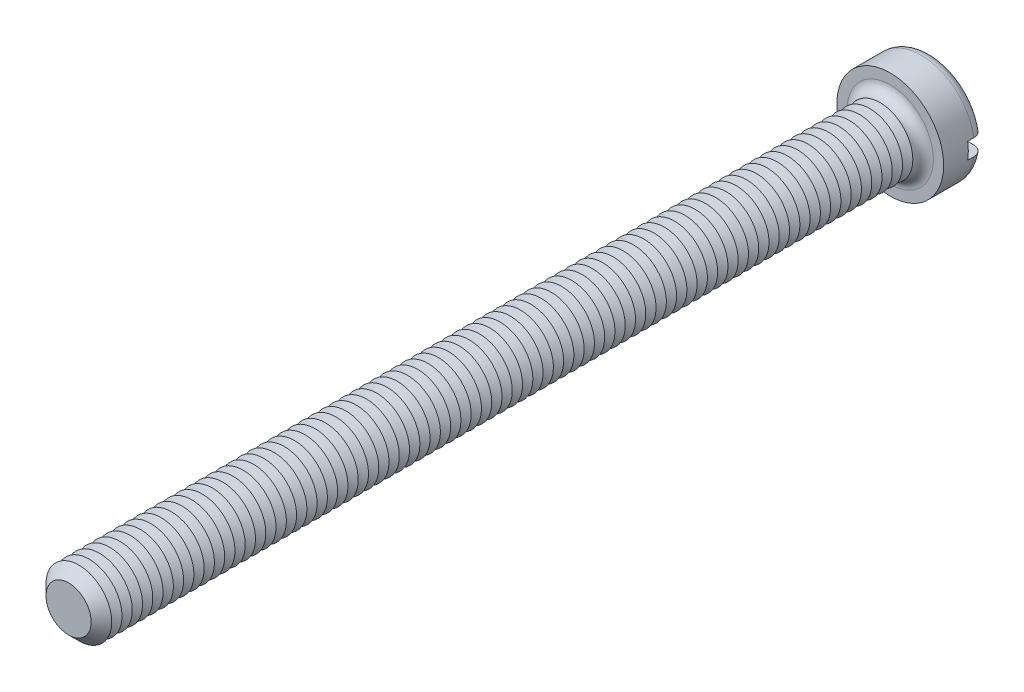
ISO-10303-21;
HEADER;
FILE_DESCRIPTION(('STEP AP214'),'2;1');
FILE_NAME('part.step','',(''),(''),'','','');
FILE_SCHEMA(('AUTOMOTIVE_DESIGN { 1 0 10303 214 1 1 1 1 }'));
ENDSEC;
DATA;
#1=APPLICATION_CONTEXT('core data for automotive mechanical design processes');
#2=APPLICATION_PROTOCOL_DEFINITION('international standard','automotive_design',2000,#1);
#3=PRODUCT_CONTEXT('',#1,'mechanical');
#4=PRODUCT('Part','Part','',(#3));
#5=PRODUCT_RELATED_PRODUCT_CATEGORY('part','',(#4));
#6=PRODUCT_DEFINITION_FORMATION('','',#4);
#7=PRODUCT_DEFINITION_CONTEXT('part definition',#1,'design');
#8=PRODUCT_DEFINITION('design','',#6,#7);
#9=PRODUCT_DEFINITION_SHAPE('','',#8);
#10=(LENGTH_UNIT() NAMED_UNIT(*) SI_UNIT(.MILLI.,.METRE.));
#11=(NAMED_UNIT(*) PLANE_ANGLE_UNIT() SI_UNIT($,.RADIAN.));
#12=(NAMED_UNIT(*) SI_UNIT($,.STERADIAN.) SOLID_ANGLE_UNIT());
#13=UNCERTAINTY_MEASURE_WITH_UNIT(LENGTH_MEASURE(1.E-05),#10,'distance_accuracy_value','');
#14=(GEOMETRIC_REPRESENTATION_CONTEXT(3) GLOBAL_UNCERTAINTY_ASSIGNED_CONTEXT((#13)) GLOBAL_UNIT_ASSIGNED_CONTEXT((#10,
#11,#12)) REPRESENTATION_CONTEXT('',''));
#15=CARTESIAN_POINT('',(0.,0.,0.));
#16=DIRECTION('',(0.,0.,1.));
#17=DIRECTION('',(1.,0.,0.));
#18=AXIS2_PLACEMENT_3D('',#15,#16,#17);
#19=CARTESIAN_POINT('',(0.,0.,-5.));
#20=DIRECTION('',(0.,0.,1.));
#21=DIRECTION('',(1.,0.,0.));
#22=AXIS2_PLACEMENT_3D('',#19,#20,#21);
#23=PLANE('',#22);
#24=CARTESIAN_POINT('',(0.,0.,-5.));
#25=DIRECTION('',(0.,0.,1.));
#26=DIRECTION('',(1.,0.,0.));
#27=AXIS2_PLACEMENT_3D('',#24,#25,#26);
#28=CIRCLE('',#27,5.25);
#29=CARTESIAN_POINT('',(-5.15388203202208,1.,-5.));
#30=VERTEX_POINT('',#29);
#31=CARTESIAN_POINT('',(5.15388203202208,1.,-5.));
#32=VERTEX_POINT('',#31);
#33=EDGE_CURVE('E116',#30,#32,#28,.F.);
#34=ORIENTED_EDGE('',*,*,#33,.T.);
#35=DIRECTION('',(1.,0.,0.));
#36=VECTOR('',#35,1.);
#37=CARTESIAN_POINT('',(-6.5,1.,-5.));
#38=LINE('',#37,#36);
#39=EDGE_CURVE('E111',#30,#32,#38,.T.);
#40=ORIENTED_EDGE('',*,*,#39,.F.);
#41=EDGE_LOOP('',(#34,#40));
#42=FACE_BOUND('',#41,.T.);
#43=ADVANCED_FACE('F39',(#42),#23,.F.);
#44=CARTESIAN_POINT('',(0.,0.,-3.75));
#45=DIRECTION('',(0.,0.,1.));
#46=DIRECTION('',(1.,0.,0.));
#47=AXIS2_PLACEMENT_3D('',#44,#45,#46);
#48=TOROIDAL_SURFACE('',#47,5.25,1.25);
#49=CARTESIAN_POINT('',(-6.04655789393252,1.,-4.63904490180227));
#50=CARTESIAN_POINT('',(-5.99546860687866,1.,-4.68885774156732));
#51=CARTESIAN_POINT('',(-5.94008472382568,1.,-4.73434760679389));
#52=CARTESIAN_POINT('',(-5.8223927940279,1.,-4.81538052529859));
#53=CARTESIAN_POINT('',(-5.7600753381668,1.,-4.85090982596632));
#54=CARTESIAN_POINT('',(-5.63044351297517,1.,-4.91100606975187));
#55=CARTESIAN_POINT('',(-5.56313479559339,1.,-4.93558519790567));
#56=CARTESIAN_POINT('',(-5.42539577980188,1.,-4.97322457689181));
#57=CARTESIAN_POINT('',(-5.35496625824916,1.,-4.98628767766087));
#58=CARTESIAN_POINT('',(-5.21212635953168,1.,-5.00070478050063));
#59=CARTESIAN_POINT('',(-5.13970265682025,1.,-5.00192674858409));
#60=CARTESIAN_POINT('',(-4.99565121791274,1.,-4.99234085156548));
#61=CARTESIAN_POINT('',(-4.92402357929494,1.,-4.98153152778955));
#62=CARTESIAN_POINT('',(-4.78274786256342,1.,-4.94801424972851));
#63=CARTESIAN_POINT('',(-4.71313137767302,1.,-4.92517296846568));
#64=CARTESIAN_POINT('',(-4.57871041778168,1.,-4.86813760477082));
#65=CARTESIAN_POINT('',(-4.51390612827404,1.,-4.83394308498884));
#66=CARTESIAN_POINT('',(-4.39095493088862,1.,-4.75508341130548));
#67=CARTESIAN_POINT('',(-4.33281197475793,1.,-4.7104120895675));
#68=CARTESIAN_POINT('',(-4.22499800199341,1.,-4.61179869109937));
#69=CARTESIAN_POINT('',(-4.17532640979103,1.,-4.55785724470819));
#70=CARTESIAN_POINT('',(-4.08677450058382,1.,-4.4431082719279));
#71=CARTESIAN_POINT('',(-4.0477350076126,1.,-4.38242369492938));
#72=CARTESIAN_POINT('',(-3.98074296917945,1.,-4.25521412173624));
#73=CARTESIAN_POINT('',(-3.95278836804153,1.,-4.18869021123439));
#74=CARTESIAN_POINT('',(-3.90959497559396,1.,-4.0537026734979));
#75=CARTESIAN_POINT('',(-3.89401985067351,1.,-3.98534663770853));
#76=CARTESIAN_POINT('',(-3.8748586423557,1.,-3.84697740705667));
#77=CARTESIAN_POINT('',(-3.87127067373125,1.,-3.7769644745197));
#78=CARTESIAN_POINT('',(-3.8761573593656,1.,-3.63892215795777));
#79=CARTESIAN_POINT('',(-3.88436651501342,1.,-3.57088319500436));
#80=CARTESIAN_POINT('',(-3.91207743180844,1.,-3.43714958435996));
#81=CARTESIAN_POINT('',(-3.93157911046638,1.,-3.37145491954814));
#82=CARTESIAN_POINT('',(-3.98125045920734,1.,-3.24411474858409));
#83=CARTESIAN_POINT('',(-4.01143761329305,1.,-3.18247607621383));
#84=CARTESIAN_POINT('',(-4.08150210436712,1.,-3.064981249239));
#85=CARTESIAN_POINT('',(-4.12138048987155,1.,-3.0091257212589));
#86=CARTESIAN_POINT('',(-4.2106718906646,1.,-2.90336353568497));
#87=CARTESIAN_POINT('',(-4.26028693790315,1.,-2.85362751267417));
#88=CARTESIAN_POINT('',(-4.36696587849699,1.,-2.76291710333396));
#89=CARTESIAN_POINT('',(-4.42403082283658,1.,-2.72194395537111));
#90=CARTESIAN_POINT('',(-4.54567957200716,1.,-2.64877280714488));
#91=CARTESIAN_POINT('',(-4.61042643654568,1.,-2.61684571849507));
#92=CARTESIAN_POINT('',(-4.74430563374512,1.,-2.56412359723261));
#93=CARTESIAN_POINT('',(-4.81343838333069,1.,-2.54332962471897));
#94=CARTESIAN_POINT('',(-4.95527237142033,1.,-2.51320471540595));
#95=CARTESIAN_POINT('',(-5.0280120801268,1.,-2.50405449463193));
#96=CARTESIAN_POINT('',(-5.17399775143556,1.,-2.49810126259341));
#97=CARTESIAN_POINT('',(-5.24724372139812,1.,-2.50129843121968));
#98=CARTESIAN_POINT('',(-5.3921014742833,1.,-2.52000776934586));
#99=CARTESIAN_POINT('',(-5.4637142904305,1.,-2.53551191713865));
#100=CARTESIAN_POINT('',(-5.60326680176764,1.,-2.57846304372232));
#101=CARTESIAN_POINT('',(-5.67120668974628,1.,-2.60590939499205));
#102=CARTESIAN_POINT('',(-5.80064060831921,1.,-2.67164926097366));
#103=CARTESIAN_POINT('',(-5.862199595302,1.,-2.7098148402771));
#104=CARTESIAN_POINT('',(-5.9779079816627,1.,-2.79608690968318));
#105=CARTESIAN_POINT('',(-6.03205795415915,1.,-2.84419263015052));
#106=CARTESIAN_POINT('',(-6.13055119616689,1.,-2.94820522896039));
#107=CARTESIAN_POINT('',(-6.17502887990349,1.,-3.00398483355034));
#108=CARTESIAN_POINT('',(-6.25384180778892,1.,-3.12230113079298));
#109=CARTESIAN_POINT('',(-6.28817779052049,1.,-3.18483733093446));
#110=CARTESIAN_POINT('',(-6.34527986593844,1.,-3.31401726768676));
#111=CARTESIAN_POINT('',(-6.36818984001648,1.,-3.38059742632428));
#112=CARTESIAN_POINT('',(-6.40240470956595,1.,-3.5166725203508));
#113=CARTESIAN_POINT('',(-6.41371067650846,1.,-3.58616718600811));
#114=CARTESIAN_POINT('',(-6.42433240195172,1.,-3.72550026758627));
#115=CARTESIAN_POINT('',(-6.4237441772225,1.,-3.79533138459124));
#116=CARTESIAN_POINT('',(-6.41082814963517,1.,-3.93391789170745));
#117=CARTESIAN_POINT('',(-6.39849757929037,1.,-4.00267302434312));
#118=CARTESIAN_POINT('',(-6.36249191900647,1.,-4.13704597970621));
#119=CARTESIAN_POINT('',(-6.33883072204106,1.,-4.20266753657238));
#120=CARTESIAN_POINT('',(-6.28088769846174,1.,-4.32897165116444));
#121=CARTESIAN_POINT('',(-6.24661890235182,1.,-4.38966015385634));
#122=CARTESIAN_POINT('',(-6.18404039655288,1.,-4.48163773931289));
#123=CARTESIAN_POINT('',(-6.15876600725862,1.,-4.51503333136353));
#124=CARTESIAN_POINT('',(-6.10500607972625,1.,-4.5791298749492));
#125=CARTESIAN_POINT('',(-6.07652056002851,1.,-4.60983084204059));
#126=CARTESIAN_POINT('',(-6.04655789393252,1.,-4.63904490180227));
#127=B_SPLINE_CURVE_WITH_KNOTS('',3,(#49,#50,#51,#52,#53,#54,#55,#56,#57,#58,#59,#60,#61,#62,
#63,#64,#65,#66,#67,#68,#69,#70,#71,#72,#73,#74,#75,#76,#77,#78,#79,#80,#81,#82,#83,#84,#85,#86,
#87,#88,#89,#90,#91,#92,#93,#94,#95,#96,#97,#98,#99,#100,#101,#102,#103,#104,#105,#106,#107,
#108,#109,#110,#111,#112,#113,#114,#115,#116,#117,#118,#119,#120,#121,#122,#123,#124,#125,#126),
.UNSPECIFIED.,.T.,.F.,(4,2,2,2,2,2,2,2,2,2,2,2,2,2,2,2,2,2,2,2,2,2,2,2,2,2,2,2,2,2,2,2,2,2,2,2,
2,2,4),(0.,0.213907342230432,0.428108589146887,0.642070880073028,0.855980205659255,
1.07227200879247,1.28859003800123,1.50735715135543,1.72613269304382,1.94503735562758,
2.16392713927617,2.37933295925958,2.59469881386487,2.80399176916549,3.01325180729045,
3.2178754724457,3.42249764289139,3.62745618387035,3.83243690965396,4.04223444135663,
4.25206160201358,4.46763253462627,4.68322399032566,4.90212226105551,5.12102372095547,
5.33978261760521,5.55853002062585,5.77477015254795,5.99099354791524,6.20398686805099,
6.41696467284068,6.62718821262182,6.83739233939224,7.0459002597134,7.25445733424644,
7.46275934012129,7.67080647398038,7.79625882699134,7.92171045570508),.UNSPECIFIED.);
#128=CARTESIAN_POINT('',(-6.42261628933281,1.,-3.74999999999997));
#129=VERTEX_POINT('',#128);
#130=EDGE_CURVE('E803',#129,#30,#127,.T.);
#131=ORIENTED_EDGE('',*,*,#130,.F.);
#132=CARTESIAN_POINT('',(0.,0.,-3.75));
#133=DIRECTION('',(0.,0.,1.));
#134=DIRECTION('',(1.,0.,0.));
#135=AXIS2_PLACEMENT_3D('',#132,#133,#134);
#136=CIRCLE('',#135,6.5);
#137=CARTESIAN_POINT('',(6.42261628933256,1.,-3.75));
#138=VERTEX_POINT('',#137);
#139=EDGE_CURVE('E125',#138,#129,#136,.T.);
#140=ORIENTED_EDGE('',*,*,#139,.F.);
#141=CARTESIAN_POINT('',(4.06944999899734,1.,-4.4133199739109));
#142=CARTESIAN_POINT('',(4.10828271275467,1.,-4.47354709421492));
#143=CARTESIAN_POINT('',(4.15233880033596,1.,-4.53047894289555));
#144=CARTESIAN_POINT('',(4.24946916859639,1.,-4.63614530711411));
#145=CARTESIAN_POINT('',(4.3025574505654,1.,-4.68486685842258));
#146=CARTESIAN_POINT('',(4.41603250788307,1.,-4.77271114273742));
#147=CARTESIAN_POINT('',(4.47640839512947,1.,-4.8118479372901));
#148=CARTESIAN_POINT('',(4.60277035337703,1.,-4.87959878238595));
#149=CARTESIAN_POINT('',(4.66875480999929,1.,-4.90821584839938));
#150=CARTESIAN_POINT('',(4.80558589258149,1.,-4.95456537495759));
#151=CARTESIAN_POINT('',(4.87649196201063,1.,-4.97212253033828));
#152=CARTESIAN_POINT('',(5.02024710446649,1.,-4.99514979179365));
#153=CARTESIAN_POINT('',(5.09309636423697,1.,-5.00061873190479));
#154=CARTESIAN_POINT('',(5.23902872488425,1.,-4.99926689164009));
#155=CARTESIAN_POINT('',(5.31211131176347,1.,-4.99238812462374));
#156=CARTESIAN_POINT('',(5.45605806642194,1.,-4.96635140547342));
#157=CARTESIAN_POINT('',(5.52692231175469,1.,-4.94719388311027));
#158=CARTESIAN_POINT('',(5.66376170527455,1.,-4.89728421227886));
#159=CARTESIAN_POINT('',(5.72977335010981,1.,-4.86663219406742));
#160=CARTESIAN_POINT('',(5.85560715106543,1.,-4.79452334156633));
#161=CARTESIAN_POINT('',(5.91542977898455,1.,-4.7530673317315));
#162=CARTESIAN_POINT('',(6.02626022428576,1.,-4.66116821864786));
#163=CARTESIAN_POINT('',(6.07738307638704,1.,-4.6108638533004));
#164=CARTESIAN_POINT('',(6.17030947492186,1.,-4.50227823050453));
#165=CARTESIAN_POINT('',(6.2121137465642,1.,-4.44399759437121));
#166=CARTESIAN_POINT('',(6.28460268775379,1.,-4.32200305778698));
#167=CARTESIAN_POINT('',(6.31543589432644,1.,-4.2583773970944));
#168=CARTESIAN_POINT('',(6.36586009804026,1.,-4.12681721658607));
#169=CARTESIAN_POINT('',(6.38545178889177,1.,-4.0588829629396));
#170=CARTESIAN_POINT('',(6.41265760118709,1.,-3.92136007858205));
#171=CARTESIAN_POINT('',(6.42038873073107,1.,-3.85179457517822));
#172=CARTESIAN_POINT('',(6.42401070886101,1.,-3.7123569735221));
#173=CARTESIAN_POINT('',(6.41990193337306,1.,-3.64248488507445));
#174=CARTESIAN_POINT('',(6.40000894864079,1.,-3.50470871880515));
#175=CARTESIAN_POINT('',(6.38427119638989,1.,-3.43679792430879));
#176=CARTESIAN_POINT('',(6.34164491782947,1.,-3.30457296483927));
#177=CARTESIAN_POINT('',(6.31475638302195,1.,-3.24025880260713));
#178=CARTESIAN_POINT('',(6.2505455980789,1.,-3.11686791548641));
#179=CARTESIAN_POINT('',(6.21319759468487,1.,-3.05780459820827));
#180=CARTESIAN_POINT('',(6.12919411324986,1.,-2.94671919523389));
#181=CARTESIAN_POINT('',(6.08253833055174,1.,-2.89469734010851));
#182=CARTESIAN_POINT('',(5.98083387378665,1.,-2.79868150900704));
#183=CARTESIAN_POINT('',(5.92571704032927,1.,-2.75475975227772));
#184=CARTESIAN_POINT('',(5.80897194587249,1.,-2.67665277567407));
#185=CARTESIAN_POINT('',(5.74734329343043,1.,-2.64246814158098));
#186=CARTESIAN_POINT('',(5.6184644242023,1.,-2.58431810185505));
#187=CARTESIAN_POINT('',(5.55115102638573,1.,-2.56049275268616));
#188=CARTESIAN_POINT('',(5.41351272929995,1.,-2.52429868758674));
#189=CARTESIAN_POINT('',(5.34318759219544,1.,-2.51193087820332));
#190=CARTESIAN_POINT('',(5.20041507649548,1.,-2.49882112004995));
#191=CARTESIAN_POINT('',(5.12795169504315,1.,-2.49825332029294));
#192=CARTESIAN_POINT('',(4.98393373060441,1.,-2.50914771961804));
#193=CARTESIAN_POINT('',(4.91237921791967,1.,-2.52061084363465));
#194=CARTESIAN_POINT('',(4.77137358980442,1.,-2.55542281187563));
#195=CARTESIAN_POINT('',(4.70195472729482,1.,-2.57890245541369));
#196=CARTESIAN_POINT('',(4.56803538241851,1.,-2.63717701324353));
#197=CARTESIAN_POINT('',(4.50353509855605,1.,-2.67197238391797));
#198=CARTESIAN_POINT('',(4.38131858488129,1.,-2.7519648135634));
#199=CARTESIAN_POINT('',(4.32360365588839,1.,-2.79716386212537));
#200=CARTESIAN_POINT('',(4.21673400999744,1.,-2.89675634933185));
#201=CARTESIAN_POINT('',(4.16757871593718,1.,-2.95114916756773));
#202=CARTESIAN_POINT('',(4.08014713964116,1.,-3.06667703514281));
#203=CARTESIAN_POINT('',(4.04170608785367,1.,-3.12768727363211));
#204=CARTESIAN_POINT('',(3.97596192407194,1.,-3.25543782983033));
#205=CARTESIAN_POINT('',(3.94865624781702,1.,-3.32217682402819));
#206=CARTESIAN_POINT('',(3.9067737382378,1.,-3.45745603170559));
#207=CARTESIAN_POINT('',(3.89185707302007,1.,-3.52589108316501));
#208=CARTESIAN_POINT('',(3.87400755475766,1.,-3.66432360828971));
#209=CARTESIAN_POINT('',(3.87107601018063,1.,-3.73432125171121));
#210=CARTESIAN_POINT('',(3.8772387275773,1.,-3.87228267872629));
#211=CARTESIAN_POINT('',(3.88607933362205,1.,-3.94025811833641));
#212=CARTESIAN_POINT('',(3.91502769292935,1.,-4.07370133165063));
#213=CARTESIAN_POINT('',(3.93512131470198,1.,-4.1391721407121));
#214=CARTESIAN_POINT('',(3.9752037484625,1.,-4.23926719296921));
#215=CARTESIAN_POINT('',(3.99171171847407,1.,-4.27532618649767));
#216=CARTESIAN_POINT('',(4.02809737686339,1.,-4.34569933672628));
#217=CARTESIAN_POINT('',(4.04797497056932,1.,-4.3800135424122));
#218=CARTESIAN_POINT('',(4.06944999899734,1.,-4.4133199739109));
#219=B_SPLINE_CURVE_WITH_KNOTS('',3,(#141,#142,#143,#144,#145,#146,#147,#148,#149,#150,#151,
#152,#153,#154,#155,#156,#157,#158,#159,#160,#161,#162,#163,#164,#165,#166,#167,#168,#169,#170,
#171,#172,#173,#174,#175,#176,#177,#178,#179,#180,#181,#182,#183,#184,#185,#186,#187,#188,#189,
#190,#191,#192,#193,#194,#195,#196,#197,#198,#199,#200,#201,#202,#203,#204,#205,#206,#207,#208,
#209,#210,#211,#212,#213,#214,#215,#216,#217,#218),.UNSPECIFIED.,.T.,.F.,(4,2,2,2,2,2,2,2,2,2,2,
2,2,2,2,2,2,2,2,2,2,2,2,2,2,2,2,2,2,2,2,2,2,2,2,2,2,2,4),(0.,0.214833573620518,
0.430003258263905,0.644855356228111,0.859645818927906,1.0777603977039,1.29589601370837,
1.51505870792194,1.73421373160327,1.95150241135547,2.16877451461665,2.38290237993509,
2.59701357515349,2.8081044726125,3.01918234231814,3.22816416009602,3.43713934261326,
3.64528416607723,3.85342914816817,4.06209119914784,4.27076008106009,4.48120788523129,
4.69166834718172,4.90489186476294,5.11813225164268,5.33451752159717,5.55091942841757,
5.76972860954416,5.98854661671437,6.20740650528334,6.42625163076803,6.64151774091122,
6.85673425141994,7.0658317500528,7.27495207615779,7.47963858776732,7.68406862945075,
7.80287790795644,7.92168384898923),.UNSPECIFIED.);
#220=EDGE_CURVE('E805',#32,#138,#219,.T.);
#221=ORIENTED_EDGE('',*,*,#220,.F.);
#222=ORIENTED_EDGE('',*,*,#33,.F.);
#223=EDGE_LOOP('',(#131,#140,#221,#222));
#224=FACE_BOUND('',#223,.T.);
#225=ADVANCED_FACE('F787',(#224),#48,.T.);
#226=CARTESIAN_POINT('',(0.,0.,-5.));
#227=DIRECTION('',(0.,0.,1.));
#228=DIRECTION('',(1.,0.,0.));
#229=AXIS2_PLACEMENT_3D('',#226,#227,#228);
#230=CYLINDRICAL_SURFACE('',#229,6.5);
#231=DIRECTION('',(0.,0.,1.));
#232=VECTOR('',#231,1.);
#233=CARTESIAN_POINT('',(6.42261628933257,1.,-5.));
#234=LINE('',#233,#232);
#235=CARTESIAN_POINT('',(6.42261628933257,1.,-3.));
#236=VERTEX_POINT('',#235);
#237=EDGE_CURVE('E819',#138,#236,#234,.T.);
#238=ORIENTED_EDGE('',*,*,#237,.F.);
#239=ORIENTED_EDGE('',*,*,#139,.T.);
#240=DIRECTION('',(0.,0.,1.));
#241=VECTOR('',#240,1.);
#242=CARTESIAN_POINT('',(-6.42261628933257,1.,-5.));
#243=LINE('',#242,#241);
#244=CARTESIAN_POINT('',(-6.42261628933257,1.,-3.));
#245=VERTEX_POINT('',#244);
#246=EDGE_CURVE('E63',#245,#129,#243,.F.);
#247=ORIENTED_EDGE('',*,*,#246,.F.);
#248=CARTESIAN_POINT('',(0.,0.,-3.));
#249=DIRECTION('',(0.,0.,-1.));
#250=DIRECTION('',(-1.,0.,0.));
#251=AXIS2_PLACEMENT_3D('',#248,#249,#250);
#252=CIRCLE('',#251,6.5);
#253=CARTESIAN_POINT('',(-6.42261628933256,-0.999999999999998,-3.));
#254=VERTEX_POINT('',#253);
#255=EDGE_CURVE('E43',#245,#254,#252,.F.);
#256=ORIENTED_EDGE('',*,*,#255,.T.);
#257=DIRECTION('',(0.,0.,1.));
#258=VECTOR('',#257,1.);
#259=CARTESIAN_POINT('',(-6.42261628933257,-0.999999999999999,-5.));
#260=LINE('',#259,#258);
#261=CARTESIAN_POINT('',(-6.42261628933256,-0.999999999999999,-3.75));
#262=VERTEX_POINT('',#261);
#263=EDGE_CURVE('E816',#262,#254,#260,.T.);
#264=ORIENTED_EDGE('',*,*,#263,.F.);
#265=CARTESIAN_POINT('',(6.42261628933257,-1.,-3.75));
#266=VERTEX_POINT('',#265);
#267=EDGE_CURVE('E127',#262,#266,#136,.T.);
#268=ORIENTED_EDGE('',*,*,#267,.T.);
#269=DIRECTION('',(0.,0.,1.));
#270=VECTOR('',#269,1.);
#271=CARTESIAN_POINT('',(6.42261628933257,-1.,-5.));
#272=LINE('',#271,#270);
#273=CARTESIAN_POINT('',(6.42261628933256,-1.,-3.));
#274=VERTEX_POINT('',#273);
#275=EDGE_CURVE('E55',#274,#266,#272,.F.);
#276=ORIENTED_EDGE('',*,*,#275,.F.);
#277=EDGE_CURVE('E11',#274,#236,#252,.F.);
#278=ORIENTED_EDGE('',*,*,#277,.T.);
#279=EDGE_LOOP('',(#238,#239,#247,#256,#264,#268,#276,#278));
#280=FACE_BOUND('',#279,.T.);
#281=CARTESIAN_POINT('',(0.,0.,0.));
#282=DIRECTION('',(0.,0.,1.));
#283=DIRECTION('',(1.,0.,0.));
#284=AXIS2_PLACEMENT_3D('',#281,#282,#283);
#285=CIRCLE('',#284,6.5);
#286=CARTESIAN_POINT('',(6.5,0.,0.));
#287=VERTEX_POINT('',#286);
#288=EDGE_CURVE('E822',#287,#287,#285,.T.);
#289=ORIENTED_EDGE('',*,*,#288,.F.);
#290=EDGE_LOOP('',(#289));
#291=FACE_BOUND('',#290,.T.);
#292=ADVANCED_FACE('F783',(#280,#291),#230,.T.);
#293=CARTESIAN_POINT('',(5.15388203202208,-1.,-5.));
#294=VERTEX_POINT('',#293);
#295=CARTESIAN_POINT('',(-5.15388203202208,-0.999999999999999,-5.));
#296=VERTEX_POINT('',#295);
#297=EDGE_CURVE('E109',#294,#296,#28,.F.);
#298=ORIENTED_EDGE('',*,*,#297,.T.);
#299=DIRECTION('',(-1.,0.,0.));
#300=VECTOR('',#299,1.);
#301=CARTESIAN_POINT('',(-6.5,-0.999999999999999,-5.));
#302=LINE('',#301,#300);
#303=EDGE_CURVE('E96',#294,#296,#302,.T.);
#304=ORIENTED_EDGE('',*,*,#303,.F.);
#305=EDGE_LOOP('',(#298,#304));
#306=FACE_BOUND('',#305,.T.);
#307=ADVANCED_FACE('F108',(#306),#23,.F.);
#308=CARTESIAN_POINT('',(0.,0.,0.));
#309=DIRECTION('',(0.,0.,1.));
#310=DIRECTION('',(1.,0.,0.));
#311=AXIS2_PLACEMENT_3D('',#308,#309,#310);
#312=PLANE('',#311);
#313=CARTESIAN_POINT('',(0.,0.,0.));
#314=DIRECTION('',(0.,0.,1.));
#315=DIRECTION('',(1.,0.,0.));
#316=AXIS2_PLACEMENT_3D('',#313,#314,#315);
#317=CIRCLE('',#316,5.25);
#318=CARTESIAN_POINT('',(5.25,0.,0.));
#319=VERTEX_POINT('',#318);
#320=EDGE_CURVE('E115',#319,#319,#317,.F.);
#321=ORIENTED_EDGE('',*,*,#320,.T.);
#322=EDGE_LOOP('',(#321));
#323=FACE_BOUND('',#322,.T.);
#324=ORIENTED_EDGE('',*,*,#288,.T.);
#325=EDGE_LOOP('',(#324));
#326=FACE_BOUND('',#325,.T.);
#327=ADVANCED_FACE('F782',(#323,#326),#312,.T.);
#328=CARTESIAN_POINT('',(-6.04655789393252,-0.999999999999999,-4.63904490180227));
#329=CARTESIAN_POINT('',(-6.0966604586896,-0.999999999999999,-4.59018532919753));
#330=CARTESIAN_POINT('',(-6.14270501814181,-0.999999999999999,-4.53709744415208));
#331=CARTESIAN_POINT('',(-6.22528519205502,-0.999999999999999,-4.42391631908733));
#332=CARTESIAN_POINT('',(-6.26181074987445,-0.999999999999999,-4.36381576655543));
#333=CARTESIAN_POINT('',(-6.32422109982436,-0.999999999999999,-4.23831836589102));
#334=CARTESIAN_POINT('',(-6.35010658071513,-0.999999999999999,-4.17292186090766));
#335=CARTESIAN_POINT('',(-6.39044668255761,-0.999999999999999,-4.03870925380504));
#336=CARTESIAN_POINT('',(-6.40490396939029,-0.999999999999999,-3.96989395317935));
#337=CARTESIAN_POINT('',(-6.42190814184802,-0.999999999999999,-3.83122595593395));
#338=CARTESIAN_POINT('',(-6.4245257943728,-0.999999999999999,-3.76138193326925));
#339=CARTESIAN_POINT('',(-6.41796432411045,-0.999999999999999,-3.62224935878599));
#340=CARTESIAN_POINT('',(-6.40878509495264,-0.999999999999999,-3.55296081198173));
#341=CARTESIAN_POINT('',(-6.37894560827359,-0.999999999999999,-3.41709241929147));
#342=CARTESIAN_POINT('',(-6.35831520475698,-0.999999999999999,-3.35050601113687));
#343=CARTESIAN_POINT('',(-6.30620980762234,-0.999999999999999,-3.22172312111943));
#344=CARTESIAN_POINT('',(-6.2747347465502,-0.999999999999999,-3.15952666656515));
#345=CARTESIAN_POINT('',(-6.20172710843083,-0.999999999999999,-3.04101762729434));
#346=CARTESIAN_POINT('',(-6.16015622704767,-0.999999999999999,-2.98472864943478));
#347=CARTESIAN_POINT('',(-6.06823774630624,-0.999999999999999,-2.87984578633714));
#348=CARTESIAN_POINT('',(-6.01788981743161,-0.999999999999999,-2.83125219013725));
#349=CARTESIAN_POINT('',(-5.90933830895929,-0.999999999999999,-2.74262118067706));
#350=CARTESIAN_POINT('',(-5.85106338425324,-0.999999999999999,-2.70267117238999));
#351=CARTESIAN_POINT('',(-5.72870702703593,-0.999999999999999,-2.63296796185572));
#352=CARTESIAN_POINT('',(-5.66462521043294,-0.999999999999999,-2.6032154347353));
#353=CARTESIAN_POINT('',(-5.53153273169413,-0.999999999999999,-2.55430842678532));
#354=CARTESIAN_POINT('',(-5.46246626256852,-0.999999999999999,-2.53530583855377));
#355=CARTESIAN_POINT('',(-5.32214267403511,-0.999999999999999,-2.5089831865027));
#356=CARTESIAN_POINT('',(-5.25088537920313,-0.999999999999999,-2.50166406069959));
#357=CARTESIAN_POINT('',(-5.10710123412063,-0.999999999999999,-2.49882202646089));
#358=CARTESIAN_POINT('',(-5.03457095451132,-0.999999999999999,-2.50347166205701));
#359=CARTESIAN_POINT('',(-4.8912897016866,-0.999999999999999,-2.52476029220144));
#360=CARTESIAN_POINT('',(-4.82053886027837,-0.999999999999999,-2.54140017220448));
#361=CARTESIAN_POINT('',(-4.68213257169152,-0.999999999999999,-2.58641614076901));
#362=CARTESIAN_POINT('',(-4.61451256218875,-0.999999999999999,-2.61490131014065));
#363=CARTESIAN_POINT('',(-4.48502801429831,-0.999999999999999,-2.68285095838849));
#364=CARTESIAN_POINT('',(-4.42316359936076,-0.999999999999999,-2.72231567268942));
#365=CARTESIAN_POINT('',(-4.30720694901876,-0.999999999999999,-2.81103994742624));
#366=CARTESIAN_POINT('',(-4.25309118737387,-0.999999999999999,-2.86026872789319));
#367=CARTESIAN_POINT('',(-4.15409408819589,-0.999999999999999,-2.9672764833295));
#368=CARTESIAN_POINT('',(-4.10921182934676,-0.999999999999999,-3.02505460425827));
#369=CARTESIAN_POINT('',(-4.03096584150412,-0.999999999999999,-3.14632492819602));
#370=CARTESIAN_POINT('',(-3.99739097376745,-0.999999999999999,-3.2096807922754));
#371=CARTESIAN_POINT('',(-3.94171839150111,-0.999999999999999,-3.34124912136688));
#372=CARTESIAN_POINT('',(-3.91961840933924,-0.999999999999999,-3.40946062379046));
#373=CARTESIAN_POINT('',(-3.88816636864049,-0.999999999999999,-3.54669256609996));
#374=CARTESIAN_POINT('',(-3.87846562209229,-0.999999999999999,-3.61563318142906));
#375=CARTESIAN_POINT('',(-3.87100568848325,-0.999999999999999,-3.75415397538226));
#376=CARTESIAN_POINT('',(-3.87324501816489,-0.999999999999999,-3.82373407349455));
#377=CARTESIAN_POINT('',(-3.88943589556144,-0.999999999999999,-3.96027701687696));
#378=CARTESIAN_POINT('',(-3.90318225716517,-0.999999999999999,-4.0272643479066));
#379=CARTESIAN_POINT('',(-3.94163954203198,-0.999999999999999,-4.1580093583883));
#380=CARTESIAN_POINT('',(-3.96635075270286,-0.999999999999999,-4.22176695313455));
#381=CARTESIAN_POINT('',(-4.026160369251,-0.999999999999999,-4.34483320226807));
#382=CARTESIAN_POINT('',(-4.06134035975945,-0.999999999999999,-4.40410214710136));
#383=CARTESIAN_POINT('',(-4.14090865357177,-0.999999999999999,-4.51609417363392));
#384=CARTESIAN_POINT('',(-4.18529811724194,-0.999999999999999,-4.56881642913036));
#385=CARTESIAN_POINT('',(-4.2832649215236,-0.999999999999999,-4.66770177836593));
#386=CARTESIAN_POINT('',(-4.33705327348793,-0.999999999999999,-4.71365579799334));
#387=CARTESIAN_POINT('',(-4.45141776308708,-0.999999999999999,-4.79615385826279));
#388=CARTESIAN_POINT('',(-4.51199483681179,-0.999999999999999,-4.83269659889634));
#389=CARTESIAN_POINT('',(-4.63989216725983,-0.999999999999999,-4.89626962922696));
#390=CARTESIAN_POINT('',(-4.70734508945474,-0.999999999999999,-4.92303326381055));
#391=CARTESIAN_POINT('',(-4.84575497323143,-0.999999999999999,-4.96500199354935));
#392=CARTESIAN_POINT('',(-4.91671207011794,-0.999999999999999,-4.98020664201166));
#393=CARTESIAN_POINT('',(-5.06097761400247,-0.999999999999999,-4.9987306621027));
#394=CARTESIAN_POINT('',(-5.13430353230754,-0.999999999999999,-5.00191441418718));
#395=CARTESIAN_POINT('',(-5.28046546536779,-0.999999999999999,-4.99587686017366));
#396=CARTESIAN_POINT('',(-5.35330135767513,-0.999999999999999,-4.98665256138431));
#397=CARTESIAN_POINT('',(-5.49610354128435,-0.999999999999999,-4.95604184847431));
#398=CARTESIAN_POINT('',(-5.56607890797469,-0.999999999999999,-4.93469772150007));
#399=CARTESIAN_POINT('',(-5.70131538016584,-0.999999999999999,-4.88041956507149));
#400=CARTESIAN_POINT('',(-5.76658233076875,-0.999999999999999,-4.84750021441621));
#401=CARTESIAN_POINT('',(-5.86782577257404,-0.999999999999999,-4.78498748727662));
#402=CARTESIAN_POINT('',(-5.90579749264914,-0.999999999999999,-4.75856648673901));
#403=CARTESIAN_POINT('',(-5.97862186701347,-0.999999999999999,-4.70172646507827));
#404=CARTESIAN_POINT('',(-6.0134745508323,-0.999999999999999,-4.6713074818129));
#405=CARTESIAN_POINT('',(-6.04655789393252,-0.999999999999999,-4.63904490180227));
#406=B_SPLINE_CURVE_WITH_KNOTS('',3,(#328,#329,#330,#331,#332,#333,#334,#335,#336,#337,#338,
#339,#340,#341,#342,#343,#344,#345,#346,#347,#348,#349,#350,#351,#352,#353,#354,#355,#356,#357,
#358,#359,#360,#361,#362,#363,#364,#365,#366,#367,#368,#369,#370,#371,#372,#373,#374,#375,#376,
#377,#378,#379,#380,#381,#382,#383,#384,#385,#386,#387,#388,#389,#390,#391,#392,#393,#394,#395,
#396,#397,#398,#399,#400,#401,#402,#403,#404,#405),.UNSPECIFIED.,.T.,.F.,(4,2,2,2,2,2,2,2,2,2,2,
2,2,2,2,2,2,2,2,2,2,2,2,2,2,2,2,2,2,2,2,2,2,2,2,2,2,2,4),(0.,0.209780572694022,
0.419781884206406,0.629769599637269,0.839708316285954,1.04839053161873,1.2570746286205,
1.46521720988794,1.67336108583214,1.88230736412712,2.09126148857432,2.30223890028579,
2.51323027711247,2.72713284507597,2.94105258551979,3.15807345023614,3.37511034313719,
3.59419176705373,3.81327788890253,4.03168404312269,4.25006839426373,4.46411376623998,
4.67811682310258,4.88595885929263,5.09377507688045,5.29796268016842,5.50215563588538,
5.70798353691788,5.91383738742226,6.12510741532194,6.33640661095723,6.55309998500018,
6.76980173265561,6.98894112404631,7.20813337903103,7.42656551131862,7.64472163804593,
7.78324365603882,7.92176436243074),.UNSPECIFIED.);
#407=EDGE_CURVE('E103',#296,#262,#406,.T.);
#408=ORIENTED_EDGE('',*,*,#407,.F.);
#409=ORIENTED_EDGE('',*,*,#297,.F.);
#410=CARTESIAN_POINT('',(4.06944999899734,-1.,-4.4133199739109));
#411=CARTESIAN_POINT('',(4.03213207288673,-1.,-4.3554312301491));
#412=CARTESIAN_POINT('',(3.9995849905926,-1.,-4.29441722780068));
#413=CARTESIAN_POINT('',(3.94511822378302,-1.,-4.16776604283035));
#414=CARTESIAN_POINT('',(3.92320762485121,-1.,-4.10212496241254));
#415=CARTESIAN_POINT('',(3.89078811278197,-1.,-3.96804412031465));
#416=CARTESIAN_POINT('',(3.88028409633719,-1.,-3.89960316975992));
#417=CARTESIAN_POINT('',(3.87107895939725,-1.,-3.76194650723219));
#418=CARTESIAN_POINT('',(3.87237511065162,-1.,-3.69273097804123));
#419=CARTESIAN_POINT('',(3.88662927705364,-1.,-3.55634460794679));
#420=CARTESIAN_POINT('',(3.89944923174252,-1.,-3.48915926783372));
#421=CARTESIAN_POINT('',(3.93611188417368,-1.,-3.35786953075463));
#422=CARTESIAN_POINT('',(3.95995518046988,-1.,-3.29376530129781));
#423=CARTESIAN_POINT('',(4.0180748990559,-1.,-3.16993562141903));
#424=CARTESIAN_POINT('',(4.05242297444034,-1.,-3.11024385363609));
#425=CARTESIAN_POINT('',(4.13041121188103,-1.,-2.9972793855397));
#426=CARTESIAN_POINT('',(4.17405248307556,-1.,-2.94400745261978));
#427=CARTESIAN_POINT('',(4.27058636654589,-1.,-2.8439150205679));
#428=CARTESIAN_POINT('',(4.32368948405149,-1.,-2.79729757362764));
#429=CARTESIAN_POINT('',(4.43679856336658,-1.,-2.71336600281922));
#430=CARTESIAN_POINT('',(4.49680546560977,-1.,-2.67605314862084));
#431=CARTESIAN_POINT('',(4.62370121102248,-1.,-2.61081752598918));
#432=CARTESIAN_POINT('',(4.69072799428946,-1.,-2.58316284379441));
#433=CARTESIAN_POINT('',(4.82843981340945,-1.,-2.5393441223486));
#434=CARTESIAN_POINT('',(4.899125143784,-1.,-2.52318100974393));
#435=CARTESIAN_POINT('',(5.04306377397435,-1.,-2.50267755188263));
#436=CARTESIAN_POINT('',(5.11633773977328,-1.,-2.49848181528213));
#437=CARTESIAN_POINT('',(5.26254809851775,-1.,-2.50249357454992));
#438=CARTESIAN_POINT('',(5.33548449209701,-1.,-2.51070104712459));
#439=CARTESIAN_POINT('',(5.4786703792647,-1.,-2.53930888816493));
#440=CARTESIAN_POINT('',(5.54892819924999,-1.,-2.5596675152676));
#441=CARTESIAN_POINT('',(5.68495799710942,-1.,-2.61204238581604));
#442=CARTESIAN_POINT('',(5.75073024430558,-1.,-2.64405792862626));
#443=CARTESIAN_POINT('',(5.8750178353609,-1.,-2.7184150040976));
#444=CARTESIAN_POINT('',(5.93361487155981,-1.,-2.76061995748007));
#445=CARTESIAN_POINT('',(6.04275377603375,-1.,-2.85440601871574));
#446=CARTESIAN_POINT('',(6.09329629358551,-1.,-2.90598637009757));
#447=CARTESIAN_POINT('',(6.18409572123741,-1.,-3.01622977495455));
#448=CARTESIAN_POINT('',(6.2244945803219,-1.,-3.07477592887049));
#449=CARTESIAN_POINT('',(6.29474798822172,-1.,-3.19788594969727));
#450=CARTESIAN_POINT('',(6.3246032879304,-1.,-3.26244938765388));
#451=CARTESIAN_POINT('',(6.37256001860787,-1.,-3.39491634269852));
#452=CARTESIAN_POINT('',(6.39079949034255,-1.,-3.46276990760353));
#453=CARTESIAN_POINT('',(6.41554133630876,-1.,-3.60058363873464));
#454=CARTESIAN_POINT('',(6.42204424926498,-1.,-3.67054370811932));
#455=CARTESIAN_POINT('',(6.42311237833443,-1.,-3.81007982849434));
#456=CARTESIAN_POINT('',(6.41775799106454,-1.,-3.879655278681));
#457=CARTESIAN_POINT('',(6.39543799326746,-1.,-4.01691664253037));
#458=CARTESIAN_POINT('',(6.3784725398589,-1.,-4.08460258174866));
#459=CARTESIAN_POINT('',(6.33344768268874,-1.,-4.21614537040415));
#460=CARTESIAN_POINT('',(6.30539273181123,-1.,-4.28000374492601));
#461=CARTESIAN_POINT('',(6.23902076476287,-1.,-4.40214140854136));
#462=CARTESIAN_POINT('',(6.20070356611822,-1.,-4.46042059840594));
#463=CARTESIAN_POINT('',(6.11467174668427,-1.,-4.5701315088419));
#464=CARTESIAN_POINT('',(6.06690270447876,-1.,-4.62152053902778));
#465=CARTESIAN_POINT('',(5.96350111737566,-1.,-4.715657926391));
#466=CARTESIAN_POINT('',(5.90786817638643,-1.,-4.75840584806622));
#467=CARTESIAN_POINT('',(5.78965380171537,-1.,-4.8345781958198));
#468=CARTESIAN_POINT('',(5.72700078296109,-1.,-4.86789149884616));
#469=CARTESIAN_POINT('',(5.59704977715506,-1.,-4.92369754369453));
#470=CARTESIAN_POINT('',(5.52975144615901,-1.,-4.94618948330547));
#471=CARTESIAN_POINT('',(5.39137621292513,-1.,-4.98006173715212));
#472=CARTESIAN_POINT('',(5.32025859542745,-1.,-4.99127571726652));
#473=CARTESIAN_POINT('',(5.17715081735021,-1.,-5.00177798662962));
#474=CARTESIAN_POINT('',(5.10516061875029,-1.,-5.00106575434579));
#475=CARTESIAN_POINT('',(4.96131924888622,-1.,-4.98769775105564));
#476=CARTESIAN_POINT('',(4.88948297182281,-1.,-4.97488146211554));
#477=CARTESIAN_POINT('',(4.74893184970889,-1.,-4.93744335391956));
#478=CARTESIAN_POINT('',(4.68021795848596,-1.,-4.91281795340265));
#479=CARTESIAN_POINT('',(4.54744428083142,-1.,-4.8522329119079));
#480=CARTESIAN_POINT('',(4.48341761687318,-1.,-4.81620070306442));
#481=CARTESIAN_POINT('',(4.36244497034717,-1.,-4.73383277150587));
#482=CARTESIAN_POINT('',(4.30549069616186,-1.,-4.68750929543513));
#483=CARTESIAN_POINT('',(4.21823158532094,-1.,-4.60311228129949));
#484=CARTESIAN_POINT('',(4.18544074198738,-1.,-4.56757118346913));
#485=CARTESIAN_POINT('',(4.12413461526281,-1.,-4.49297229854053));
#486=CARTESIAN_POINT('',(4.09561926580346,-1.,-4.45391456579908));
#487=CARTESIAN_POINT('',(4.06944999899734,-1.,-4.4133199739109));
#488=B_SPLINE_CURVE_WITH_KNOTS('',3,(#410,#411,#412,#413,#414,#415,#416,#417,#418,#419,#420,
#421,#422,#423,#424,#425,#426,#427,#428,#429,#430,#431,#432,#433,#434,#435,#436,#437,#438,#439,
#440,#441,#442,#443,#444,#445,#446,#447,#448,#449,#450,#451,#452,#453,#454,#455,#456,#457,#458,
#459,#460,#461,#462,#463,#464,#465,#466,#467,#468,#469,#470,#471,#472,#473,#474,#475,#476,#477,
#478,#479,#480,#481,#482,#483,#484,#485,#486,#487),.UNSPECIFIED.,.T.,.F.,(4,2,2,2,2,2,2,2,2,2,2,
2,2,2,2,2,2,2,2,2,2,2,2,2,2,2,2,2,2,2,2,2,2,2,2,2,2,2,4),(0.,0.206453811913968,0.4130836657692,
0.619802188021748,0.826472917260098,1.03070015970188,1.23493849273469,1.44060223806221,
1.64629054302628,1.85731119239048,2.06836062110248,2.28487349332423,2.5014038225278,
2.72053974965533,2.9396752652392,3.15806230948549,3.37643622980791,3.59203140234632,
3.80760918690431,4.01997696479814,4.23232961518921,4.44210913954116,4.65187903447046,
4.86023097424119,5.06858009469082,5.27684563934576,5.48511488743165,5.69462015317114,
5.90413597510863,6.11602561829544,6.32793096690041,6.54291770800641,6.75791385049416,
6.97580180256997,7.19375587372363,7.41312537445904,7.63223520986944,7.77701357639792,
7.92178970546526),.UNSPECIFIED.);
#489=EDGE_CURVE('E92',#266,#294,#488,.T.);
#490=ORIENTED_EDGE('',*,*,#489,.F.);
#491=ORIENTED_EDGE('',*,*,#267,.F.);
#492=EDGE_LOOP('',(#408,#409,#490,#491));
#493=FACE_BOUND('',#492,.T.);
#494=ADVANCED_FACE('F113',(#493),#48,.T.);
#495=CARTESIAN_POINT('',(0.,0.,1.25));
#496=DIRECTION('',(0.,0.,1.));
#497=DIRECTION('',(1.,0.,0.));
#498=AXIS2_PLACEMENT_3D('',#495,#496,#497);
#499=TOROIDAL_SURFACE('',#498,5.25,1.25);
#500=ORIENTED_EDGE('',*,*,#320,.F.);
#501=EDGE_LOOP('',(#500));
#502=FACE_BOUND('',#501,.T.);
#503=CARTESIAN_POINT('',(0.,0.,1.25000000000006));
#504=DIRECTION('',(0.,0.,-1.));
#505=DIRECTION('',(-1.,0.,0.));
#506=AXIS2_PLACEMENT_3D('',#503,#504,#505);
#507=CIRCLE('',#506,4.);
#508=CARTESIAN_POINT('',(-4.,0.,1.25000000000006));
#509=VERTEX_POINT('',#508);
#510=EDGE_CURVE('E827',#509,#509,#507,.T.);
#511=ORIENTED_EDGE('',*,*,#510,.T.);
#512=EDGE_LOOP('',(#511));
#513=FACE_BOUND('',#512,.T.);
#514=ADVANCED_FACE('F775',(#502,#513),#499,.F.);
#515=CARTESIAN_POINT('',(0.,0.,1.87500000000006));
#516=DIRECTION('',(0.,0.,-1.));
#517=DIRECTION('',(-1.,0.,0.));
#518=AXIS2_PLACEMENT_3D('',#515,#516,#517);
#519=CONICAL_SURFACE('',#518,2.91746824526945,1.0471975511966);
#520=ORIENTED_EDGE('',*,*,#510,.F.);
#521=EDGE_LOOP('',(#520));
#522=FACE_BOUND('',#521,.T.);
#523=CARTESIAN_POINT('',(0.,0.,1.87500000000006));
#524=DIRECTION('',(0.,0.,-1.));
#525=DIRECTION('',(-1.,0.,0.));
#526=AXIS2_PLACEMENT_3D('',#523,#524,#525);
#527=CIRCLE('',#526,2.91746824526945);
#528=CARTESIAN_POINT('',(-2.91746824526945,0.,1.87500000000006));
#529=VERTEX_POINT('',#528);
#530=EDGE_CURVE('E833',#529,#529,#527,.T.);
#531=ORIENTED_EDGE('',*,*,#530,.T.);
#532=EDGE_LOOP('',(#531));
#533=FACE_BOUND('',#532,.T.);
#534=ADVANCED_FACE('F771',(#522,#533),#519,.T.);
#535=CARTESIAN_POINT('',(0.,0.,2.50000000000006));
#536=DIRECTION('',(0.,0.,1.));
#537=DIRECTION('',(1.,0.,0.));
#538=AXIS2_PLACEMENT_3D('',#535,#536,#537);
#539=CONICAL_SURFACE('',#538,4.,1.0471975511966);
#540=ORIENTED_EDGE('',*,*,#530,.F.);
#541=EDGE_LOOP('',(#540));
#542=FACE_BOUND('',#541,.T.);
#543=CARTESIAN_POINT('',(0.,0.,2.50000000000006));
#544=DIRECTION('',(0.,0.,-1.));
#545=DIRECTION('',(-1.,0.,0.));
#546=AXIS2_PLACEMENT_3D('',#543,#544,#545);
#547=CIRCLE('',#546,4.);
#548=CARTESIAN_POINT('',(-4.,0.,2.50000000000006));
#549=VERTEX_POINT('',#548);
#550=EDGE_CURVE('E839',#549,#549,#547,.T.);
#551=ORIENTED_EDGE('',*,*,#550,.T.);
#552=EDGE_LOOP('',(#551));
#553=FACE_BOUND('',#552,.T.);
#554=ADVANCED_FACE('F767',(#542,#553),#539,.T.);
#555=CARTESIAN_POINT('',(0.,0.,3.12500000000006));
#556=DIRECTION('',(0.,0.,-1.));
#557=DIRECTION('',(-1.,0.,0.));
#558=AXIS2_PLACEMENT_3D('',#555,#556,#557);
#559=CONICAL_SURFACE('',#558,2.91746824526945,1.0471975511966);
#560=ORIENTED_EDGE('',*,*,#550,.F.);
#561=EDGE_LOOP('',(#560));
#562=FACE_BOUND('',#561,.T.);
#563=CARTESIAN_POINT('',(0.,0.,3.12500000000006));
#564=DIRECTION('',(0.,0.,-1.));
#565=DIRECTION('',(-1.,0.,0.));
#566=AXIS2_PLACEMENT_3D('',#563,#564,#565);
#567=CIRCLE('',#566,2.91746824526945);
#568=CARTESIAN_POINT('',(-2.91746824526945,0.,3.12500000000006));
#569=VERTEX_POINT('',#568);
#570=EDGE_CURVE('E843',#569,#569,#567,.T.);
#571=ORIENTED_EDGE('',*,*,#570,.T.);
#572=EDGE_LOOP('',(#571));
#573=FACE_BOUND('',#572,.T.);
#574=ADVANCED_FACE('F763',(#562,#573),#559,.T.);
#575=CARTESIAN_POINT('',(0.,0.,3.75000000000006));
#576=DIRECTION('',(0.,0.,1.));
#577=DIRECTION('',(1.,0.,0.));
#578=AXIS2_PLACEMENT_3D('',#575,#576,#577);
#579=CONICAL_SURFACE('',#578,4.,1.0471975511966);
#580=ORIENTED_EDGE('',*,*,#570,.F.);
#581=EDGE_LOOP('',(#580));
#582=FACE_BOUND('',#581,.T.);
#583=CARTESIAN_POINT('',(0.,0.,3.75000000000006));
#584=DIRECTION('',(0.,0.,-1.));
#585=DIRECTION('',(-1.,0.,0.));
#586=AXIS2_PLACEMENT_3D('',#583,#584,#585);
#587=CIRCLE('',#586,4.);
#588=CARTESIAN_POINT('',(-4.,0.,3.75000000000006));
#589=VERTEX_POINT('',#588);
#590=EDGE_CURVE('E847',#589,#589,#587,.T.);
#591=ORIENTED_EDGE('',*,*,#590,.T.);
#592=EDGE_LOOP('',(#591));
#593=FACE_BOUND('',#592,.T.);
#594=ADVANCED_FACE('F759',(#582,#593),#579,.T.);
#595=CARTESIAN_POINT('',(0.,0.,4.37500000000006));
#596=DIRECTION('',(0.,0.,-1.));
#597=DIRECTION('',(-1.,0.,0.));
#598=AXIS2_PLACEMENT_3D('',#595,#596,#597);
#599=CONICAL_SURFACE('',#598,2.91746824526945,1.0471975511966);
#600=ORIENTED_EDGE('',*,*,#590,.F.);
#601=EDGE_LOOP('',(#600));
#602=FACE_BOUND('',#601,.T.);
#603=CARTESIAN_POINT('',(0.,0.,4.37500000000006));
#604=DIRECTION('',(0.,0.,-1.));
#605=DIRECTION('',(-1.,0.,0.));
#606=AXIS2_PLACEMENT_3D('',#603,#604,#605);
#607=CIRCLE('',#606,2.91746824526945);
#608=CARTESIAN_POINT('',(-2.91746824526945,0.,4.37500000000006));
#609=VERTEX_POINT('',#608);
#610=EDGE_CURVE('E851',#609,#609,#607,.T.);
#611=ORIENTED_EDGE('',*,*,#610,.T.);
#612=EDGE_LOOP('',(#611));
#613=FACE_BOUND('',#612,.T.);
#614=ADVANCED_FACE('F755',(#602,#613),#599,.T.);
#615=CARTESIAN_POINT('',(0.,0.,5.00000000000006));
#616=DIRECTION('',(0.,0.,1.));
#617=DIRECTION('',(1.,0.,0.));
#618=AXIS2_PLACEMENT_3D('',#615,#616,#617);
#619=CONICAL_SURFACE('',#618,4.,1.0471975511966);
#620=ORIENTED_EDGE('',*,*,#610,.F.);
#621=EDGE_LOOP('',(#620));
#622=FACE_BOUND('',#621,.T.);
#623=CARTESIAN_POINT('',(0.,0.,5.00000000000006));
#624=DIRECTION('',(0.,0.,-1.));
#625=DIRECTION('',(-1.,0.,0.));
#626=AXIS2_PLACEMENT_3D('',#623,#624,#625);
#627=CIRCLE('',#626,4.);
#628=CARTESIAN_POINT('',(-4.,0.,5.00000000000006));
#629=VERTEX_POINT('',#628);
#630=EDGE_CURVE('E855',#629,#629,#627,.T.);
#631=ORIENTED_EDGE('',*,*,#630,.T.);
#632=EDGE_LOOP('',(#631));
#633=FACE_BOUND('',#632,.T.);
#634=ADVANCED_FACE('F751',(#622,#633),#619,.T.);
#635=CARTESIAN_POINT('',(0.,0.,5.62500000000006));
#636=DIRECTION('',(0.,0.,-1.));
#637=DIRECTION('',(-1.,0.,0.));
#638=AXIS2_PLACEMENT_3D('',#635,#636,#637);
#639=CONICAL_SURFACE('',#638,2.91746824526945,1.0471975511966);
#640=ORIENTED_EDGE('',*,*,#630,.F.);
#641=EDGE_LOOP('',(#640));
#642=FACE_BOUND('',#641,.T.);
#643=CARTESIAN_POINT('',(0.,0.,5.62500000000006));
#644=DIRECTION('',(0.,0.,-1.));
#645=DIRECTION('',(-1.,0.,0.));
#646=AXIS2_PLACEMENT_3D('',#643,#644,#645);
#647=CIRCLE('',#646,2.91746824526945);
#648=CARTESIAN_POINT('',(-2.91746824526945,0.,5.62500000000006));
#649=VERTEX_POINT('',#648);
#650=EDGE_CURVE('E858',#649,#649,#647,.T.);
#651=ORIENTED_EDGE('',*,*,#650,.T.);
#652=EDGE_LOOP('',(#651));
#653=FACE_BOUND('',#652,.T.);
#654=ADVANCED_FACE('F747',(#642,#653),#639,.T.);
#655=CARTESIAN_POINT('',(0.,0.,6.25000000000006));
#656=DIRECTION('',(0.,0.,1.));
#657=DIRECTION('',(1.,0.,0.));
#658=AXIS2_PLACEMENT_3D('',#655,#656,#657);
#659=CONICAL_SURFACE('',#658,4.,1.0471975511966);
#660=ORIENTED_EDGE('',*,*,#650,.F.);
#661=EDGE_LOOP('',(#660));
#662=FACE_BOUND('',#661,.T.);
#663=CARTESIAN_POINT('',(0.,0.,6.25000000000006));
#664=DIRECTION('',(0.,0.,-1.));
#665=DIRECTION('',(-1.,0.,0.));
#666=AXIS2_PLACEMENT_3D('',#663,#664,#665);
#667=CIRCLE('',#666,4.);
#668=CARTESIAN_POINT('',(-4.,0.,6.25000000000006));
#669=VERTEX_POINT('',#668);
#670=EDGE_CURVE('E862',#669,#669,#667,.T.);
#671=ORIENTED_EDGE('',*,*,#670,.T.);
#672=EDGE_LOOP('',(#671));
#673=FACE_BOUND('',#672,.T.);
#674=ADVANCED_FACE('F743',(#662,#673),#659,.T.);
#675=CARTESIAN_POINT('',(0.,0.,6.87500000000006));
#676=DIRECTION('',(0.,0.,-1.));
#677=DIRECTION('',(-1.,0.,0.));
#678=AXIS2_PLACEMENT_3D('',#675,#676,#677);
#679=CONICAL_SURFACE('',#678,2.91746824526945,1.0471975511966);
#680=ORIENTED_EDGE('',*,*,#670,.F.);
#681=EDGE_LOOP('',(#680));
#682=FACE_BOUND('',#681,.T.);
#683=CARTESIAN_POINT('',(0.,0.,6.87500000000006));
#684=DIRECTION('',(0.,0.,-1.));
#685=DIRECTION('',(-1.,0.,0.));
#686=AXIS2_PLACEMENT_3D('',#683,#684,#685);
#687=CIRCLE('',#686,2.91746824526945);
#688=CARTESIAN_POINT('',(-2.91746824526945,0.,6.87500000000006));
#689=VERTEX_POINT('',#688);
#690=EDGE_CURVE('E866',#689,#689,#687,.T.);
#691=ORIENTED_EDGE('',*,*,#690,.T.);
#692=EDGE_LOOP('',(#691));
#693=FACE_BOUND('',#692,.T.);
#694=ADVANCED_FACE('F739',(#682,#693),#679,.T.);
#695=CARTESIAN_POINT('',(0.,0.,7.50000000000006));
#696=DIRECTION('',(0.,0.,1.));
#697=DIRECTION('',(1.,0.,0.));
#698=AXIS2_PLACEMENT_3D('',#695,#696,#697);
#699=CONICAL_SURFACE('',#698,4.,1.0471975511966);
#700=ORIENTED_EDGE('',*,*,#690,.F.);
#701=EDGE_LOOP('',(#700));
#702=FACE_BOUND('',#701,.T.);
#703=CARTESIAN_POINT('',(0.,0.,7.50000000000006));
#704=DIRECTION('',(0.,0.,-1.));
#705=DIRECTION('',(-1.,0.,0.));
#706=AXIS2_PLACEMENT_3D('',#703,#704,#705);
#707=CIRCLE('',#706,4.);
#708=CARTESIAN_POINT('',(-4.,0.,7.50000000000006));
#709=VERTEX_POINT('',#708);
#710=EDGE_CURVE('E870',#709,#709,#707,.T.);
#711=ORIENTED_EDGE('',*,*,#710,.T.);
#712=EDGE_LOOP('',(#711));
#713=FACE_BOUND('',#712,.T.);
#714=ADVANCED_FACE('F735',(#702,#713),#699,.T.);
#715=CARTESIAN_POINT('',(0.,0.,8.12500000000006));
#716=DIRECTION('',(0.,0.,-1.));
#717=DIRECTION('',(-1.,0.,0.));
#718=AXIS2_PLACEMENT_3D('',#715,#716,#717);
#719=CONICAL_SURFACE('',#718,2.91746824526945,1.0471975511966);
#720=ORIENTED_EDGE('',*,*,#710,.F.);
#721=EDGE_LOOP('',(#720));
#722=FACE_BOUND('',#721,.T.);
#723=CARTESIAN_POINT('',(0.,0.,8.12500000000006));
#724=DIRECTION('',(0.,0.,-1.));
#725=DIRECTION('',(-1.,0.,0.));
#726=AXIS2_PLACEMENT_3D('',#723,#724,#725);
#727=CIRCLE('',#726,2.91746824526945);
#728=CARTESIAN_POINT('',(-2.91746824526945,0.,8.12500000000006));
#729=VERTEX_POINT('',#728);
#730=EDGE_CURVE('E874',#729,#729,#727,.T.);
#731=ORIENTED_EDGE('',*,*,#730,.T.);
#732=EDGE_LOOP('',(#731));
#733=FACE_BOUND('',#732,.T.);
#734=ADVANCED_FACE('F731',(#722,#733),#719,.T.);
#735=CARTESIAN_POINT('',(0.,0.,8.75000000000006));
#736=DIRECTION('',(0.,0.,1.));
#737=DIRECTION('',(1.,0.,0.));
#738=AXIS2_PLACEMENT_3D('',#735,#736,#737);
#739=CONICAL_SURFACE('',#738,4.,1.0471975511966);
#740=ORIENTED_EDGE('',*,*,#730,.F.);
#741=EDGE_LOOP('',(#740));
#742=FACE_BOUND('',#741,.T.);
#743=CARTESIAN_POINT('',(0.,0.,8.75000000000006));
#744=DIRECTION('',(0.,0.,-1.));
#745=DIRECTION('',(-1.,0.,0.));
#746=AXIS2_PLACEMENT_3D('',#743,#744,#745);
#747=CIRCLE('',#746,4.);
#748=CARTESIAN_POINT('',(-4.,0.,8.75000000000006));
#749=VERTEX_POINT('',#748);
#750=EDGE_CURVE('E878',#749,#749,#747,.T.);
#751=ORIENTED_EDGE('',*,*,#750,.T.);
#752=EDGE_LOOP('',(#751));
#753=FACE_BOUND('',#752,.T.);
#754=ADVANCED_FACE('F727',(#742,#753),#739,.T.);
#755=CARTESIAN_POINT('',(0.,0.,9.37500000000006));
#756=DIRECTION('',(0.,0.,-1.));
#757=DIRECTION('',(-1.,0.,0.));
#758=AXIS2_PLACEMENT_3D('',#755,#756,#757);
#759=CONICAL_SURFACE('',#758,2.91746824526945,1.0471975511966);
#760=ORIENTED_EDGE('',*,*,#750,.F.);
#761=EDGE_LOOP('',(#760));
#762=FACE_BOUND('',#761,.T.);
#763=CARTESIAN_POINT('',(0.,0.,9.37500000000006));
#764=DIRECTION('',(0.,0.,-1.));
#765=DIRECTION('',(-1.,0.,0.));
#766=AXIS2_PLACEMENT_3D('',#763,#764,#765);
#767=CIRCLE('',#766,2.91746824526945);
#768=CARTESIAN_POINT('',(-2.91746824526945,0.,9.37500000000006));
#769=VERTEX_POINT('',#768);
#770=EDGE_CURVE('E882',#769,#769,#767,.T.);
#771=ORIENTED_EDGE('',*,*,#770,.T.);
#772=EDGE_LOOP('',(#771));
#773=FACE_BOUND('',#772,.T.);
#774=ADVANCED_FACE('F723',(#762,#773),#759,.T.);
#775=CARTESIAN_POINT('',(0.,0.,10.0000000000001));
#776=DIRECTION('',(0.,0.,1.));
#777=DIRECTION('',(1.,0.,0.));
#778=AXIS2_PLACEMENT_3D('',#775,#776,#777);
#779=CONICAL_SURFACE('',#778,4.,1.0471975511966);
#780=ORIENTED_EDGE('',*,*,#770,.F.);
#781=EDGE_LOOP('',(#780));
#782=FACE_BOUND('',#781,.T.);
#783=CARTESIAN_POINT('',(0.,0.,10.0000000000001));
#784=DIRECTION('',(0.,0.,-1.));
#785=DIRECTION('',(-1.,0.,0.));
#786=AXIS2_PLACEMENT_3D('',#783,#784,#785);
#787=CIRCLE('',#786,4.);
#788=CARTESIAN_POINT('',(-4.,0.,10.0000000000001));
#789=VERTEX_POINT('',#788);
#790=EDGE_CURVE('E885',#789,#789,#787,.T.);
#791=ORIENTED_EDGE('',*,*,#790,.T.);
#792=EDGE_LOOP('',(#791));
#793=FACE_BOUND('',#792,.T.);
#794=ADVANCED_FACE('F719',(#782,#793),#779,.T.);
#795=CARTESIAN_POINT('',(0.,0.,10.6250000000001));
#796=DIRECTION('',(0.,0.,-1.));
#797=DIRECTION('',(-1.,0.,0.));
#798=AXIS2_PLACEMENT_3D('',#795,#796,#797);
#799=CONICAL_SURFACE('',#798,2.91746824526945,1.0471975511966);
#800=ORIENTED_EDGE('',*,*,#790,.F.);
#801=EDGE_LOOP('',(#800));
#802=FACE_BOUND('',#801,.T.);
#803=CARTESIAN_POINT('',(0.,0.,10.6250000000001));
#804=DIRECTION('',(0.,0.,-1.));
#805=DIRECTION('',(-1.,0.,0.));
#806=AXIS2_PLACEMENT_3D('',#803,#804,#805);
#807=CIRCLE('',#806,2.91746824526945);
#808=CARTESIAN_POINT('',(-2.91746824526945,0.,10.6250000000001));
#809=VERTEX_POINT('',#808);
#810=EDGE_CURVE('E889',#809,#809,#807,.T.);
#811=ORIENTED_EDGE('',*,*,#810,.T.);
#812=EDGE_LOOP('',(#811));
#813=FACE_BOUND('',#812,.T.);
#814=ADVANCED_FACE('F715',(#802,#813),#799,.T.);
#815=CARTESIAN_POINT('',(0.,0.,11.2500000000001));
#816=DIRECTION('',(0.,0.,1.));
#817=DIRECTION('',(1.,0.,0.));
#818=AXIS2_PLACEMENT_3D('',#815,#816,#817);
#819=CONICAL_SURFACE('',#818,4.,1.0471975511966);
#820=ORIENTED_EDGE('',*,*,#810,.F.);
#821=EDGE_LOOP('',(#820));
#822=FACE_BOUND('',#821,.T.);
#823=CARTESIAN_POINT('',(0.,0.,11.2500000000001));
#824=DIRECTION('',(0.,0.,-1.));
#825=DIRECTION('',(-1.,0.,0.));
#826=AXIS2_PLACEMENT_3D('',#823,#824,#825);
#827=CIRCLE('',#826,4.);
#828=CARTESIAN_POINT('',(-4.,0.,11.2500000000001));
#829=VERTEX_POINT('',#828);
#830=EDGE_CURVE('E893',#829,#829,#827,.T.);
#831=ORIENTED_EDGE('',*,*,#830,.T.);
#832=EDGE_LOOP('',(#831));
#833=FACE_BOUND('',#832,.T.);
#834=ADVANCED_FACE('F711',(#822,#833),#819,.T.);
#835=CARTESIAN_POINT('',(0.,0.,11.8750000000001));
#836=DIRECTION('',(0.,0.,-1.));
#837=DIRECTION('',(-1.,0.,0.));
#838=AXIS2_PLACEMENT_3D('',#835,#836,#837);
#839=CONICAL_SURFACE('',#838,2.91746824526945,1.0471975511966);
#840=ORIENTED_EDGE('',*,*,#830,.F.);
#841=EDGE_LOOP('',(#840));
#842=FACE_BOUND('',#841,.T.);
#843=CARTESIAN_POINT('',(0.,0.,11.8750000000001));
#844=DIRECTION('',(0.,0.,-1.));
#845=DIRECTION('',(-1.,0.,0.));
#846=AXIS2_PLACEMENT_3D('',#843,#844,#845);
#847=CIRCLE('',#846,2.91746824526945);
#848=CARTESIAN_POINT('',(-2.91746824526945,0.,11.8750000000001));
#849=VERTEX_POINT('',#848);
#850=EDGE_CURVE('E897',#849,#849,#847,.T.);
#851=ORIENTED_EDGE('',*,*,#850,.T.);
#852=EDGE_LOOP('',(#851));
#853=FACE_BOUND('',#852,.T.);
#854=ADVANCED_FACE('F707',(#842,#853),#839,.T.);
#855=CARTESIAN_POINT('',(0.,0.,12.5000000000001));
#856=DIRECTION('',(0.,0.,1.));
#857=DIRECTION('',(1.,0.,0.));
#858=AXIS2_PLACEMENT_3D('',#855,#856,#857);
#859=CONICAL_SURFACE('',#858,4.,1.0471975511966);
#860=ORIENTED_EDGE('',*,*,#850,.F.);
#861=EDGE_LOOP('',(#860));
#862=FACE_BOUND('',#861,.T.);
#863=CARTESIAN_POINT('',(0.,0.,12.5000000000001));
#864=DIRECTION('',(0.,0.,-1.));
#865=DIRECTION('',(-1.,0.,0.));
#866=AXIS2_PLACEMENT_3D('',#863,#864,#865);
#867=CIRCLE('',#866,4.);
#868=CARTESIAN_POINT('',(-4.,0.,12.5000000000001));
#869=VERTEX_POINT('',#868);
#870=EDGE_CURVE('E901',#869,#869,#867,.T.);
#871=ORIENTED_EDGE('',*,*,#870,.T.);
#872=EDGE_LOOP('',(#871));
#873=FACE_BOUND('',#872,.T.);
#874=ADVANCED_FACE('F703',(#862,#873),#859,.T.);
#875=CARTESIAN_POINT('',(0.,0.,13.1250000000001));
#876=DIRECTION('',(0.,0.,-1.));
#877=DIRECTION('',(-1.,0.,0.));
#878=AXIS2_PLACEMENT_3D('',#875,#876,#877);
#879=CONICAL_SURFACE('',#878,2.91746824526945,1.0471975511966);
#880=ORIENTED_EDGE('',*,*,#870,.F.);
#881=EDGE_LOOP('',(#880));
#882=FACE_BOUND('',#881,.T.);
#883=CARTESIAN_POINT('',(0.,0.,13.1250000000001));
#884=DIRECTION('',(0.,0.,-1.));
#885=DIRECTION('',(-1.,0.,0.));
#886=AXIS2_PLACEMENT_3D('',#883,#884,#885);
#887=CIRCLE('',#886,2.91746824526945);
#888=CARTESIAN_POINT('',(-2.91746824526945,0.,13.1250000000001));
#889=VERTEX_POINT('',#888);
#890=EDGE_CURVE('E905',#889,#889,#887,.T.);
#891=ORIENTED_EDGE('',*,*,#890,.T.);
#892=EDGE_LOOP('',(#891));
#893=FACE_BOUND('',#892,.T.);
#894=ADVANCED_FACE('F699',(#882,#893),#879,.T.);
#895=CARTESIAN_POINT('',(0.,0.,13.7500000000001));
#896=DIRECTION('',(0.,0.,1.));
#897=DIRECTION('',(1.,0.,0.));
#898=AXIS2_PLACEMENT_3D('',#895,#896,#897);
#899=CONICAL_SURFACE('',#898,4.,1.0471975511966);
#900=ORIENTED_EDGE('',*,*,#890,.F.);
#901=EDGE_LOOP('',(#900));
#902=FACE_BOUND('',#901,.T.);
#903=CARTESIAN_POINT('',(0.,0.,13.7500000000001));
#904=DIRECTION('',(0.,0.,-1.));
#905=DIRECTION('',(-1.,0.,0.));
#906=AXIS2_PLACEMENT_3D('',#903,#904,#905);
#907=CIRCLE('',#906,4.);
#908=CARTESIAN_POINT('',(-4.,0.,13.7500000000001));
#909=VERTEX_POINT('',#908);
#910=EDGE_CURVE('E909',#909,#909,#907,.T.);
#911=ORIENTED_EDGE('',*,*,#910,.T.);
#912=EDGE_LOOP('',(#911));
#913=FACE_BOUND('',#912,.T.);
#914=ADVANCED_FACE('F695',(#902,#913),#899,.T.);
#915=CARTESIAN_POINT('',(0.,0.,14.3750000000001));
#916=DIRECTION('',(0.,0.,-1.));
#917=DIRECTION('',(-1.,0.,0.));
#918=AXIS2_PLACEMENT_3D('',#915,#916,#917);
#919=CONICAL_SURFACE('',#918,2.91746824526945,1.0471975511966);
#920=ORIENTED_EDGE('',*,*,#910,.F.);
#921=EDGE_LOOP('',(#920));
#922=FACE_BOUND('',#921,.T.);
#923=CARTESIAN_POINT('',(0.,0.,14.3750000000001));
#924=DIRECTION('',(0.,0.,-1.));
#925=DIRECTION('',(-1.,0.,0.));
#926=AXIS2_PLACEMENT_3D('',#923,#924,#925);
#927=CIRCLE('',#926,2.91746824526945);
#928=CARTESIAN_POINT('',(-2.91746824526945,0.,14.3750000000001));
#929=VERTEX_POINT('',#928);
#930=EDGE_CURVE('E913',#929,#929,#927,.T.);
#931=ORIENTED_EDGE('',*,*,#930,.T.);
#932=EDGE_LOOP('',(#931));
#933=FACE_BOUND('',#932,.T.);
#934=ADVANCED_FACE('F691',(#922,#933),#919,.T.);
#935=CARTESIAN_POINT('',(0.,0.,15.0000000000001));
#936=DIRECTION('',(0.,0.,1.));
#937=DIRECTION('',(1.,0.,0.));
#938=AXIS2_PLACEMENT_3D('',#935,#936,#937);
#939=CONICAL_SURFACE('',#938,4.,1.0471975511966);
#940=ORIENTED_EDGE('',*,*,#930,.F.);
#941=EDGE_LOOP('',(#940));
#942=FACE_BOUND('',#941,.T.);
#943=CARTESIAN_POINT('',(0.,0.,15.0000000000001));
#944=DIRECTION('',(0.,0.,-1.));
#945=DIRECTION('',(-1.,0.,0.));
#946=AXIS2_PLACEMENT_3D('',#943,#944,#945);
#947=CIRCLE('',#946,4.);
#948=CARTESIAN_POINT('',(-4.,0.,15.0000000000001));
#949=VERTEX_POINT('',#948);
#950=EDGE_CURVE('E917',#949,#949,#947,.T.);
#951=ORIENTED_EDGE('',*,*,#950,.T.);
#952=EDGE_LOOP('',(#951));
#953=FACE_BOUND('',#952,.T.);
#954=ADVANCED_FACE('F687',(#942,#953),#939,.T.);
#955=CARTESIAN_POINT('',(0.,0.,15.6250000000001));
#956=DIRECTION('',(0.,0.,-1.));
#957=DIRECTION('',(-1.,0.,0.));
#958=AXIS2_PLACEMENT_3D('',#955,#956,#957);
#959=CONICAL_SURFACE('',#958,2.91746824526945,1.0471975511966);
#960=ORIENTED_EDGE('',*,*,#950,.F.);
#961=EDGE_LOOP('',(#960));
#962=FACE_BOUND('',#961,.T.);
#963=CARTESIAN_POINT('',(0.,0.,15.6250000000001));
#964=DIRECTION('',(0.,0.,-1.));
#965=DIRECTION('',(-1.,0.,0.));
#966=AXIS2_PLACEMENT_3D('',#963,#964,#965);
#967=CIRCLE('',#966,2.91746824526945);
#968=CARTESIAN_POINT('',(-2.91746824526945,0.,15.6250000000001));
#969=VERTEX_POINT('',#968);
#970=EDGE_CURVE('E921',#969,#969,#967,.T.);
#971=ORIENTED_EDGE('',*,*,#970,.T.);
#972=EDGE_LOOP('',(#971));
#973=FACE_BOUND('',#972,.T.);
#974=ADVANCED_FACE('F683',(#962,#973),#959,.T.);
#975=CARTESIAN_POINT('',(0.,0.,16.2500000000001));
#976=DIRECTION('',(0.,0.,1.));
#977=DIRECTION('',(1.,0.,0.));
#978=AXIS2_PLACEMENT_3D('',#975,#976,#977);
#979=CONICAL_SURFACE('',#978,4.,1.0471975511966);
#980=ORIENTED_EDGE('',*,*,#970,.F.);
#981=EDGE_LOOP('',(#980));
#982=FACE_BOUND('',#981,.T.);
#983=CARTESIAN_POINT('',(0.,0.,16.2500000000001));
#984=DIRECTION('',(0.,0.,-1.));
#985=DIRECTION('',(-1.,0.,0.));
#986=AXIS2_PLACEMENT_3D('',#983,#984,#985);
#987=CIRCLE('',#986,4.);
#988=CARTESIAN_POINT('',(-4.,0.,16.2500000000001));
#989=VERTEX_POINT('',#988);
#990=EDGE_CURVE('E925',#989,#989,#987,.T.);
#991=ORIENTED_EDGE('',*,*,#990,.T.);
#992=EDGE_LOOP('',(#991));
#993=FACE_BOUND('',#992,.T.);
#994=ADVANCED_FACE('F679',(#982,#993),#979,.T.);
#995=CARTESIAN_POINT('',(0.,0.,16.8750000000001));
#996=DIRECTION('',(0.,0.,-1.));
#997=DIRECTION('',(-1.,0.,0.));
#998=AXIS2_PLACEMENT_3D('',#995,#996,#997);
#999=CONICAL_SURFACE('',#998,2.91746824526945,1.0471975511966);
#1000=ORIENTED_EDGE('',*,*,#990,.F.);
#1001=EDGE_LOOP('',(#1000));
#1002=FACE_BOUND('',#1001,.T.);
#1003=CARTESIAN_POINT('',(0.,0.,16.8750000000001));
#1004=DIRECTION('',(0.,0.,-1.));
#1005=DIRECTION('',(-1.,0.,0.));
#1006=AXIS2_PLACEMENT_3D('',#1003,#1004,#1005);
#1007=CIRCLE('',#1006,2.91746824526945);
#1008=CARTESIAN_POINT('',(-2.91746824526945,0.,16.8750000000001));
#1009=VERTEX_POINT('',#1008);
#1010=EDGE_CURVE('E929',#1009,#1009,#1007,.T.);
#1011=ORIENTED_EDGE('',*,*,#1010,.T.);
#1012=EDGE_LOOP('',(#1011));
#1013=FACE_BOUND('',#1012,.T.);
#1014=ADVANCED_FACE('F675',(#1002,#1013),#999,.T.);
#1015=CARTESIAN_POINT('',(0.,0.,17.5000000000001));
#1016=DIRECTION('',(0.,0.,1.));
#1017=DIRECTION('',(1.,0.,0.));
#1018=AXIS2_PLACEMENT_3D('',#1015,#1016,#1017);
#1019=CONICAL_SURFACE('',#1018,4.,1.0471975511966);
#1020=ORIENTED_EDGE('',*,*,#1010,.F.);
#1021=EDGE_LOOP('',(#1020));
#1022=FACE_BOUND('',#1021,.T.);
#1023=CARTESIAN_POINT('',(0.,0.,17.5000000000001));
#1024=DIRECTION('',(0.,0.,-1.));
#1025=DIRECTION('',(-1.,0.,0.));
#1026=AXIS2_PLACEMENT_3D('',#1023,#1024,#1025);
#1027=CIRCLE('',#1026,4.);
#1028=CARTESIAN_POINT('',(-4.,0.,17.5000000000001));
#1029=VERTEX_POINT('',#1028);
#1030=EDGE_CURVE('E933',#1029,#1029,#1027,.T.);
#1031=ORIENTED_EDGE('',*,*,#1030,.T.);
#1032=EDGE_LOOP('',(#1031));
#1033=FACE_BOUND('',#1032,.T.);
#1034=ADVANCED_FACE('F671',(#1022,#1033),#1019,.T.);
#1035=CARTESIAN_POINT('',(0.,0.,18.1250000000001));
#1036=DIRECTION('',(0.,0.,-1.));
#1037=DIRECTION('',(-1.,0.,0.));
#1038=AXIS2_PLACEMENT_3D('',#1035,#1036,#1037);
#1039=CONICAL_SURFACE('',#1038,2.91746824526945,1.0471975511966);
#1040=ORIENTED_EDGE('',*,*,#1030,.F.);
#1041=EDGE_LOOP('',(#1040));
#1042=FACE_BOUND('',#1041,.T.);
#1043=CARTESIAN_POINT('',(0.,0.,18.1250000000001));
#1044=DIRECTION('',(0.,0.,-1.));
#1045=DIRECTION('',(-1.,0.,0.));
#1046=AXIS2_PLACEMENT_3D('',#1043,#1044,#1045);
#1047=CIRCLE('',#1046,2.91746824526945);
#1048=CARTESIAN_POINT('',(-2.91746824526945,0.,18.1250000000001));
#1049=VERTEX_POINT('',#1048);
#1050=EDGE_CURVE('E937',#1049,#1049,#1047,.T.);
#1051=ORIENTED_EDGE('',*,*,#1050,.T.);
#1052=EDGE_LOOP('',(#1051));
#1053=FACE_BOUND('',#1052,.T.);
#1054=ADVANCED_FACE('F667',(#1042,#1053),#1039,.T.);
#1055=CARTESIAN_POINT('',(0.,0.,18.7500000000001));
#1056=DIRECTION('',(0.,0.,1.));
#1057=DIRECTION('',(1.,0.,0.));
#1058=AXIS2_PLACEMENT_3D('',#1055,#1056,#1057);
#1059=CONICAL_SURFACE('',#1058,4.,1.0471975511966);
#1060=ORIENTED_EDGE('',*,*,#1050,.F.);
#1061=EDGE_LOOP('',(#1060));
#1062=FACE_BOUND('',#1061,.T.);
#1063=CARTESIAN_POINT('',(0.,0.,18.7500000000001));
#1064=DIRECTION('',(0.,0.,-1.));
#1065=DIRECTION('',(-1.,0.,0.));
#1066=AXIS2_PLACEMENT_3D('',#1063,#1064,#1065);
#1067=CIRCLE('',#1066,4.);
#1068=CARTESIAN_POINT('',(-4.,0.,18.7500000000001));
#1069=VERTEX_POINT('',#1068);
#1070=EDGE_CURVE('E941',#1069,#1069,#1067,.T.);
#1071=ORIENTED_EDGE('',*,*,#1070,.T.);
#1072=EDGE_LOOP('',(#1071));
#1073=FACE_BOUND('',#1072,.T.);
#1074=ADVANCED_FACE('F663',(#1062,#1073),#1059,.T.);
#1075=CARTESIAN_POINT('',(0.,0.,19.3750000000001));
#1076=DIRECTION('',(0.,0.,-1.));
#1077=DIRECTION('',(-1.,0.,0.));
#1078=AXIS2_PLACEMENT_3D('',#1075,#1076,#1077);
#1079=CONICAL_SURFACE('',#1078,2.91746824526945,1.0471975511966);
#1080=ORIENTED_EDGE('',*,*,#1070,.F.);
#1081=EDGE_LOOP('',(#1080));
#1082=FACE_BOUND('',#1081,.T.);
#1083=CARTESIAN_POINT('',(0.,0.,19.3750000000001));
#1084=DIRECTION('',(0.,0.,-1.));
#1085=DIRECTION('',(-1.,0.,0.));
#1086=AXIS2_PLACEMENT_3D('',#1083,#1084,#1085);
#1087=CIRCLE('',#1086,2.91746824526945);
#1088=CARTESIAN_POINT('',(-2.91746824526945,0.,19.3750000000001));
#1089=VERTEX_POINT('',#1088);
#1090=EDGE_CURVE('E945',#1089,#1089,#1087,.T.);
#1091=ORIENTED_EDGE('',*,*,#1090,.T.);
#1092=EDGE_LOOP('',(#1091));
#1093=FACE_BOUND('',#1092,.T.);
#1094=ADVANCED_FACE('F659',(#1082,#1093),#1079,.T.);
#1095=CARTESIAN_POINT('',(0.,0.,20.0000000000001));
#1096=DIRECTION('',(0.,0.,1.));
#1097=DIRECTION('',(1.,0.,0.));
#1098=AXIS2_PLACEMENT_3D('',#1095,#1096,#1097);
#1099=CONICAL_SURFACE('',#1098,4.,1.0471975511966);
#1100=ORIENTED_EDGE('',*,*,#1090,.F.);
#1101=EDGE_LOOP('',(#1100));
#1102=FACE_BOUND('',#1101,.T.);
#1103=CARTESIAN_POINT('',(0.,0.,20.0000000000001));
#1104=DIRECTION('',(0.,0.,-1.));
#1105=DIRECTION('',(-1.,0.,0.));
#1106=AXIS2_PLACEMENT_3D('',#1103,#1104,#1105);
#1107=CIRCLE('',#1106,4.);
#1108=CARTESIAN_POINT('',(-4.,0.,20.0000000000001));
#1109=VERTEX_POINT('',#1108);
#1110=EDGE_CURVE('E949',#1109,#1109,#1107,.T.);
#1111=ORIENTED_EDGE('',*,*,#1110,.T.);
#1112=EDGE_LOOP('',(#1111));
#1113=FACE_BOUND('',#1112,.T.);
#1114=ADVANCED_FACE('F655',(#1102,#1113),#1099,.T.);
#1115=CARTESIAN_POINT('',(0.,0.,20.6250000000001));
#1116=DIRECTION('',(0.,0.,-1.));
#1117=DIRECTION('',(-1.,0.,0.));
#1118=AXIS2_PLACEMENT_3D('',#1115,#1116,#1117);
#1119=CONICAL_SURFACE('',#1118,2.91746824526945,1.0471975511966);
#1120=ORIENTED_EDGE('',*,*,#1110,.F.);
#1121=EDGE_LOOP('',(#1120));
#1122=FACE_BOUND('',#1121,.T.);
#1123=CARTESIAN_POINT('',(0.,0.,20.6250000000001));
#1124=DIRECTION('',(0.,0.,-1.));
#1125=DIRECTION('',(-1.,0.,0.));
#1126=AXIS2_PLACEMENT_3D('',#1123,#1124,#1125);
#1127=CIRCLE('',#1126,2.91746824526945);
#1128=CARTESIAN_POINT('',(-2.91746824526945,0.,20.6250000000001));
#1129=VERTEX_POINT('',#1128);
#1130=EDGE_CURVE('E953',#1129,#1129,#1127,.T.);
#1131=ORIENTED_EDGE('',*,*,#1130,.T.);
#1132=EDGE_LOOP('',(#1131));
#1133=FACE_BOUND('',#1132,.T.);
#1134=ADVANCED_FACE('F651',(#1122,#1133),#1119,.T.);
#1135=CARTESIAN_POINT('',(0.,0.,21.2500000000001));
#1136=DIRECTION('',(0.,0.,1.));
#1137=DIRECTION('',(1.,0.,0.));
#1138=AXIS2_PLACEMENT_3D('',#1135,#1136,#1137);
#1139=CONICAL_SURFACE('',#1138,4.,1.0471975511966);
#1140=ORIENTED_EDGE('',*,*,#1130,.F.);
#1141=EDGE_LOOP('',(#1140));
#1142=FACE_BOUND('',#1141,.T.);
#1143=CARTESIAN_POINT('',(0.,0.,21.2500000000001));
#1144=DIRECTION('',(0.,0.,-1.));
#1145=DIRECTION('',(-1.,0.,0.));
#1146=AXIS2_PLACEMENT_3D('',#1143,#1144,#1145);
#1147=CIRCLE('',#1146,4.);
#1148=CARTESIAN_POINT('',(-4.,0.,21.2500000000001));
#1149=VERTEX_POINT('',#1148);
#1150=EDGE_CURVE('E957',#1149,#1149,#1147,.T.);
#1151=ORIENTED_EDGE('',*,*,#1150,.T.);
#1152=EDGE_LOOP('',(#1151));
#1153=FACE_BOUND('',#1152,.T.);
#1154=ADVANCED_FACE('F647',(#1142,#1153),#1139,.T.);
#1155=CARTESIAN_POINT('',(0.,0.,21.8750000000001));
#1156=DIRECTION('',(0.,0.,-1.));
#1157=DIRECTION('',(-1.,0.,0.));
#1158=AXIS2_PLACEMENT_3D('',#1155,#1156,#1157);
#1159=CONICAL_SURFACE('',#1158,2.91746824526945,1.0471975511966);
#1160=ORIENTED_EDGE('',*,*,#1150,.F.);
#1161=EDGE_LOOP('',(#1160));
#1162=FACE_BOUND('',#1161,.T.);
#1163=CARTESIAN_POINT('',(0.,0.,21.8750000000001));
#1164=DIRECTION('',(0.,0.,-1.));
#1165=DIRECTION('',(-1.,0.,0.));
#1166=AXIS2_PLACEMENT_3D('',#1163,#1164,#1165);
#1167=CIRCLE('',#1166,2.91746824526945);
#1168=CARTESIAN_POINT('',(-2.91746824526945,0.,21.8750000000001));
#1169=VERTEX_POINT('',#1168);
#1170=EDGE_CURVE('E961',#1169,#1169,#1167,.T.);
#1171=ORIENTED_EDGE('',*,*,#1170,.T.);
#1172=EDGE_LOOP('',(#1171));
#1173=FACE_BOUND('',#1172,.T.);
#1174=ADVANCED_FACE('F643',(#1162,#1173),#1159,.T.);
#1175=CARTESIAN_POINT('',(0.,0.,22.5000000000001));
#1176=DIRECTION('',(0.,0.,1.));
#1177=DIRECTION('',(1.,0.,0.));
#1178=AXIS2_PLACEMENT_3D('',#1175,#1176,#1177);
#1179=CONICAL_SURFACE('',#1178,4.,1.0471975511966);
#1180=ORIENTED_EDGE('',*,*,#1170,.F.);
#1181=EDGE_LOOP('',(#1180));
#1182=FACE_BOUND('',#1181,.T.);
#1183=CARTESIAN_POINT('',(0.,0.,22.5000000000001));
#1184=DIRECTION('',(0.,0.,-1.));
#1185=DIRECTION('',(-1.,0.,0.));
#1186=AXIS2_PLACEMENT_3D('',#1183,#1184,#1185);
#1187=CIRCLE('',#1186,4.);
#1188=CARTESIAN_POINT('',(-4.,0.,22.5000000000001));
#1189=VERTEX_POINT('',#1188);
#1190=EDGE_CURVE('E965',#1189,#1189,#1187,.T.);
#1191=ORIENTED_EDGE('',*,*,#1190,.T.);
#1192=EDGE_LOOP('',(#1191));
#1193=FACE_BOUND('',#1192,.T.);
#1194=ADVANCED_FACE('F639',(#1182,#1193),#1179,.T.);
#1195=CARTESIAN_POINT('',(0.,0.,23.1250000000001));
#1196=DIRECTION('',(0.,0.,-1.));
#1197=DIRECTION('',(-1.,0.,0.));
#1198=AXIS2_PLACEMENT_3D('',#1195,#1196,#1197);
#1199=CONICAL_SURFACE('',#1198,2.91746824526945,1.0471975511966);
#1200=ORIENTED_EDGE('',*,*,#1190,.F.);
#1201=EDGE_LOOP('',(#1200));
#1202=FACE_BOUND('',#1201,.T.);
#1203=CARTESIAN_POINT('',(0.,0.,23.1250000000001));
#1204=DIRECTION('',(0.,0.,-1.));
#1205=DIRECTION('',(-1.,0.,0.));
#1206=AXIS2_PLACEMENT_3D('',#1203,#1204,#1205);
#1207=CIRCLE('',#1206,2.91746824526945);
#1208=CARTESIAN_POINT('',(-2.91746824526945,0.,23.1250000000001));
#1209=VERTEX_POINT('',#1208);
#1210=EDGE_CURVE('E969',#1209,#1209,#1207,.T.);
#1211=ORIENTED_EDGE('',*,*,#1210,.T.);
#1212=EDGE_LOOP('',(#1211));
#1213=FACE_BOUND('',#1212,.T.);
#1214=ADVANCED_FACE('F635',(#1202,#1213),#1199,.T.);
#1215=CARTESIAN_POINT('',(0.,0.,23.7500000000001));
#1216=DIRECTION('',(0.,0.,1.));
#1217=DIRECTION('',(1.,0.,0.));
#1218=AXIS2_PLACEMENT_3D('',#1215,#1216,#1217);
#1219=CONICAL_SURFACE('',#1218,4.,1.0471975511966);
#1220=ORIENTED_EDGE('',*,*,#1210,.F.);
#1221=EDGE_LOOP('',(#1220));
#1222=FACE_BOUND('',#1221,.T.);
#1223=CARTESIAN_POINT('',(0.,0.,23.7500000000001));
#1224=DIRECTION('',(0.,0.,-1.));
#1225=DIRECTION('',(-1.,0.,0.));
#1226=AXIS2_PLACEMENT_3D('',#1223,#1224,#1225);
#1227=CIRCLE('',#1226,4.);
#1228=CARTESIAN_POINT('',(-4.,0.,23.7500000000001));
#1229=VERTEX_POINT('',#1228);
#1230=EDGE_CURVE('E973',#1229,#1229,#1227,.T.);
#1231=ORIENTED_EDGE('',*,*,#1230,.T.);
#1232=EDGE_LOOP('',(#1231));
#1233=FACE_BOUND('',#1232,.T.);
#1234=ADVANCED_FACE('F631',(#1222,#1233),#1219,.T.);
#1235=CARTESIAN_POINT('',(0.,0.,24.3750000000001));
#1236=DIRECTION('',(0.,0.,-1.));
#1237=DIRECTION('',(-1.,0.,0.));
#1238=AXIS2_PLACEMENT_3D('',#1235,#1236,#1237);
#1239=CONICAL_SURFACE('',#1238,2.91746824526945,1.0471975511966);
#1240=ORIENTED_EDGE('',*,*,#1230,.F.);
#1241=EDGE_LOOP('',(#1240));
#1242=FACE_BOUND('',#1241,.T.);
#1243=CARTESIAN_POINT('',(0.,0.,24.3750000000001));
#1244=DIRECTION('',(0.,0.,-1.));
#1245=DIRECTION('',(-1.,0.,0.));
#1246=AXIS2_PLACEMENT_3D('',#1243,#1244,#1245);
#1247=CIRCLE('',#1246,2.91746824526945);
#1248=CARTESIAN_POINT('',(-2.91746824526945,0.,24.3750000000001));
#1249=VERTEX_POINT('',#1248);
#1250=EDGE_CURVE('E977',#1249,#1249,#1247,.T.);
#1251=ORIENTED_EDGE('',*,*,#1250,.T.);
#1252=EDGE_LOOP('',(#1251));
#1253=FACE_BOUND('',#1252,.T.);
#1254=ADVANCED_FACE('F627',(#1242,#1253),#1239,.T.);
#1255=CARTESIAN_POINT('',(0.,0.,25.0000000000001));
#1256=DIRECTION('',(0.,0.,1.));
#1257=DIRECTION('',(1.,0.,0.));
#1258=AXIS2_PLACEMENT_3D('',#1255,#1256,#1257);
#1259=CONICAL_SURFACE('',#1258,4.,1.0471975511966);
#1260=ORIENTED_EDGE('',*,*,#1250,.F.);
#1261=EDGE_LOOP('',(#1260));
#1262=FACE_BOUND('',#1261,.T.);
#1263=CARTESIAN_POINT('',(0.,0.,25.0000000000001));
#1264=DIRECTION('',(0.,0.,-1.));
#1265=DIRECTION('',(-1.,0.,0.));
#1266=AXIS2_PLACEMENT_3D('',#1263,#1264,#1265);
#1267=CIRCLE('',#1266,4.);
#1268=CARTESIAN_POINT('',(-4.,0.,25.0000000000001));
#1269=VERTEX_POINT('',#1268);
#1270=EDGE_CURVE('E981',#1269,#1269,#1267,.T.);
#1271=ORIENTED_EDGE('',*,*,#1270,.T.);
#1272=EDGE_LOOP('',(#1271));
#1273=FACE_BOUND('',#1272,.T.);
#1274=ADVANCED_FACE('F623',(#1262,#1273),#1259,.T.);
#1275=CARTESIAN_POINT('',(0.,0.,25.6250000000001));
#1276=DIRECTION('',(0.,0.,-1.));
#1277=DIRECTION('',(-1.,0.,0.));
#1278=AXIS2_PLACEMENT_3D('',#1275,#1276,#1277);
#1279=CONICAL_SURFACE('',#1278,2.91746824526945,1.0471975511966);
#1280=ORIENTED_EDGE('',*,*,#1270,.F.);
#1281=EDGE_LOOP('',(#1280));
#1282=FACE_BOUND('',#1281,.T.);
#1283=CARTESIAN_POINT('',(0.,0.,25.6250000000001));
#1284=DIRECTION('',(0.,0.,-1.));
#1285=DIRECTION('',(-1.,0.,0.));
#1286=AXIS2_PLACEMENT_3D('',#1283,#1284,#1285);
#1287=CIRCLE('',#1286,2.91746824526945);
#1288=CARTESIAN_POINT('',(-2.91746824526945,0.,25.6250000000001));
#1289=VERTEX_POINT('',#1288);
#1290=EDGE_CURVE('E985',#1289,#1289,#1287,.T.);
#1291=ORIENTED_EDGE('',*,*,#1290,.T.);
#1292=EDGE_LOOP('',(#1291));
#1293=FACE_BOUND('',#1292,.T.);
#1294=ADVANCED_FACE('F619',(#1282,#1293),#1279,.T.);
#1295=CARTESIAN_POINT('',(0.,0.,26.2500000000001));
#1296=DIRECTION('',(0.,0.,1.));
#1297=DIRECTION('',(1.,0.,0.));
#1298=AXIS2_PLACEMENT_3D('',#1295,#1296,#1297);
#1299=CONICAL_SURFACE('',#1298,4.,1.0471975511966);
#1300=ORIENTED_EDGE('',*,*,#1290,.F.);
#1301=EDGE_LOOP('',(#1300));
#1302=FACE_BOUND('',#1301,.T.);
#1303=CARTESIAN_POINT('',(0.,0.,26.2500000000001));
#1304=DIRECTION('',(0.,0.,-1.));
#1305=DIRECTION('',(-1.,0.,0.));
#1306=AXIS2_PLACEMENT_3D('',#1303,#1304,#1305);
#1307=CIRCLE('',#1306,4.);
#1308=CARTESIAN_POINT('',(-4.,0.,26.2500000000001));
#1309=VERTEX_POINT('',#1308);
#1310=EDGE_CURVE('E989',#1309,#1309,#1307,.T.);
#1311=ORIENTED_EDGE('',*,*,#1310,.T.);
#1312=EDGE_LOOP('',(#1311));
#1313=FACE_BOUND('',#1312,.T.);
#1314=ADVANCED_FACE('F615',(#1302,#1313),#1299,.T.);
#1315=CARTESIAN_POINT('',(0.,0.,26.8750000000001));
#1316=DIRECTION('',(0.,0.,-1.));
#1317=DIRECTION('',(-1.,0.,0.));
#1318=AXIS2_PLACEMENT_3D('',#1315,#1316,#1317);
#1319=CONICAL_SURFACE('',#1318,2.91746824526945,1.0471975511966);
#1320=ORIENTED_EDGE('',*,*,#1310,.F.);
#1321=EDGE_LOOP('',(#1320));
#1322=FACE_BOUND('',#1321,.T.);
#1323=CARTESIAN_POINT('',(0.,0.,26.8750000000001));
#1324=DIRECTION('',(0.,0.,-1.));
#1325=DIRECTION('',(-1.,0.,0.));
#1326=AXIS2_PLACEMENT_3D('',#1323,#1324,#1325);
#1327=CIRCLE('',#1326,2.91746824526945);
#1328=CARTESIAN_POINT('',(-2.91746824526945,0.,26.8750000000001));
#1329=VERTEX_POINT('',#1328);
#1330=EDGE_CURVE('E993',#1329,#1329,#1327,.T.);
#1331=ORIENTED_EDGE('',*,*,#1330,.T.);
#1332=EDGE_LOOP('',(#1331));
#1333=FACE_BOUND('',#1332,.T.);
#1334=ADVANCED_FACE('F611',(#1322,#1333),#1319,.T.);
#1335=CARTESIAN_POINT('',(0.,0.,27.5000000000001));
#1336=DIRECTION('',(0.,0.,1.));
#1337=DIRECTION('',(1.,0.,0.));
#1338=AXIS2_PLACEMENT_3D('',#1335,#1336,#1337);
#1339=CONICAL_SURFACE('',#1338,4.,1.0471975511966);
#1340=ORIENTED_EDGE('',*,*,#1330,.F.);
#1341=EDGE_LOOP('',(#1340));
#1342=FACE_BOUND('',#1341,.T.);
#1343=CARTESIAN_POINT('',(0.,0.,27.5000000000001));
#1344=DIRECTION('',(0.,0.,-1.));
#1345=DIRECTION('',(-1.,0.,0.));
#1346=AXIS2_PLACEMENT_3D('',#1343,#1344,#1345);
#1347=CIRCLE('',#1346,4.);
#1348=CARTESIAN_POINT('',(-4.,0.,27.5000000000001));
#1349=VERTEX_POINT('',#1348);
#1350=EDGE_CURVE('E996',#1349,#1349,#1347,.T.);
#1351=ORIENTED_EDGE('',*,*,#1350,.T.);
#1352=EDGE_LOOP('',(#1351));
#1353=FACE_BOUND('',#1352,.T.);
#1354=ADVANCED_FACE('F607',(#1342,#1353),#1339,.T.);
#1355=CARTESIAN_POINT('',(0.,0.,28.1250000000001));
#1356=DIRECTION('',(0.,0.,-1.));
#1357=DIRECTION('',(-1.,0.,0.));
#1358=AXIS2_PLACEMENT_3D('',#1355,#1356,#1357);
#1359=CONICAL_SURFACE('',#1358,2.91746824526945,1.0471975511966);
#1360=ORIENTED_EDGE('',*,*,#1350,.F.);
#1361=EDGE_LOOP('',(#1360));
#1362=FACE_BOUND('',#1361,.T.);
#1363=CARTESIAN_POINT('',(0.,0.,28.1250000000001));
#1364=DIRECTION('',(0.,0.,-1.));
#1365=DIRECTION('',(-1.,0.,0.));
#1366=AXIS2_PLACEMENT_3D('',#1363,#1364,#1365);
#1367=CIRCLE('',#1366,2.91746824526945);
#1368=CARTESIAN_POINT('',(-2.91746824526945,0.,28.1250000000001));
#1369=VERTEX_POINT('',#1368);
#1370=EDGE_CURVE('E1000',#1369,#1369,#1367,.T.);
#1371=ORIENTED_EDGE('',*,*,#1370,.T.);
#1372=EDGE_LOOP('',(#1371));
#1373=FACE_BOUND('',#1372,.T.);
#1374=ADVANCED_FACE('F603',(#1362,#1373),#1359,.T.);
#1375=CARTESIAN_POINT('',(0.,0.,28.7500000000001));
#1376=DIRECTION('',(0.,0.,1.));
#1377=DIRECTION('',(1.,0.,0.));
#1378=AXIS2_PLACEMENT_3D('',#1375,#1376,#1377);
#1379=CONICAL_SURFACE('',#1378,4.,1.0471975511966);
#1380=ORIENTED_EDGE('',*,*,#1370,.F.);
#1381=EDGE_LOOP('',(#1380));
#1382=FACE_BOUND('',#1381,.T.);
#1383=CARTESIAN_POINT('',(0.,0.,28.7500000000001));
#1384=DIRECTION('',(0.,0.,-1.));
#1385=DIRECTION('',(-1.,0.,0.));
#1386=AXIS2_PLACEMENT_3D('',#1383,#1384,#1385);
#1387=CIRCLE('',#1386,4.);
#1388=CARTESIAN_POINT('',(-4.,0.,28.7500000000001));
#1389=VERTEX_POINT('',#1388);
#1390=EDGE_CURVE('E1004',#1389,#1389,#1387,.T.);
#1391=ORIENTED_EDGE('',*,*,#1390,.T.);
#1392=EDGE_LOOP('',(#1391));
#1393=FACE_BOUND('',#1392,.T.);
#1394=ADVANCED_FACE('F599',(#1382,#1393),#1379,.T.);
#1395=CARTESIAN_POINT('',(0.,0.,29.3750000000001));
#1396=DIRECTION('',(0.,0.,-1.));
#1397=DIRECTION('',(-1.,0.,0.));
#1398=AXIS2_PLACEMENT_3D('',#1395,#1396,#1397);
#1399=CONICAL_SURFACE('',#1398,2.91746824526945,1.0471975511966);
#1400=ORIENTED_EDGE('',*,*,#1390,.F.);
#1401=EDGE_LOOP('',(#1400));
#1402=FACE_BOUND('',#1401,.T.);
#1403=CARTESIAN_POINT('',(0.,0.,29.3750000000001));
#1404=DIRECTION('',(0.,0.,-1.));
#1405=DIRECTION('',(-1.,0.,0.));
#1406=AXIS2_PLACEMENT_3D('',#1403,#1404,#1405);
#1407=CIRCLE('',#1406,2.91746824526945);
#1408=CARTESIAN_POINT('',(-2.91746824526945,0.,29.3750000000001));
#1409=VERTEX_POINT('',#1408);
#1410=EDGE_CURVE('E1008',#1409,#1409,#1407,.T.);
#1411=ORIENTED_EDGE('',*,*,#1410,.T.);
#1412=EDGE_LOOP('',(#1411));
#1413=FACE_BOUND('',#1412,.T.);
#1414=ADVANCED_FACE('F595',(#1402,#1413),#1399,.T.);
#1415=CARTESIAN_POINT('',(0.,0.,30.0000000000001));
#1416=DIRECTION('',(0.,0.,1.));
#1417=DIRECTION('',(1.,0.,0.));
#1418=AXIS2_PLACEMENT_3D('',#1415,#1416,#1417);
#1419=CONICAL_SURFACE('',#1418,4.,1.0471975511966);
#1420=ORIENTED_EDGE('',*,*,#1410,.F.);
#1421=EDGE_LOOP('',(#1420));
#1422=FACE_BOUND('',#1421,.T.);
#1423=CARTESIAN_POINT('',(0.,0.,30.0000000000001));
#1424=DIRECTION('',(0.,0.,-1.));
#1425=DIRECTION('',(-1.,0.,0.));
#1426=AXIS2_PLACEMENT_3D('',#1423,#1424,#1425);
#1427=CIRCLE('',#1426,4.);
#1428=CARTESIAN_POINT('',(-4.,0.,30.0000000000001));
#1429=VERTEX_POINT('',#1428);
#1430=EDGE_CURVE('E1012',#1429,#1429,#1427,.T.);
#1431=ORIENTED_EDGE('',*,*,#1430,.T.);
#1432=EDGE_LOOP('',(#1431));
#1433=FACE_BOUND('',#1432,.T.);
#1434=ADVANCED_FACE('F591',(#1422,#1433),#1419,.T.);
#1435=CARTESIAN_POINT('',(0.,0.,30.6250000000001));
#1436=DIRECTION('',(0.,0.,-1.));
#1437=DIRECTION('',(-1.,0.,0.));
#1438=AXIS2_PLACEMENT_3D('',#1435,#1436,#1437);
#1439=CONICAL_SURFACE('',#1438,2.91746824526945,1.0471975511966);
#1440=ORIENTED_EDGE('',*,*,#1430,.F.);
#1441=EDGE_LOOP('',(#1440));
#1442=FACE_BOUND('',#1441,.T.);
#1443=CARTESIAN_POINT('',(0.,0.,30.6250000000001));
#1444=DIRECTION('',(0.,0.,-1.));
#1445=DIRECTION('',(-1.,0.,0.));
#1446=AXIS2_PLACEMENT_3D('',#1443,#1444,#1445);
#1447=CIRCLE('',#1446,2.91746824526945);
#1448=CARTESIAN_POINT('',(-2.91746824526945,0.,30.6250000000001));
#1449=VERTEX_POINT('',#1448);
#1450=EDGE_CURVE('E1016',#1449,#1449,#1447,.T.);
#1451=ORIENTED_EDGE('',*,*,#1450,.T.);
#1452=EDGE_LOOP('',(#1451));
#1453=FACE_BOUND('',#1452,.T.);
#1454=ADVANCED_FACE('F587',(#1442,#1453),#1439,.T.);
#1455=CARTESIAN_POINT('',(0.,0.,31.2500000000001));
#1456=DIRECTION('',(0.,0.,1.));
#1457=DIRECTION('',(1.,0.,0.));
#1458=AXIS2_PLACEMENT_3D('',#1455,#1456,#1457);
#1459=CONICAL_SURFACE('',#1458,4.,1.0471975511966);
#1460=ORIENTED_EDGE('',*,*,#1450,.F.);
#1461=EDGE_LOOP('',(#1460));
#1462=FACE_BOUND('',#1461,.T.);
#1463=CARTESIAN_POINT('',(0.,0.,31.2500000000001));
#1464=DIRECTION('',(0.,0.,-1.));
#1465=DIRECTION('',(-1.,0.,0.));
#1466=AXIS2_PLACEMENT_3D('',#1463,#1464,#1465);
#1467=CIRCLE('',#1466,4.);
#1468=CARTESIAN_POINT('',(-4.,0.,31.2500000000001));
#1469=VERTEX_POINT('',#1468);
#1470=EDGE_CURVE('E1020',#1469,#1469,#1467,.T.);
#1471=ORIENTED_EDGE('',*,*,#1470,.T.);
#1472=EDGE_LOOP('',(#1471));
#1473=FACE_BOUND('',#1472,.T.);
#1474=ADVANCED_FACE('F583',(#1462,#1473),#1459,.T.);
#1475=CARTESIAN_POINT('',(0.,0.,31.8750000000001));
#1476=DIRECTION('',(0.,0.,-1.));
#1477=DIRECTION('',(-1.,0.,0.));
#1478=AXIS2_PLACEMENT_3D('',#1475,#1476,#1477);
#1479=CONICAL_SURFACE('',#1478,2.91746824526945,1.0471975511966);
#1480=ORIENTED_EDGE('',*,*,#1470,.F.);
#1481=EDGE_LOOP('',(#1480));
#1482=FACE_BOUND('',#1481,.T.);
#1483=CARTESIAN_POINT('',(0.,0.,31.8750000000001));
#1484=DIRECTION('',(0.,0.,-1.));
#1485=DIRECTION('',(-1.,0.,0.));
#1486=AXIS2_PLACEMENT_3D('',#1483,#1484,#1485);
#1487=CIRCLE('',#1486,2.91746824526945);
#1488=CARTESIAN_POINT('',(-2.91746824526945,0.,31.8750000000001));
#1489=VERTEX_POINT('',#1488);
#1490=EDGE_CURVE('E1024',#1489,#1489,#1487,.T.);
#1491=ORIENTED_EDGE('',*,*,#1490,.T.);
#1492=EDGE_LOOP('',(#1491));
#1493=FACE_BOUND('',#1492,.T.);
#1494=ADVANCED_FACE('F579',(#1482,#1493),#1479,.T.);
#1495=CARTESIAN_POINT('',(0.,0.,32.5000000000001));
#1496=DIRECTION('',(0.,0.,1.));
#1497=DIRECTION('',(1.,0.,0.));
#1498=AXIS2_PLACEMENT_3D('',#1495,#1496,#1497);
#1499=CONICAL_SURFACE('',#1498,4.,1.0471975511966);
#1500=ORIENTED_EDGE('',*,*,#1490,.F.);
#1501=EDGE_LOOP('',(#1500));
#1502=FACE_BOUND('',#1501,.T.);
#1503=CARTESIAN_POINT('',(0.,0.,32.5000000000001));
#1504=DIRECTION('',(0.,0.,-1.));
#1505=DIRECTION('',(-1.,0.,0.));
#1506=AXIS2_PLACEMENT_3D('',#1503,#1504,#1505);
#1507=CIRCLE('',#1506,4.);
#1508=CARTESIAN_POINT('',(-4.,0.,32.5000000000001));
#1509=VERTEX_POINT('',#1508);
#1510=EDGE_CURVE('E1028',#1509,#1509,#1507,.T.);
#1511=ORIENTED_EDGE('',*,*,#1510,.T.);
#1512=EDGE_LOOP('',(#1511));
#1513=FACE_BOUND('',#1512,.T.);
#1514=ADVANCED_FACE('F575',(#1502,#1513),#1499,.T.);
#1515=CARTESIAN_POINT('',(0.,0.,33.1250000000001));
#1516=DIRECTION('',(0.,0.,-1.));
#1517=DIRECTION('',(-1.,0.,0.));
#1518=AXIS2_PLACEMENT_3D('',#1515,#1516,#1517);
#1519=CONICAL_SURFACE('',#1518,2.91746824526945,1.0471975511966);
#1520=ORIENTED_EDGE('',*,*,#1510,.F.);
#1521=EDGE_LOOP('',(#1520));
#1522=FACE_BOUND('',#1521,.T.);
#1523=CARTESIAN_POINT('',(0.,0.,33.1250000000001));
#1524=DIRECTION('',(0.,0.,-1.));
#1525=DIRECTION('',(-1.,0.,0.));
#1526=AXIS2_PLACEMENT_3D('',#1523,#1524,#1525);
#1527=CIRCLE('',#1526,2.91746824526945);
#1528=CARTESIAN_POINT('',(-2.91746824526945,0.,33.1250000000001));
#1529=VERTEX_POINT('',#1528);
#1530=EDGE_CURVE('E1032',#1529,#1529,#1527,.T.);
#1531=ORIENTED_EDGE('',*,*,#1530,.T.);
#1532=EDGE_LOOP('',(#1531));
#1533=FACE_BOUND('',#1532,.T.);
#1534=ADVANCED_FACE('F571',(#1522,#1533),#1519,.T.);
#1535=CARTESIAN_POINT('',(0.,0.,33.7500000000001));
#1536=DIRECTION('',(0.,0.,1.));
#1537=DIRECTION('',(1.,0.,0.));
#1538=AXIS2_PLACEMENT_3D('',#1535,#1536,#1537);
#1539=CONICAL_SURFACE('',#1538,4.,1.0471975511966);
#1540=ORIENTED_EDGE('',*,*,#1530,.F.);
#1541=EDGE_LOOP('',(#1540));
#1542=FACE_BOUND('',#1541,.T.);
#1543=CARTESIAN_POINT('',(0.,0.,33.7500000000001));
#1544=DIRECTION('',(0.,0.,-1.));
#1545=DIRECTION('',(-1.,0.,0.));
#1546=AXIS2_PLACEMENT_3D('',#1543,#1544,#1545);
#1547=CIRCLE('',#1546,4.);
#1548=CARTESIAN_POINT('',(-4.,0.,33.7500000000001));
#1549=VERTEX_POINT('',#1548);
#1550=EDGE_CURVE('E1036',#1549,#1549,#1547,.T.);
#1551=ORIENTED_EDGE('',*,*,#1550,.T.);
#1552=EDGE_LOOP('',(#1551));
#1553=FACE_BOUND('',#1552,.T.);
#1554=ADVANCED_FACE('F567',(#1542,#1553),#1539,.T.);
#1555=CARTESIAN_POINT('',(0.,0.,34.3750000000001));
#1556=DIRECTION('',(0.,0.,-1.));
#1557=DIRECTION('',(-1.,0.,0.));
#1558=AXIS2_PLACEMENT_3D('',#1555,#1556,#1557);
#1559=CONICAL_SURFACE('',#1558,2.91746824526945,1.0471975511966);
#1560=ORIENTED_EDGE('',*,*,#1550,.F.);
#1561=EDGE_LOOP('',(#1560));
#1562=FACE_BOUND('',#1561,.T.);
#1563=CARTESIAN_POINT('',(0.,0.,34.3750000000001));
#1564=DIRECTION('',(0.,0.,-1.));
#1565=DIRECTION('',(-1.,0.,0.));
#1566=AXIS2_PLACEMENT_3D('',#1563,#1564,#1565);
#1567=CIRCLE('',#1566,2.91746824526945);
#1568=CARTESIAN_POINT('',(-2.91746824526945,0.,34.3750000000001));
#1569=VERTEX_POINT('',#1568);
#1570=EDGE_CURVE('E1040',#1569,#1569,#1567,.T.);
#1571=ORIENTED_EDGE('',*,*,#1570,.T.);
#1572=EDGE_LOOP('',(#1571));
#1573=FACE_BOUND('',#1572,.T.);
#1574=ADVANCED_FACE('F563',(#1562,#1573),#1559,.T.);
#1575=CARTESIAN_POINT('',(0.,0.,35.0000000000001));
#1576=DIRECTION('',(0.,0.,1.));
#1577=DIRECTION('',(1.,0.,0.));
#1578=AXIS2_PLACEMENT_3D('',#1575,#1576,#1577);
#1579=CONICAL_SURFACE('',#1578,4.,1.0471975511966);
#1580=ORIENTED_EDGE('',*,*,#1570,.F.);
#1581=EDGE_LOOP('',(#1580));
#1582=FACE_BOUND('',#1581,.T.);
#1583=CARTESIAN_POINT('',(0.,0.,35.0000000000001));
#1584=DIRECTION('',(0.,0.,-1.));
#1585=DIRECTION('',(-1.,0.,0.));
#1586=AXIS2_PLACEMENT_3D('',#1583,#1584,#1585);
#1587=CIRCLE('',#1586,4.);
#1588=CARTESIAN_POINT('',(-4.,0.,35.0000000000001));
#1589=VERTEX_POINT('',#1588);
#1590=EDGE_CURVE('E1044',#1589,#1589,#1587,.T.);
#1591=ORIENTED_EDGE('',*,*,#1590,.T.);
#1592=EDGE_LOOP('',(#1591));
#1593=FACE_BOUND('',#1592,.T.);
#1594=ADVANCED_FACE('F559',(#1582,#1593),#1579,.T.);
#1595=CARTESIAN_POINT('',(0.,0.,35.6250000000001));
#1596=DIRECTION('',(0.,0.,-1.));
#1597=DIRECTION('',(-1.,0.,0.));
#1598=AXIS2_PLACEMENT_3D('',#1595,#1596,#1597);
#1599=CONICAL_SURFACE('',#1598,2.91746824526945,1.0471975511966);
#1600=ORIENTED_EDGE('',*,*,#1590,.F.);
#1601=EDGE_LOOP('',(#1600));
#1602=FACE_BOUND('',#1601,.T.);
#1603=CARTESIAN_POINT('',(0.,0.,35.6250000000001));
#1604=DIRECTION('',(0.,0.,-1.));
#1605=DIRECTION('',(-1.,0.,0.));
#1606=AXIS2_PLACEMENT_3D('',#1603,#1604,#1605);
#1607=CIRCLE('',#1606,2.91746824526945);
#1608=CARTESIAN_POINT('',(-2.91746824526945,0.,35.6250000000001));
#1609=VERTEX_POINT('',#1608);
#1610=EDGE_CURVE('E1048',#1609,#1609,#1607,.T.);
#1611=ORIENTED_EDGE('',*,*,#1610,.T.);
#1612=EDGE_LOOP('',(#1611));
#1613=FACE_BOUND('',#1612,.T.);
#1614=ADVANCED_FACE('F555',(#1602,#1613),#1599,.T.);
#1615=CARTESIAN_POINT('',(0.,0.,36.2500000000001));
#1616=DIRECTION('',(0.,0.,1.));
#1617=DIRECTION('',(1.,0.,0.));
#1618=AXIS2_PLACEMENT_3D('',#1615,#1616,#1617);
#1619=CONICAL_SURFACE('',#1618,4.,1.0471975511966);
#1620=ORIENTED_EDGE('',*,*,#1610,.F.);
#1621=EDGE_LOOP('',(#1620));
#1622=FACE_BOUND('',#1621,.T.);
#1623=CARTESIAN_POINT('',(0.,0.,36.2500000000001));
#1624=DIRECTION('',(0.,0.,-1.));
#1625=DIRECTION('',(-1.,0.,0.));
#1626=AXIS2_PLACEMENT_3D('',#1623,#1624,#1625);
#1627=CIRCLE('',#1626,4.);
#1628=CARTESIAN_POINT('',(-4.,0.,36.2500000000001));
#1629=VERTEX_POINT('',#1628);
#1630=EDGE_CURVE('E1052',#1629,#1629,#1627,.T.);
#1631=ORIENTED_EDGE('',*,*,#1630,.T.);
#1632=EDGE_LOOP('',(#1631));
#1633=FACE_BOUND('',#1632,.T.);
#1634=ADVANCED_FACE('F551',(#1622,#1633),#1619,.T.);
#1635=CARTESIAN_POINT('',(0.,0.,36.8750000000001));
#1636=DIRECTION('',(0.,0.,-1.));
#1637=DIRECTION('',(-1.,0.,0.));
#1638=AXIS2_PLACEMENT_3D('',#1635,#1636,#1637);
#1639=CONICAL_SURFACE('',#1638,2.91746824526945,1.0471975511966);
#1640=ORIENTED_EDGE('',*,*,#1630,.F.);
#1641=EDGE_LOOP('',(#1640));
#1642=FACE_BOUND('',#1641,.T.);
#1643=CARTESIAN_POINT('',(0.,0.,36.8750000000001));
#1644=DIRECTION('',(0.,0.,-1.));
#1645=DIRECTION('',(-1.,0.,0.));
#1646=AXIS2_PLACEMENT_3D('',#1643,#1644,#1645);
#1647=CIRCLE('',#1646,2.91746824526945);
#1648=CARTESIAN_POINT('',(-2.91746824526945,0.,36.8750000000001));
#1649=VERTEX_POINT('',#1648);
#1650=EDGE_CURVE('E1056',#1649,#1649,#1647,.T.);
#1651=ORIENTED_EDGE('',*,*,#1650,.T.);
#1652=EDGE_LOOP('',(#1651));
#1653=FACE_BOUND('',#1652,.T.);
#1654=ADVANCED_FACE('F547',(#1642,#1653),#1639,.T.);
#1655=CARTESIAN_POINT('',(0.,0.,37.5000000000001));
#1656=DIRECTION('',(0.,0.,1.));
#1657=DIRECTION('',(1.,0.,0.));
#1658=AXIS2_PLACEMENT_3D('',#1655,#1656,#1657);
#1659=CONICAL_SURFACE('',#1658,4.,1.0471975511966);
#1660=ORIENTED_EDGE('',*,*,#1650,.F.);
#1661=EDGE_LOOP('',(#1660));
#1662=FACE_BOUND('',#1661,.T.);
#1663=CARTESIAN_POINT('',(0.,0.,37.5000000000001));
#1664=DIRECTION('',(0.,0.,-1.));
#1665=DIRECTION('',(-1.,0.,0.));
#1666=AXIS2_PLACEMENT_3D('',#1663,#1664,#1665);
#1667=CIRCLE('',#1666,4.);
#1668=CARTESIAN_POINT('',(-4.,0.,37.5000000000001));
#1669=VERTEX_POINT('',#1668);
#1670=EDGE_CURVE('E1060',#1669,#1669,#1667,.T.);
#1671=ORIENTED_EDGE('',*,*,#1670,.T.);
#1672=EDGE_LOOP('',(#1671));
#1673=FACE_BOUND('',#1672,.T.);
#1674=ADVANCED_FACE('F543',(#1662,#1673),#1659,.T.);
#1675=CARTESIAN_POINT('',(0.,0.,38.1250000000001));
#1676=DIRECTION('',(0.,0.,-1.));
#1677=DIRECTION('',(-1.,0.,0.));
#1678=AXIS2_PLACEMENT_3D('',#1675,#1676,#1677);
#1679=CONICAL_SURFACE('',#1678,2.91746824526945,1.0471975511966);
#1680=ORIENTED_EDGE('',*,*,#1670,.F.);
#1681=EDGE_LOOP('',(#1680));
#1682=FACE_BOUND('',#1681,.T.);
#1683=CARTESIAN_POINT('',(0.,0.,38.1250000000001));
#1684=DIRECTION('',(0.,0.,-1.));
#1685=DIRECTION('',(-1.,0.,0.));
#1686=AXIS2_PLACEMENT_3D('',#1683,#1684,#1685);
#1687=CIRCLE('',#1686,2.91746824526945);
#1688=CARTESIAN_POINT('',(-2.91746824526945,0.,38.1250000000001));
#1689=VERTEX_POINT('',#1688);
#1690=EDGE_CURVE('E1064',#1689,#1689,#1687,.T.);
#1691=ORIENTED_EDGE('',*,*,#1690,.T.);
#1692=EDGE_LOOP('',(#1691));
#1693=FACE_BOUND('',#1692,.T.);
#1694=ADVANCED_FACE('F539',(#1682,#1693),#1679,.T.);
#1695=CARTESIAN_POINT('',(0.,0.,38.7500000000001));
#1696=DIRECTION('',(0.,0.,1.));
#1697=DIRECTION('',(1.,0.,0.));
#1698=AXIS2_PLACEMENT_3D('',#1695,#1696,#1697);
#1699=CONICAL_SURFACE('',#1698,4.,1.0471975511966);
#1700=ORIENTED_EDGE('',*,*,#1690,.F.);
#1701=EDGE_LOOP('',(#1700));
#1702=FACE_BOUND('',#1701,.T.);
#1703=CARTESIAN_POINT('',(0.,0.,38.7500000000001));
#1704=DIRECTION('',(0.,0.,-1.));
#1705=DIRECTION('',(-1.,0.,0.));
#1706=AXIS2_PLACEMENT_3D('',#1703,#1704,#1705);
#1707=CIRCLE('',#1706,4.);
#1708=CARTESIAN_POINT('',(-4.,0.,38.7500000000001));
#1709=VERTEX_POINT('',#1708);
#1710=EDGE_CURVE('E1068',#1709,#1709,#1707,.T.);
#1711=ORIENTED_EDGE('',*,*,#1710,.T.);
#1712=EDGE_LOOP('',(#1711));
#1713=FACE_BOUND('',#1712,.T.);
#1714=ADVANCED_FACE('F535',(#1702,#1713),#1699,.T.);
#1715=CARTESIAN_POINT('',(0.,0.,39.3750000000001));
#1716=DIRECTION('',(0.,0.,-1.));
#1717=DIRECTION('',(-1.,0.,0.));
#1718=AXIS2_PLACEMENT_3D('',#1715,#1716,#1717);
#1719=CONICAL_SURFACE('',#1718,2.91746824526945,1.0471975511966);
#1720=ORIENTED_EDGE('',*,*,#1710,.F.);
#1721=EDGE_LOOP('',(#1720));
#1722=FACE_BOUND('',#1721,.T.);
#1723=CARTESIAN_POINT('',(0.,0.,39.3750000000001));
#1724=DIRECTION('',(0.,0.,-1.));
#1725=DIRECTION('',(-1.,0.,0.));
#1726=AXIS2_PLACEMENT_3D('',#1723,#1724,#1725);
#1727=CIRCLE('',#1726,2.91746824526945);
#1728=CARTESIAN_POINT('',(-2.91746824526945,0.,39.3750000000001));
#1729=VERTEX_POINT('',#1728);
#1730=EDGE_CURVE('E1072',#1729,#1729,#1727,.T.);
#1731=ORIENTED_EDGE('',*,*,#1730,.T.);
#1732=EDGE_LOOP('',(#1731));
#1733=FACE_BOUND('',#1732,.T.);
#1734=ADVANCED_FACE('F531',(#1722,#1733),#1719,.T.);
#1735=CARTESIAN_POINT('',(0.,0.,40.0000000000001));
#1736=DIRECTION('',(0.,0.,1.));
#1737=DIRECTION('',(1.,0.,0.));
#1738=AXIS2_PLACEMENT_3D('',#1735,#1736,#1737);
#1739=CONICAL_SURFACE('',#1738,4.,1.0471975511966);
#1740=ORIENTED_EDGE('',*,*,#1730,.F.);
#1741=EDGE_LOOP('',(#1740));
#1742=FACE_BOUND('',#1741,.T.);
#1743=CARTESIAN_POINT('',(0.,0.,40.0000000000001));
#1744=DIRECTION('',(0.,0.,-1.));
#1745=DIRECTION('',(-1.,0.,0.));
#1746=AXIS2_PLACEMENT_3D('',#1743,#1744,#1745);
#1747=CIRCLE('',#1746,4.);
#1748=CARTESIAN_POINT('',(-4.,0.,40.0000000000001));
#1749=VERTEX_POINT('',#1748);
#1750=EDGE_CURVE('E1076',#1749,#1749,#1747,.T.);
#1751=ORIENTED_EDGE('',*,*,#1750,.T.);
#1752=EDGE_LOOP('',(#1751));
#1753=FACE_BOUND('',#1752,.T.);
#1754=ADVANCED_FACE('F527',(#1742,#1753),#1739,.T.);
#1755=CARTESIAN_POINT('',(0.,0.,40.6250000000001));
#1756=DIRECTION('',(0.,0.,-1.));
#1757=DIRECTION('',(-1.,0.,0.));
#1758=AXIS2_PLACEMENT_3D('',#1755,#1756,#1757);
#1759=CONICAL_SURFACE('',#1758,2.91746824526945,1.0471975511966);
#1760=ORIENTED_EDGE('',*,*,#1750,.F.);
#1761=EDGE_LOOP('',(#1760));
#1762=FACE_BOUND('',#1761,.T.);
#1763=CARTESIAN_POINT('',(0.,0.,40.6250000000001));
#1764=DIRECTION('',(0.,0.,-1.));
#1765=DIRECTION('',(-1.,0.,0.));
#1766=AXIS2_PLACEMENT_3D('',#1763,#1764,#1765);
#1767=CIRCLE('',#1766,2.91746824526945);
#1768=CARTESIAN_POINT('',(-2.91746824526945,0.,40.6250000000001));
#1769=VERTEX_POINT('',#1768);
#1770=EDGE_CURVE('E1080',#1769,#1769,#1767,.T.);
#1771=ORIENTED_EDGE('',*,*,#1770,.T.);
#1772=EDGE_LOOP('',(#1771));
#1773=FACE_BOUND('',#1772,.T.);
#1774=ADVANCED_FACE('F523',(#1762,#1773),#1759,.T.);
#1775=CARTESIAN_POINT('',(0.,0.,41.2500000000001));
#1776=DIRECTION('',(0.,0.,1.));
#1777=DIRECTION('',(1.,0.,0.));
#1778=AXIS2_PLACEMENT_3D('',#1775,#1776,#1777);
#1779=CONICAL_SURFACE('',#1778,4.,1.0471975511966);
#1780=ORIENTED_EDGE('',*,*,#1770,.F.);
#1781=EDGE_LOOP('',(#1780));
#1782=FACE_BOUND('',#1781,.T.);
#1783=CARTESIAN_POINT('',(0.,0.,41.2500000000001));
#1784=DIRECTION('',(0.,0.,-1.));
#1785=DIRECTION('',(-1.,0.,0.));
#1786=AXIS2_PLACEMENT_3D('',#1783,#1784,#1785);
#1787=CIRCLE('',#1786,4.);
#1788=CARTESIAN_POINT('',(-4.,0.,41.2500000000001));
#1789=VERTEX_POINT('',#1788);
#1790=EDGE_CURVE('E1084',#1789,#1789,#1787,.T.);
#1791=ORIENTED_EDGE('',*,*,#1790,.T.);
#1792=EDGE_LOOP('',(#1791));
#1793=FACE_BOUND('',#1792,.T.);
#1794=ADVANCED_FACE('F519',(#1782,#1793),#1779,.T.);
#1795=CARTESIAN_POINT('',(0.,0.,41.8750000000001));
#1796=DIRECTION('',(0.,0.,-1.));
#1797=DIRECTION('',(-1.,0.,0.));
#1798=AXIS2_PLACEMENT_3D('',#1795,#1796,#1797);
#1799=CONICAL_SURFACE('',#1798,2.91746824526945,1.0471975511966);
#1800=ORIENTED_EDGE('',*,*,#1790,.F.);
#1801=EDGE_LOOP('',(#1800));
#1802=FACE_BOUND('',#1801,.T.);
#1803=CARTESIAN_POINT('',(0.,0.,41.8750000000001));
#1804=DIRECTION('',(0.,0.,-1.));
#1805=DIRECTION('',(-1.,0.,0.));
#1806=AXIS2_PLACEMENT_3D('',#1803,#1804,#1805);
#1807=CIRCLE('',#1806,2.91746824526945);
#1808=CARTESIAN_POINT('',(-2.91746824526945,0.,41.8750000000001));
#1809=VERTEX_POINT('',#1808);
#1810=EDGE_CURVE('E1088',#1809,#1809,#1807,.T.);
#1811=ORIENTED_EDGE('',*,*,#1810,.T.);
#1812=EDGE_LOOP('',(#1811));
#1813=FACE_BOUND('',#1812,.T.);
#1814=ADVANCED_FACE('F515',(#1802,#1813),#1799,.T.);
#1815=CARTESIAN_POINT('',(0.,0.,42.5000000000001));
#1816=DIRECTION('',(0.,0.,1.));
#1817=DIRECTION('',(1.,0.,0.));
#1818=AXIS2_PLACEMENT_3D('',#1815,#1816,#1817);
#1819=CONICAL_SURFACE('',#1818,4.,1.0471975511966);
#1820=ORIENTED_EDGE('',*,*,#1810,.F.);
#1821=EDGE_LOOP('',(#1820));
#1822=FACE_BOUND('',#1821,.T.);
#1823=CARTESIAN_POINT('',(0.,0.,42.5000000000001));
#1824=DIRECTION('',(0.,0.,-1.));
#1825=DIRECTION('',(-1.,0.,0.));
#1826=AXIS2_PLACEMENT_3D('',#1823,#1824,#1825);
#1827=CIRCLE('',#1826,4.);
#1828=CARTESIAN_POINT('',(-4.,0.,42.5000000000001));
#1829=VERTEX_POINT('',#1828);
#1830=EDGE_CURVE('E1092',#1829,#1829,#1827,.T.);
#1831=ORIENTED_EDGE('',*,*,#1830,.T.);
#1832=EDGE_LOOP('',(#1831));
#1833=FACE_BOUND('',#1832,.T.);
#1834=ADVANCED_FACE('F511',(#1822,#1833),#1819,.T.);
#1835=CARTESIAN_POINT('',(0.,0.,43.1250000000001));
#1836=DIRECTION('',(0.,0.,-1.));
#1837=DIRECTION('',(-1.,0.,0.));
#1838=AXIS2_PLACEMENT_3D('',#1835,#1836,#1837);
#1839=CONICAL_SURFACE('',#1838,2.91746824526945,1.0471975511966);
#1840=ORIENTED_EDGE('',*,*,#1830,.F.);
#1841=EDGE_LOOP('',(#1840));
#1842=FACE_BOUND('',#1841,.T.);
#1843=CARTESIAN_POINT('',(0.,0.,43.1250000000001));
#1844=DIRECTION('',(0.,0.,-1.));
#1845=DIRECTION('',(-1.,0.,0.));
#1846=AXIS2_PLACEMENT_3D('',#1843,#1844,#1845);
#1847=CIRCLE('',#1846,2.91746824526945);
#1848=CARTESIAN_POINT('',(-2.91746824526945,0.,43.1250000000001));
#1849=VERTEX_POINT('',#1848);
#1850=EDGE_CURVE('E1096',#1849,#1849,#1847,.T.);
#1851=ORIENTED_EDGE('',*,*,#1850,.T.);
#1852=EDGE_LOOP('',(#1851));
#1853=FACE_BOUND('',#1852,.T.);
#1854=ADVANCED_FACE('F507',(#1842,#1853),#1839,.T.);
#1855=CARTESIAN_POINT('',(0.,0.,43.7500000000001));
#1856=DIRECTION('',(0.,0.,1.));
#1857=DIRECTION('',(1.,0.,0.));
#1858=AXIS2_PLACEMENT_3D('',#1855,#1856,#1857);
#1859=CONICAL_SURFACE('',#1858,4.,1.0471975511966);
#1860=ORIENTED_EDGE('',*,*,#1850,.F.);
#1861=EDGE_LOOP('',(#1860));
#1862=FACE_BOUND('',#1861,.T.);
#1863=CARTESIAN_POINT('',(0.,0.,43.7500000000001));
#1864=DIRECTION('',(0.,0.,-1.));
#1865=DIRECTION('',(-1.,0.,0.));
#1866=AXIS2_PLACEMENT_3D('',#1863,#1864,#1865);
#1867=CIRCLE('',#1866,4.);
#1868=CARTESIAN_POINT('',(-4.,0.,43.7500000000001));
#1869=VERTEX_POINT('',#1868);
#1870=EDGE_CURVE('E1100',#1869,#1869,#1867,.T.);
#1871=ORIENTED_EDGE('',*,*,#1870,.T.);
#1872=EDGE_LOOP('',(#1871));
#1873=FACE_BOUND('',#1872,.T.);
#1874=ADVANCED_FACE('F503',(#1862,#1873),#1859,.T.);
#1875=CARTESIAN_POINT('',(0.,0.,44.3750000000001));
#1876=DIRECTION('',(0.,0.,-1.));
#1877=DIRECTION('',(-1.,0.,0.));
#1878=AXIS2_PLACEMENT_3D('',#1875,#1876,#1877);
#1879=CONICAL_SURFACE('',#1878,2.91746824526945,1.0471975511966);
#1880=ORIENTED_EDGE('',*,*,#1870,.F.);
#1881=EDGE_LOOP('',(#1880));
#1882=FACE_BOUND('',#1881,.T.);
#1883=CARTESIAN_POINT('',(0.,0.,44.3750000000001));
#1884=DIRECTION('',(0.,0.,-1.));
#1885=DIRECTION('',(-1.,0.,0.));
#1886=AXIS2_PLACEMENT_3D('',#1883,#1884,#1885);
#1887=CIRCLE('',#1886,2.91746824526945);
#1888=CARTESIAN_POINT('',(-2.91746824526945,0.,44.3750000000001));
#1889=VERTEX_POINT('',#1888);
#1890=EDGE_CURVE('E1104',#1889,#1889,#1887,.T.);
#1891=ORIENTED_EDGE('',*,*,#1890,.T.);
#1892=EDGE_LOOP('',(#1891));
#1893=FACE_BOUND('',#1892,.T.);
#1894=ADVANCED_FACE('F499',(#1882,#1893),#1879,.T.);
#1895=CARTESIAN_POINT('',(0.,0.,45.0000000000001));
#1896=DIRECTION('',(0.,0.,1.));
#1897=DIRECTION('',(1.,0.,0.));
#1898=AXIS2_PLACEMENT_3D('',#1895,#1896,#1897);
#1899=CONICAL_SURFACE('',#1898,4.,1.0471975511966);
#1900=ORIENTED_EDGE('',*,*,#1890,.F.);
#1901=EDGE_LOOP('',(#1900));
#1902=FACE_BOUND('',#1901,.T.);
#1903=CARTESIAN_POINT('',(0.,0.,45.0000000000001));
#1904=DIRECTION('',(0.,0.,-1.));
#1905=DIRECTION('',(-1.,0.,0.));
#1906=AXIS2_PLACEMENT_3D('',#1903,#1904,#1905);
#1907=CIRCLE('',#1906,4.);
#1908=CARTESIAN_POINT('',(-4.,0.,45.0000000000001));
#1909=VERTEX_POINT('',#1908);
#1910=EDGE_CURVE('E1108',#1909,#1909,#1907,.T.);
#1911=ORIENTED_EDGE('',*,*,#1910,.T.);
#1912=EDGE_LOOP('',(#1911));
#1913=FACE_BOUND('',#1912,.T.);
#1914=ADVANCED_FACE('F495',(#1902,#1913),#1899,.T.);
#1915=CARTESIAN_POINT('',(0.,0.,45.6250000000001));
#1916=DIRECTION('',(0.,0.,-1.));
#1917=DIRECTION('',(-1.,0.,0.));
#1918=AXIS2_PLACEMENT_3D('',#1915,#1916,#1917);
#1919=CONICAL_SURFACE('',#1918,2.91746824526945,1.0471975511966);
#1920=ORIENTED_EDGE('',*,*,#1910,.F.);
#1921=EDGE_LOOP('',(#1920));
#1922=FACE_BOUND('',#1921,.T.);
#1923=CARTESIAN_POINT('',(0.,0.,45.6250000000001));
#1924=DIRECTION('',(0.,0.,-1.));
#1925=DIRECTION('',(-1.,0.,0.));
#1926=AXIS2_PLACEMENT_3D('',#1923,#1924,#1925);
#1927=CIRCLE('',#1926,2.91746824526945);
#1928=CARTESIAN_POINT('',(-2.91746824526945,0.,45.6250000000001));
#1929=VERTEX_POINT('',#1928);
#1930=EDGE_CURVE('E1112',#1929,#1929,#1927,.T.);
#1931=ORIENTED_EDGE('',*,*,#1930,.T.);
#1932=EDGE_LOOP('',(#1931));
#1933=FACE_BOUND('',#1932,.T.);
#1934=ADVANCED_FACE('F491',(#1922,#1933),#1919,.T.);
#1935=CARTESIAN_POINT('',(0.,0.,46.2500000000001));
#1936=DIRECTION('',(0.,0.,1.));
#1937=DIRECTION('',(1.,0.,0.));
#1938=AXIS2_PLACEMENT_3D('',#1935,#1936,#1937);
#1939=CONICAL_SURFACE('',#1938,4.,1.0471975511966);
#1940=ORIENTED_EDGE('',*,*,#1930,.F.);
#1941=EDGE_LOOP('',(#1940));
#1942=FACE_BOUND('',#1941,.T.);
#1943=CARTESIAN_POINT('',(0.,0.,46.2500000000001));
#1944=DIRECTION('',(0.,0.,-1.));
#1945=DIRECTION('',(-1.,0.,0.));
#1946=AXIS2_PLACEMENT_3D('',#1943,#1944,#1945);
#1947=CIRCLE('',#1946,4.);
#1948=CARTESIAN_POINT('',(-4.,0.,46.2500000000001));
#1949=VERTEX_POINT('',#1948);
#1950=EDGE_CURVE('E1116',#1949,#1949,#1947,.T.);
#1951=ORIENTED_EDGE('',*,*,#1950,.T.);
#1952=EDGE_LOOP('',(#1951));
#1953=FACE_BOUND('',#1952,.T.);
#1954=ADVANCED_FACE('F487',(#1942,#1953),#1939,.T.);
#1955=CARTESIAN_POINT('',(0.,0.,46.8750000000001));
#1956=DIRECTION('',(0.,0.,-1.));
#1957=DIRECTION('',(-1.,0.,0.));
#1958=AXIS2_PLACEMENT_3D('',#1955,#1956,#1957);
#1959=CONICAL_SURFACE('',#1958,2.91746824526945,1.0471975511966);
#1960=ORIENTED_EDGE('',*,*,#1950,.F.);
#1961=EDGE_LOOP('',(#1960));
#1962=FACE_BOUND('',#1961,.T.);
#1963=CARTESIAN_POINT('',(0.,0.,46.8750000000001));
#1964=DIRECTION('',(0.,0.,-1.));
#1965=DIRECTION('',(-1.,0.,0.));
#1966=AXIS2_PLACEMENT_3D('',#1963,#1964,#1965);
#1967=CIRCLE('',#1966,2.91746824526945);
#1968=CARTESIAN_POINT('',(-2.91746824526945,0.,46.8750000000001));
#1969=VERTEX_POINT('',#1968);
#1970=EDGE_CURVE('E1120',#1969,#1969,#1967,.T.);
#1971=ORIENTED_EDGE('',*,*,#1970,.T.);
#1972=EDGE_LOOP('',(#1971));
#1973=FACE_BOUND('',#1972,.T.);
#1974=ADVANCED_FACE('F483',(#1962,#1973),#1959,.T.);
#1975=CARTESIAN_POINT('',(0.,0.,47.5000000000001));
#1976=DIRECTION('',(0.,0.,1.));
#1977=DIRECTION('',(1.,0.,0.));
#1978=AXIS2_PLACEMENT_3D('',#1975,#1976,#1977);
#1979=CONICAL_SURFACE('',#1978,4.,1.0471975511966);
#1980=ORIENTED_EDGE('',*,*,#1970,.F.);
#1981=EDGE_LOOP('',(#1980));
#1982=FACE_BOUND('',#1981,.T.);
#1983=CARTESIAN_POINT('',(0.,0.,47.5000000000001));
#1984=DIRECTION('',(0.,0.,-1.));
#1985=DIRECTION('',(-1.,0.,0.));
#1986=AXIS2_PLACEMENT_3D('',#1983,#1984,#1985);
#1987=CIRCLE('',#1986,4.);
#1988=CARTESIAN_POINT('',(-4.,0.,47.5000000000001));
#1989=VERTEX_POINT('',#1988);
#1990=EDGE_CURVE('E1124',#1989,#1989,#1987,.T.);
#1991=ORIENTED_EDGE('',*,*,#1990,.T.);
#1992=EDGE_LOOP('',(#1991));
#1993=FACE_BOUND('',#1992,.T.);
#1994=ADVANCED_FACE('F479',(#1982,#1993),#1979,.T.);
#1995=CARTESIAN_POINT('',(0.,0.,48.1250000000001));
#1996=DIRECTION('',(0.,0.,-1.));
#1997=DIRECTION('',(-1.,0.,0.));
#1998=AXIS2_PLACEMENT_3D('',#1995,#1996,#1997);
#1999=CONICAL_SURFACE('',#1998,2.91746824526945,1.0471975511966);
#2000=ORIENTED_EDGE('',*,*,#1990,.F.);
#2001=EDGE_LOOP('',(#2000));
#2002=FACE_BOUND('',#2001,.T.);
#2003=CARTESIAN_POINT('',(0.,0.,48.1250000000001));
#2004=DIRECTION('',(0.,0.,-1.));
#2005=DIRECTION('',(-1.,0.,0.));
#2006=AXIS2_PLACEMENT_3D('',#2003,#2004,#2005);
#2007=CIRCLE('',#2006,2.91746824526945);
#2008=CARTESIAN_POINT('',(-2.91746824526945,0.,48.1250000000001));
#2009=VERTEX_POINT('',#2008);
#2010=EDGE_CURVE('E1128',#2009,#2009,#2007,.T.);
#2011=ORIENTED_EDGE('',*,*,#2010,.T.);
#2012=EDGE_LOOP('',(#2011));
#2013=FACE_BOUND('',#2012,.T.);
#2014=ADVANCED_FACE('F475',(#2002,#2013),#1999,.T.);
#2015=CARTESIAN_POINT('',(0.,0.,48.7500000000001));
#2016=DIRECTION('',(0.,0.,1.));
#2017=DIRECTION('',(1.,0.,0.));
#2018=AXIS2_PLACEMENT_3D('',#2015,#2016,#2017);
#2019=CONICAL_SURFACE('',#2018,4.,1.0471975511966);
#2020=ORIENTED_EDGE('',*,*,#2010,.F.);
#2021=EDGE_LOOP('',(#2020));
#2022=FACE_BOUND('',#2021,.T.);
#2023=CARTESIAN_POINT('',(0.,0.,48.7500000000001));
#2024=DIRECTION('',(0.,0.,-1.));
#2025=DIRECTION('',(-1.,0.,0.));
#2026=AXIS2_PLACEMENT_3D('',#2023,#2024,#2025);
#2027=CIRCLE('',#2026,4.);
#2028=CARTESIAN_POINT('',(-4.,0.,48.7500000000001));
#2029=VERTEX_POINT('',#2028);
#2030=EDGE_CURVE('E1132',#2029,#2029,#2027,.T.);
#2031=ORIENTED_EDGE('',*,*,#2030,.T.);
#2032=EDGE_LOOP('',(#2031));
#2033=FACE_BOUND('',#2032,.T.);
#2034=ADVANCED_FACE('F471',(#2022,#2033),#2019,.T.);
#2035=CARTESIAN_POINT('',(0.,0.,49.3750000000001));
#2036=DIRECTION('',(0.,0.,-1.));
#2037=DIRECTION('',(-1.,0.,0.));
#2038=AXIS2_PLACEMENT_3D('',#2035,#2036,#2037);
#2039=CONICAL_SURFACE('',#2038,2.91746824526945,1.0471975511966);
#2040=ORIENTED_EDGE('',*,*,#2030,.F.);
#2041=EDGE_LOOP('',(#2040));
#2042=FACE_BOUND('',#2041,.T.);
#2043=CARTESIAN_POINT('',(0.,0.,49.3750000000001));
#2044=DIRECTION('',(0.,0.,-1.));
#2045=DIRECTION('',(-1.,0.,0.));
#2046=AXIS2_PLACEMENT_3D('',#2043,#2044,#2045);
#2047=CIRCLE('',#2046,2.91746824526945);
#2048=CARTESIAN_POINT('',(-2.91746824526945,0.,49.3750000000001));
#2049=VERTEX_POINT('',#2048);
#2050=EDGE_CURVE('E1136',#2049,#2049,#2047,.T.);
#2051=ORIENTED_EDGE('',*,*,#2050,.T.);
#2052=EDGE_LOOP('',(#2051));
#2053=FACE_BOUND('',#2052,.T.);
#2054=ADVANCED_FACE('F467',(#2042,#2053),#2039,.T.);
#2055=CARTESIAN_POINT('',(0.,0.,50.0000000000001));
#2056=DIRECTION('',(0.,0.,1.));
#2057=DIRECTION('',(1.,0.,0.));
#2058=AXIS2_PLACEMENT_3D('',#2055,#2056,#2057);
#2059=CONICAL_SURFACE('',#2058,4.,1.0471975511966);
#2060=ORIENTED_EDGE('',*,*,#2050,.F.);
#2061=EDGE_LOOP('',(#2060));
#2062=FACE_BOUND('',#2061,.T.);
#2063=CARTESIAN_POINT('',(0.,0.,50.0000000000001));
#2064=DIRECTION('',(0.,0.,-1.));
#2065=DIRECTION('',(-1.,0.,0.));
#2066=AXIS2_PLACEMENT_3D('',#2063,#2064,#2065);
#2067=CIRCLE('',#2066,4.);
#2068=CARTESIAN_POINT('',(-4.,0.,50.0000000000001));
#2069=VERTEX_POINT('',#2068);
#2070=EDGE_CURVE('E1140',#2069,#2069,#2067,.T.);
#2071=ORIENTED_EDGE('',*,*,#2070,.T.);
#2072=EDGE_LOOP('',(#2071));
#2073=FACE_BOUND('',#2072,.T.);
#2074=ADVANCED_FACE('F463',(#2062,#2073),#2059,.T.);
#2075=CARTESIAN_POINT('',(0.,0.,50.6250000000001));
#2076=DIRECTION('',(0.,0.,-1.));
#2077=DIRECTION('',(-1.,0.,0.));
#2078=AXIS2_PLACEMENT_3D('',#2075,#2076,#2077);
#2079=CONICAL_SURFACE('',#2078,2.91746824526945,1.0471975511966);
#2080=ORIENTED_EDGE('',*,*,#2070,.F.);
#2081=EDGE_LOOP('',(#2080));
#2082=FACE_BOUND('',#2081,.T.);
#2083=CARTESIAN_POINT('',(0.,0.,50.6250000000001));
#2084=DIRECTION('',(0.,0.,-1.));
#2085=DIRECTION('',(-1.,0.,0.));
#2086=AXIS2_PLACEMENT_3D('',#2083,#2084,#2085);
#2087=CIRCLE('',#2086,2.91746824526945);
#2088=CARTESIAN_POINT('',(-2.91746824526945,0.,50.6250000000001));
#2089=VERTEX_POINT('',#2088);
#2090=EDGE_CURVE('E1144',#2089,#2089,#2087,.T.);
#2091=ORIENTED_EDGE('',*,*,#2090,.T.);
#2092=EDGE_LOOP('',(#2091));
#2093=FACE_BOUND('',#2092,.T.);
#2094=ADVANCED_FACE('F459',(#2082,#2093),#2079,.T.);
#2095=CARTESIAN_POINT('',(0.,0.,51.2500000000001));
#2096=DIRECTION('',(0.,0.,1.));
#2097=DIRECTION('',(1.,0.,0.));
#2098=AXIS2_PLACEMENT_3D('',#2095,#2096,#2097);
#2099=CONICAL_SURFACE('',#2098,4.,1.0471975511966);
#2100=ORIENTED_EDGE('',*,*,#2090,.F.);
#2101=EDGE_LOOP('',(#2100));
#2102=FACE_BOUND('',#2101,.T.);
#2103=CARTESIAN_POINT('',(0.,0.,51.2500000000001));
#2104=DIRECTION('',(0.,0.,-1.));
#2105=DIRECTION('',(-1.,0.,0.));
#2106=AXIS2_PLACEMENT_3D('',#2103,#2104,#2105);
#2107=CIRCLE('',#2106,4.);
#2108=CARTESIAN_POINT('',(-4.,0.,51.2500000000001));
#2109=VERTEX_POINT('',#2108);
#2110=EDGE_CURVE('E1148',#2109,#2109,#2107,.T.);
#2111=ORIENTED_EDGE('',*,*,#2110,.T.);
#2112=EDGE_LOOP('',(#2111));
#2113=FACE_BOUND('',#2112,.T.);
#2114=ADVANCED_FACE('F455',(#2102,#2113),#2099,.T.);
#2115=CARTESIAN_POINT('',(0.,0.,51.8750000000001));
#2116=DIRECTION('',(0.,0.,-1.));
#2117=DIRECTION('',(-1.,0.,0.));
#2118=AXIS2_PLACEMENT_3D('',#2115,#2116,#2117);
#2119=CONICAL_SURFACE('',#2118,2.91746824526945,1.0471975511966);
#2120=ORIENTED_EDGE('',*,*,#2110,.F.);
#2121=EDGE_LOOP('',(#2120));
#2122=FACE_BOUND('',#2121,.T.);
#2123=CARTESIAN_POINT('',(0.,0.,51.8750000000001));
#2124=DIRECTION('',(0.,0.,-1.));
#2125=DIRECTION('',(-1.,0.,0.));
#2126=AXIS2_PLACEMENT_3D('',#2123,#2124,#2125);
#2127=CIRCLE('',#2126,2.91746824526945);
#2128=CARTESIAN_POINT('',(-2.91746824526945,0.,51.8750000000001));
#2129=VERTEX_POINT('',#2128);
#2130=EDGE_CURVE('E1152',#2129,#2129,#2127,.T.);
#2131=ORIENTED_EDGE('',*,*,#2130,.T.);
#2132=EDGE_LOOP('',(#2131));
#2133=FACE_BOUND('',#2132,.T.);
#2134=ADVANCED_FACE('F451',(#2122,#2133),#2119,.T.);
#2135=CARTESIAN_POINT('',(0.,0.,52.5000000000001));
#2136=DIRECTION('',(0.,0.,1.));
#2137=DIRECTION('',(1.,0.,0.));
#2138=AXIS2_PLACEMENT_3D('',#2135,#2136,#2137);
#2139=CONICAL_SURFACE('',#2138,4.,1.0471975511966);
#2140=ORIENTED_EDGE('',*,*,#2130,.F.);
#2141=EDGE_LOOP('',(#2140));
#2142=FACE_BOUND('',#2141,.T.);
#2143=CARTESIAN_POINT('',(0.,0.,52.5000000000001));
#2144=DIRECTION('',(0.,0.,-1.));
#2145=DIRECTION('',(-1.,0.,0.));
#2146=AXIS2_PLACEMENT_3D('',#2143,#2144,#2145);
#2147=CIRCLE('',#2146,4.);
#2148=CARTESIAN_POINT('',(-4.,0.,52.5000000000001));
#2149=VERTEX_POINT('',#2148);
#2150=EDGE_CURVE('E1156',#2149,#2149,#2147,.T.);
#2151=ORIENTED_EDGE('',*,*,#2150,.T.);
#2152=EDGE_LOOP('',(#2151));
#2153=FACE_BOUND('',#2152,.T.);
#2154=ADVANCED_FACE('F447',(#2142,#2153),#2139,.T.);
#2155=CARTESIAN_POINT('',(0.,0.,53.1250000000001));
#2156=DIRECTION('',(0.,0.,-1.));
#2157=DIRECTION('',(-1.,0.,0.));
#2158=AXIS2_PLACEMENT_3D('',#2155,#2156,#2157);
#2159=CONICAL_SURFACE('',#2158,2.91746824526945,1.0471975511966);
#2160=ORIENTED_EDGE('',*,*,#2150,.F.);
#2161=EDGE_LOOP('',(#2160));
#2162=FACE_BOUND('',#2161,.T.);
#2163=CARTESIAN_POINT('',(0.,0.,53.1250000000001));
#2164=DIRECTION('',(0.,0.,-1.));
#2165=DIRECTION('',(-1.,0.,0.));
#2166=AXIS2_PLACEMENT_3D('',#2163,#2164,#2165);
#2167=CIRCLE('',#2166,2.91746824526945);
#2168=CARTESIAN_POINT('',(-2.91746824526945,0.,53.1250000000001));
#2169=VERTEX_POINT('',#2168);
#2170=EDGE_CURVE('E1160',#2169,#2169,#2167,.T.);
#2171=ORIENTED_EDGE('',*,*,#2170,.T.);
#2172=EDGE_LOOP('',(#2171));
#2173=FACE_BOUND('',#2172,.T.);
#2174=ADVANCED_FACE('F443',(#2162,#2173),#2159,.T.);
#2175=CARTESIAN_POINT('',(0.,0.,53.7500000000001));
#2176=DIRECTION('',(0.,0.,1.));
#2177=DIRECTION('',(1.,0.,0.));
#2178=AXIS2_PLACEMENT_3D('',#2175,#2176,#2177);
#2179=CONICAL_SURFACE('',#2178,4.,1.0471975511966);
#2180=ORIENTED_EDGE('',*,*,#2170,.F.);
#2181=EDGE_LOOP('',(#2180));
#2182=FACE_BOUND('',#2181,.T.);
#2183=CARTESIAN_POINT('',(0.,0.,53.7500000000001));
#2184=DIRECTION('',(0.,0.,-1.));
#2185=DIRECTION('',(-1.,0.,0.));
#2186=AXIS2_PLACEMENT_3D('',#2183,#2184,#2185);
#2187=CIRCLE('',#2186,4.);
#2188=CARTESIAN_POINT('',(-4.,0.,53.7500000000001));
#2189=VERTEX_POINT('',#2188);
#2190=EDGE_CURVE('E1164',#2189,#2189,#2187,.T.);
#2191=ORIENTED_EDGE('',*,*,#2190,.T.);
#2192=EDGE_LOOP('',(#2191));
#2193=FACE_BOUND('',#2192,.T.);
#2194=ADVANCED_FACE('F439',(#2182,#2193),#2179,.T.);
#2195=CARTESIAN_POINT('',(0.,0.,54.3750000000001));
#2196=DIRECTION('',(0.,0.,-1.));
#2197=DIRECTION('',(-1.,0.,0.));
#2198=AXIS2_PLACEMENT_3D('',#2195,#2196,#2197);
#2199=CONICAL_SURFACE('',#2198,2.91746824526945,1.0471975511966);
#2200=ORIENTED_EDGE('',*,*,#2190,.F.);
#2201=EDGE_LOOP('',(#2200));
#2202=FACE_BOUND('',#2201,.T.);
#2203=CARTESIAN_POINT('',(0.,0.,54.3750000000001));
#2204=DIRECTION('',(0.,0.,-1.));
#2205=DIRECTION('',(-1.,0.,0.));
#2206=AXIS2_PLACEMENT_3D('',#2203,#2204,#2205);
#2207=CIRCLE('',#2206,2.91746824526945);
#2208=CARTESIAN_POINT('',(-2.91746824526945,0.,54.3750000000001));
#2209=VERTEX_POINT('',#2208);
#2210=EDGE_CURVE('E1168',#2209,#2209,#2207,.T.);
#2211=ORIENTED_EDGE('',*,*,#2210,.T.);
#2212=EDGE_LOOP('',(#2211));
#2213=FACE_BOUND('',#2212,.T.);
#2214=ADVANCED_FACE('F435',(#2202,#2213),#2199,.T.);
#2215=CARTESIAN_POINT('',(0.,0.,55.0000000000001));
#2216=DIRECTION('',(0.,0.,1.));
#2217=DIRECTION('',(1.,0.,0.));
#2218=AXIS2_PLACEMENT_3D('',#2215,#2216,#2217);
#2219=CONICAL_SURFACE('',#2218,4.,1.0471975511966);
#2220=ORIENTED_EDGE('',*,*,#2210,.F.);
#2221=EDGE_LOOP('',(#2220));
#2222=FACE_BOUND('',#2221,.T.);
#2223=CARTESIAN_POINT('',(0.,0.,55.0000000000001));
#2224=DIRECTION('',(0.,0.,-1.));
#2225=DIRECTION('',(-1.,0.,0.));
#2226=AXIS2_PLACEMENT_3D('',#2223,#2224,#2225);
#2227=CIRCLE('',#2226,4.);
#2228=CARTESIAN_POINT('',(-4.,0.,55.0000000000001));
#2229=VERTEX_POINT('',#2228);
#2230=EDGE_CURVE('E1172',#2229,#2229,#2227,.T.);
#2231=ORIENTED_EDGE('',*,*,#2230,.T.);
#2232=EDGE_LOOP('',(#2231));
#2233=FACE_BOUND('',#2232,.T.);
#2234=ADVANCED_FACE('F431',(#2222,#2233),#2219,.T.);
#2235=CARTESIAN_POINT('',(0.,0.,55.6250000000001));
#2236=DIRECTION('',(0.,0.,-1.));
#2237=DIRECTION('',(-1.,0.,0.));
#2238=AXIS2_PLACEMENT_3D('',#2235,#2236,#2237);
#2239=CONICAL_SURFACE('',#2238,2.91746824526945,1.0471975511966);
#2240=ORIENTED_EDGE('',*,*,#2230,.F.);
#2241=EDGE_LOOP('',(#2240));
#2242=FACE_BOUND('',#2241,.T.);
#2243=CARTESIAN_POINT('',(0.,0.,55.6250000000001));
#2244=DIRECTION('',(0.,0.,-1.));
#2245=DIRECTION('',(-1.,0.,0.));
#2246=AXIS2_PLACEMENT_3D('',#2243,#2244,#2245);
#2247=CIRCLE('',#2246,2.91746824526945);
#2248=CARTESIAN_POINT('',(-2.91746824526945,0.,55.6250000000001));
#2249=VERTEX_POINT('',#2248);
#2250=EDGE_CURVE('E1176',#2249,#2249,#2247,.T.);
#2251=ORIENTED_EDGE('',*,*,#2250,.T.);
#2252=EDGE_LOOP('',(#2251));
#2253=FACE_BOUND('',#2252,.T.);
#2254=ADVANCED_FACE('F427',(#2242,#2253),#2239,.T.);
#2255=CARTESIAN_POINT('',(0.,0.,56.2500000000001));
#2256=DIRECTION('',(0.,0.,1.));
#2257=DIRECTION('',(1.,0.,0.));
#2258=AXIS2_PLACEMENT_3D('',#2255,#2256,#2257);
#2259=CONICAL_SURFACE('',#2258,4.,1.0471975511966);
#2260=ORIENTED_EDGE('',*,*,#2250,.F.);
#2261=EDGE_LOOP('',(#2260));
#2262=FACE_BOUND('',#2261,.T.);
#2263=CARTESIAN_POINT('',(0.,0.,56.2500000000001));
#2264=DIRECTION('',(0.,0.,-1.));
#2265=DIRECTION('',(-1.,0.,0.));
#2266=AXIS2_PLACEMENT_3D('',#2263,#2264,#2265);
#2267=CIRCLE('',#2266,4.);
#2268=CARTESIAN_POINT('',(-4.,0.,56.2500000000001));
#2269=VERTEX_POINT('',#2268);
#2270=EDGE_CURVE('E1180',#2269,#2269,#2267,.T.);
#2271=ORIENTED_EDGE('',*,*,#2270,.T.);
#2272=EDGE_LOOP('',(#2271));
#2273=FACE_BOUND('',#2272,.T.);
#2274=ADVANCED_FACE('F423',(#2262,#2273),#2259,.T.);
#2275=CARTESIAN_POINT('',(0.,0.,56.8750000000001));
#2276=DIRECTION('',(0.,0.,-1.));
#2277=DIRECTION('',(-1.,0.,0.));
#2278=AXIS2_PLACEMENT_3D('',#2275,#2276,#2277);
#2279=CONICAL_SURFACE('',#2278,2.91746824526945,1.0471975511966);
#2280=ORIENTED_EDGE('',*,*,#2270,.F.);
#2281=EDGE_LOOP('',(#2280));
#2282=FACE_BOUND('',#2281,.T.);
#2283=CARTESIAN_POINT('',(0.,0.,56.8750000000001));
#2284=DIRECTION('',(0.,0.,-1.));
#2285=DIRECTION('',(-1.,0.,0.));
#2286=AXIS2_PLACEMENT_3D('',#2283,#2284,#2285);
#2287=CIRCLE('',#2286,2.91746824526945);
#2288=CARTESIAN_POINT('',(-2.91746824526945,0.,56.8750000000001));
#2289=VERTEX_POINT('',#2288);
#2290=EDGE_CURVE('E1184',#2289,#2289,#2287,.T.);
#2291=ORIENTED_EDGE('',*,*,#2290,.T.);
#2292=EDGE_LOOP('',(#2291));
#2293=FACE_BOUND('',#2292,.T.);
#2294=ADVANCED_FACE('F419',(#2282,#2293),#2279,.T.);
#2295=CARTESIAN_POINT('',(0.,0.,57.5000000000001));
#2296=DIRECTION('',(0.,0.,1.));
#2297=DIRECTION('',(1.,0.,0.));
#2298=AXIS2_PLACEMENT_3D('',#2295,#2296,#2297);
#2299=CONICAL_SURFACE('',#2298,4.,1.0471975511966);
#2300=ORIENTED_EDGE('',*,*,#2290,.F.);
#2301=EDGE_LOOP('',(#2300));
#2302=FACE_BOUND('',#2301,.T.);
#2303=CARTESIAN_POINT('',(0.,0.,57.5000000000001));
#2304=DIRECTION('',(0.,0.,-1.));
#2305=DIRECTION('',(-1.,0.,0.));
#2306=AXIS2_PLACEMENT_3D('',#2303,#2304,#2305);
#2307=CIRCLE('',#2306,4.);
#2308=CARTESIAN_POINT('',(-4.,0.,57.5000000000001));
#2309=VERTEX_POINT('',#2308);
#2310=EDGE_CURVE('E1188',#2309,#2309,#2307,.T.);
#2311=ORIENTED_EDGE('',*,*,#2310,.T.);
#2312=EDGE_LOOP('',(#2311));
#2313=FACE_BOUND('',#2312,.T.);
#2314=ADVANCED_FACE('F415',(#2302,#2313),#2299,.T.);
#2315=CARTESIAN_POINT('',(0.,0.,58.1250000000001));
#2316=DIRECTION('',(0.,0.,-1.));
#2317=DIRECTION('',(-1.,0.,0.));
#2318=AXIS2_PLACEMENT_3D('',#2315,#2316,#2317);
#2319=CONICAL_SURFACE('',#2318,2.91746824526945,1.0471975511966);
#2320=ORIENTED_EDGE('',*,*,#2310,.F.);
#2321=EDGE_LOOP('',(#2320));
#2322=FACE_BOUND('',#2321,.T.);
#2323=CARTESIAN_POINT('',(0.,0.,58.1250000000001));
#2324=DIRECTION('',(0.,0.,-1.));
#2325=DIRECTION('',(-1.,0.,0.));
#2326=AXIS2_PLACEMENT_3D('',#2323,#2324,#2325);
#2327=CIRCLE('',#2326,2.91746824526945);
#2328=CARTESIAN_POINT('',(-2.91746824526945,0.,58.1250000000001));
#2329=VERTEX_POINT('',#2328);
#2330=EDGE_CURVE('E1192',#2329,#2329,#2327,.T.);
#2331=ORIENTED_EDGE('',*,*,#2330,.T.);
#2332=EDGE_LOOP('',(#2331));
#2333=FACE_BOUND('',#2332,.T.);
#2334=ADVANCED_FACE('F411',(#2322,#2333),#2319,.T.);
#2335=CARTESIAN_POINT('',(0.,0.,58.7500000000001));
#2336=DIRECTION('',(0.,0.,1.));
#2337=DIRECTION('',(1.,0.,0.));
#2338=AXIS2_PLACEMENT_3D('',#2335,#2336,#2337);
#2339=CONICAL_SURFACE('',#2338,4.,1.0471975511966);
#2340=ORIENTED_EDGE('',*,*,#2330,.F.);
#2341=EDGE_LOOP('',(#2340));
#2342=FACE_BOUND('',#2341,.T.);
#2343=CARTESIAN_POINT('',(0.,0.,58.7500000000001));
#2344=DIRECTION('',(0.,0.,-1.));
#2345=DIRECTION('',(-1.,0.,0.));
#2346=AXIS2_PLACEMENT_3D('',#2343,#2344,#2345);
#2347=CIRCLE('',#2346,4.);
#2348=CARTESIAN_POINT('',(-4.,0.,58.7500000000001));
#2349=VERTEX_POINT('',#2348);
#2350=EDGE_CURVE('E1196',#2349,#2349,#2347,.T.);
#2351=ORIENTED_EDGE('',*,*,#2350,.T.);
#2352=EDGE_LOOP('',(#2351));
#2353=FACE_BOUND('',#2352,.T.);
#2354=ADVANCED_FACE('F407',(#2342,#2353),#2339,.T.);
#2355=CARTESIAN_POINT('',(0.,0.,59.3750000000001));
#2356=DIRECTION('',(0.,0.,-1.));
#2357=DIRECTION('',(-1.,0.,0.));
#2358=AXIS2_PLACEMENT_3D('',#2355,#2356,#2357);
#2359=CONICAL_SURFACE('',#2358,2.91746824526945,1.0471975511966);
#2360=ORIENTED_EDGE('',*,*,#2350,.F.);
#2361=EDGE_LOOP('',(#2360));
#2362=FACE_BOUND('',#2361,.T.);
#2363=CARTESIAN_POINT('',(0.,0.,59.3750000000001));
#2364=DIRECTION('',(0.,0.,-1.));
#2365=DIRECTION('',(-1.,0.,0.));
#2366=AXIS2_PLACEMENT_3D('',#2363,#2364,#2365);
#2367=CIRCLE('',#2366,2.91746824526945);
#2368=CARTESIAN_POINT('',(-2.91746824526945,0.,59.3750000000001));
#2369=VERTEX_POINT('',#2368);
#2370=EDGE_CURVE('E1200',#2369,#2369,#2367,.T.);
#2371=ORIENTED_EDGE('',*,*,#2370,.T.);
#2372=EDGE_LOOP('',(#2371));
#2373=FACE_BOUND('',#2372,.T.);
#2374=ADVANCED_FACE('F403',(#2362,#2373),#2359,.T.);
#2375=CARTESIAN_POINT('',(0.,0.,60.0000000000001));
#2376=DIRECTION('',(0.,0.,1.));
#2377=DIRECTION('',(1.,0.,0.));
#2378=AXIS2_PLACEMENT_3D('',#2375,#2376,#2377);
#2379=CONICAL_SURFACE('',#2378,4.,1.0471975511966);
#2380=ORIENTED_EDGE('',*,*,#2370,.F.);
#2381=EDGE_LOOP('',(#2380));
#2382=FACE_BOUND('',#2381,.T.);
#2383=CARTESIAN_POINT('',(0.,0.,60.0000000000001));
#2384=DIRECTION('',(0.,0.,-1.));
#2385=DIRECTION('',(-1.,0.,0.));
#2386=AXIS2_PLACEMENT_3D('',#2383,#2384,#2385);
#2387=CIRCLE('',#2386,4.);
#2388=CARTESIAN_POINT('',(-4.,0.,60.0000000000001));
#2389=VERTEX_POINT('',#2388);
#2390=EDGE_CURVE('E1204',#2389,#2389,#2387,.T.);
#2391=ORIENTED_EDGE('',*,*,#2390,.T.);
#2392=EDGE_LOOP('',(#2391));
#2393=FACE_BOUND('',#2392,.T.);
#2394=ADVANCED_FACE('F399',(#2382,#2393),#2379,.T.);
#2395=CARTESIAN_POINT('',(0.,0.,60.6250000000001));
#2396=DIRECTION('',(0.,0.,-1.));
#2397=DIRECTION('',(-1.,0.,0.));
#2398=AXIS2_PLACEMENT_3D('',#2395,#2396,#2397);
#2399=CONICAL_SURFACE('',#2398,2.91746824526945,1.0471975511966);
#2400=ORIENTED_EDGE('',*,*,#2390,.F.);
#2401=EDGE_LOOP('',(#2400));
#2402=FACE_BOUND('',#2401,.T.);
#2403=CARTESIAN_POINT('',(0.,0.,60.6250000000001));
#2404=DIRECTION('',(0.,0.,-1.));
#2405=DIRECTION('',(-1.,0.,0.));
#2406=AXIS2_PLACEMENT_3D('',#2403,#2404,#2405);
#2407=CIRCLE('',#2406,2.91746824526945);
#2408=CARTESIAN_POINT('',(-2.91746824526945,0.,60.6250000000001));
#2409=VERTEX_POINT('',#2408);
#2410=EDGE_CURVE('E1208',#2409,#2409,#2407,.T.);
#2411=ORIENTED_EDGE('',*,*,#2410,.T.);
#2412=EDGE_LOOP('',(#2411));
#2413=FACE_BOUND('',#2412,.T.);
#2414=ADVANCED_FACE('F395',(#2402,#2413),#2399,.T.);
#2415=CARTESIAN_POINT('',(0.,0.,61.2500000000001));
#2416=DIRECTION('',(0.,0.,1.));
#2417=DIRECTION('',(1.,0.,0.));
#2418=AXIS2_PLACEMENT_3D('',#2415,#2416,#2417);
#2419=CONICAL_SURFACE('',#2418,4.,1.0471975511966);
#2420=ORIENTED_EDGE('',*,*,#2410,.F.);
#2421=EDGE_LOOP('',(#2420));
#2422=FACE_BOUND('',#2421,.T.);
#2423=CARTESIAN_POINT('',(0.,0.,61.2500000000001));
#2424=DIRECTION('',(0.,0.,-1.));
#2425=DIRECTION('',(-1.,0.,0.));
#2426=AXIS2_PLACEMENT_3D('',#2423,#2424,#2425);
#2427=CIRCLE('',#2426,4.);
#2428=CARTESIAN_POINT('',(-4.,0.,61.2500000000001));
#2429=VERTEX_POINT('',#2428);
#2430=EDGE_CURVE('E1212',#2429,#2429,#2427,.T.);
#2431=ORIENTED_EDGE('',*,*,#2430,.T.);
#2432=EDGE_LOOP('',(#2431));
#2433=FACE_BOUND('',#2432,.T.);
#2434=ADVANCED_FACE('F391',(#2422,#2433),#2419,.T.);
#2435=CARTESIAN_POINT('',(0.,0.,61.8750000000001));
#2436=DIRECTION('',(0.,0.,-1.));
#2437=DIRECTION('',(-1.,0.,0.));
#2438=AXIS2_PLACEMENT_3D('',#2435,#2436,#2437);
#2439=CONICAL_SURFACE('',#2438,2.91746824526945,1.0471975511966);
#2440=ORIENTED_EDGE('',*,*,#2430,.F.);
#2441=EDGE_LOOP('',(#2440));
#2442=FACE_BOUND('',#2441,.T.);
#2443=CARTESIAN_POINT('',(0.,0.,61.8750000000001));
#2444=DIRECTION('',(0.,0.,-1.));
#2445=DIRECTION('',(-1.,0.,0.));
#2446=AXIS2_PLACEMENT_3D('',#2443,#2444,#2445);
#2447=CIRCLE('',#2446,2.91746824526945);
#2448=CARTESIAN_POINT('',(-2.91746824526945,0.,61.8750000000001));
#2449=VERTEX_POINT('',#2448);
#2450=EDGE_CURVE('E1216',#2449,#2449,#2447,.T.);
#2451=ORIENTED_EDGE('',*,*,#2450,.T.);
#2452=EDGE_LOOP('',(#2451));
#2453=FACE_BOUND('',#2452,.T.);
#2454=ADVANCED_FACE('F387',(#2442,#2453),#2439,.T.);
#2455=CARTESIAN_POINT('',(0.,0.,62.5000000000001));
#2456=DIRECTION('',(0.,0.,1.));
#2457=DIRECTION('',(1.,0.,0.));
#2458=AXIS2_PLACEMENT_3D('',#2455,#2456,#2457);
#2459=CONICAL_SURFACE('',#2458,4.,1.0471975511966);
#2460=ORIENTED_EDGE('',*,*,#2450,.F.);
#2461=EDGE_LOOP('',(#2460));
#2462=FACE_BOUND('',#2461,.T.);
#2463=CARTESIAN_POINT('',(0.,0.,62.5000000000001));
#2464=DIRECTION('',(0.,0.,-1.));
#2465=DIRECTION('',(-1.,0.,0.));
#2466=AXIS2_PLACEMENT_3D('',#2463,#2464,#2465);
#2467=CIRCLE('',#2466,4.);
#2468=CARTESIAN_POINT('',(-4.,0.,62.5000000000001));
#2469=VERTEX_POINT('',#2468);
#2470=EDGE_CURVE('E1220',#2469,#2469,#2467,.T.);
#2471=ORIENTED_EDGE('',*,*,#2470,.T.);
#2472=EDGE_LOOP('',(#2471));
#2473=FACE_BOUND('',#2472,.T.);
#2474=ADVANCED_FACE('F383',(#2462,#2473),#2459,.T.);
#2475=CARTESIAN_POINT('',(0.,0.,63.1250000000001));
#2476=DIRECTION('',(0.,0.,-1.));
#2477=DIRECTION('',(-1.,0.,0.));
#2478=AXIS2_PLACEMENT_3D('',#2475,#2476,#2477);
#2479=CONICAL_SURFACE('',#2478,2.91746824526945,1.0471975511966);
#2480=ORIENTED_EDGE('',*,*,#2470,.F.);
#2481=EDGE_LOOP('',(#2480));
#2482=FACE_BOUND('',#2481,.T.);
#2483=CARTESIAN_POINT('',(0.,0.,63.1250000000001));
#2484=DIRECTION('',(0.,0.,-1.));
#2485=DIRECTION('',(-1.,0.,0.));
#2486=AXIS2_PLACEMENT_3D('',#2483,#2484,#2485);
#2487=CIRCLE('',#2486,2.91746824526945);
#2488=CARTESIAN_POINT('',(-2.91746824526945,0.,63.1250000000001));
#2489=VERTEX_POINT('',#2488);
#2490=EDGE_CURVE('E1224',#2489,#2489,#2487,.T.);
#2491=ORIENTED_EDGE('',*,*,#2490,.T.);
#2492=EDGE_LOOP('',(#2491));
#2493=FACE_BOUND('',#2492,.T.);
#2494=ADVANCED_FACE('F379',(#2482,#2493),#2479,.T.);
#2495=CARTESIAN_POINT('',(0.,0.,63.7500000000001));
#2496=DIRECTION('',(0.,0.,1.));
#2497=DIRECTION('',(1.,0.,0.));
#2498=AXIS2_PLACEMENT_3D('',#2495,#2496,#2497);
#2499=CONICAL_SURFACE('',#2498,4.,1.0471975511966);
#2500=ORIENTED_EDGE('',*,*,#2490,.F.);
#2501=EDGE_LOOP('',(#2500));
#2502=FACE_BOUND('',#2501,.T.);
#2503=CARTESIAN_POINT('',(0.,0.,63.7500000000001));
#2504=DIRECTION('',(0.,0.,-1.));
#2505=DIRECTION('',(-1.,0.,0.));
#2506=AXIS2_PLACEMENT_3D('',#2503,#2504,#2505);
#2507=CIRCLE('',#2506,4.);
#2508=CARTESIAN_POINT('',(-4.,0.,63.7500000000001));
#2509=VERTEX_POINT('',#2508);
#2510=EDGE_CURVE('E1228',#2509,#2509,#2507,.T.);
#2511=ORIENTED_EDGE('',*,*,#2510,.T.);
#2512=EDGE_LOOP('',(#2511));
#2513=FACE_BOUND('',#2512,.T.);
#2514=ADVANCED_FACE('F375',(#2502,#2513),#2499,.T.);
#2515=CARTESIAN_POINT('',(0.,0.,64.3750000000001));
#2516=DIRECTION('',(0.,0.,-1.));
#2517=DIRECTION('',(-1.,0.,0.));
#2518=AXIS2_PLACEMENT_3D('',#2515,#2516,#2517);
#2519=CONICAL_SURFACE('',#2518,2.91746824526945,1.0471975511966);
#2520=ORIENTED_EDGE('',*,*,#2510,.F.);
#2521=EDGE_LOOP('',(#2520));
#2522=FACE_BOUND('',#2521,.T.);
#2523=CARTESIAN_POINT('',(0.,0.,64.3750000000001));
#2524=DIRECTION('',(0.,0.,-1.));
#2525=DIRECTION('',(-1.,0.,0.));
#2526=AXIS2_PLACEMENT_3D('',#2523,#2524,#2525);
#2527=CIRCLE('',#2526,2.91746824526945);
#2528=CARTESIAN_POINT('',(-2.91746824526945,0.,64.3750000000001));
#2529=VERTEX_POINT('',#2528);
#2530=EDGE_CURVE('E1232',#2529,#2529,#2527,.T.);
#2531=ORIENTED_EDGE('',*,*,#2530,.T.);
#2532=EDGE_LOOP('',(#2531));
#2533=FACE_BOUND('',#2532,.T.);
#2534=ADVANCED_FACE('F371',(#2522,#2533),#2519,.T.);
#2535=CARTESIAN_POINT('',(0.,0.,65.0000000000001));
#2536=DIRECTION('',(0.,0.,1.));
#2537=DIRECTION('',(1.,0.,0.));
#2538=AXIS2_PLACEMENT_3D('',#2535,#2536,#2537);
#2539=CONICAL_SURFACE('',#2538,4.,1.0471975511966);
#2540=ORIENTED_EDGE('',*,*,#2530,.F.);
#2541=EDGE_LOOP('',(#2540));
#2542=FACE_BOUND('',#2541,.T.);
#2543=CARTESIAN_POINT('',(0.,0.,65.0000000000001));
#2544=DIRECTION('',(0.,0.,-1.));
#2545=DIRECTION('',(-1.,0.,0.));
#2546=AXIS2_PLACEMENT_3D('',#2543,#2544,#2545);
#2547=CIRCLE('',#2546,4.);
#2548=CARTESIAN_POINT('',(-4.,0.,65.0000000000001));
#2549=VERTEX_POINT('',#2548);
#2550=EDGE_CURVE('E1236',#2549,#2549,#2547,.T.);
#2551=ORIENTED_EDGE('',*,*,#2550,.T.);
#2552=EDGE_LOOP('',(#2551));
#2553=FACE_BOUND('',#2552,.T.);
#2554=ADVANCED_FACE('F367',(#2542,#2553),#2539,.T.);
#2555=CARTESIAN_POINT('',(0.,0.,65.6250000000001));
#2556=DIRECTION('',(0.,0.,-1.));
#2557=DIRECTION('',(-1.,0.,0.));
#2558=AXIS2_PLACEMENT_3D('',#2555,#2556,#2557);
#2559=CONICAL_SURFACE('',#2558,2.91746824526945,1.0471975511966);
#2560=ORIENTED_EDGE('',*,*,#2550,.F.);
#2561=EDGE_LOOP('',(#2560));
#2562=FACE_BOUND('',#2561,.T.);
#2563=CARTESIAN_POINT('',(0.,0.,65.6250000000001));
#2564=DIRECTION('',(0.,0.,-1.));
#2565=DIRECTION('',(-1.,0.,0.));
#2566=AXIS2_PLACEMENT_3D('',#2563,#2564,#2565);
#2567=CIRCLE('',#2566,2.91746824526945);
#2568=CARTESIAN_POINT('',(-2.91746824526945,0.,65.6250000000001));
#2569=VERTEX_POINT('',#2568);
#2570=EDGE_CURVE('E1240',#2569,#2569,#2567,.T.);
#2571=ORIENTED_EDGE('',*,*,#2570,.T.);
#2572=EDGE_LOOP('',(#2571));
#2573=FACE_BOUND('',#2572,.T.);
#2574=ADVANCED_FACE('F363',(#2562,#2573),#2559,.T.);
#2575=CARTESIAN_POINT('',(0.,0.,66.2500000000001));
#2576=DIRECTION('',(0.,0.,1.));
#2577=DIRECTION('',(1.,0.,0.));
#2578=AXIS2_PLACEMENT_3D('',#2575,#2576,#2577);
#2579=CONICAL_SURFACE('',#2578,4.,1.0471975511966);
#2580=ORIENTED_EDGE('',*,*,#2570,.F.);
#2581=EDGE_LOOP('',(#2580));
#2582=FACE_BOUND('',#2581,.T.);
#2583=CARTESIAN_POINT('',(0.,0.,66.2500000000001));
#2584=DIRECTION('',(0.,0.,-1.));
#2585=DIRECTION('',(-1.,0.,0.));
#2586=AXIS2_PLACEMENT_3D('',#2583,#2584,#2585);
#2587=CIRCLE('',#2586,4.);
#2588=CARTESIAN_POINT('',(-4.,0.,66.2500000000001));
#2589=VERTEX_POINT('',#2588);
#2590=EDGE_CURVE('E1244',#2589,#2589,#2587,.T.);
#2591=ORIENTED_EDGE('',*,*,#2590,.T.);
#2592=EDGE_LOOP('',(#2591));
#2593=FACE_BOUND('',#2592,.T.);
#2594=ADVANCED_FACE('F359',(#2582,#2593),#2579,.T.);
#2595=CARTESIAN_POINT('',(0.,0.,66.8750000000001));
#2596=DIRECTION('',(0.,0.,-1.));
#2597=DIRECTION('',(-1.,0.,0.));
#2598=AXIS2_PLACEMENT_3D('',#2595,#2596,#2597);
#2599=CONICAL_SURFACE('',#2598,2.91746824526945,1.0471975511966);
#2600=ORIENTED_EDGE('',*,*,#2590,.F.);
#2601=EDGE_LOOP('',(#2600));
#2602=FACE_BOUND('',#2601,.T.);
#2603=CARTESIAN_POINT('',(0.,0.,66.8750000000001));
#2604=DIRECTION('',(0.,0.,-1.));
#2605=DIRECTION('',(-1.,0.,0.));
#2606=AXIS2_PLACEMENT_3D('',#2603,#2604,#2605);
#2607=CIRCLE('',#2606,2.91746824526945);
#2608=CARTESIAN_POINT('',(-2.91746824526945,0.,66.8750000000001));
#2609=VERTEX_POINT('',#2608);
#2610=EDGE_CURVE('E1248',#2609,#2609,#2607,.T.);
#2611=ORIENTED_EDGE('',*,*,#2610,.T.);
#2612=EDGE_LOOP('',(#2611));
#2613=FACE_BOUND('',#2612,.T.);
#2614=ADVANCED_FACE('F355',(#2602,#2613),#2599,.T.);
#2615=CARTESIAN_POINT('',(0.,0.,67.5000000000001));
#2616=DIRECTION('',(0.,0.,1.));
#2617=DIRECTION('',(1.,0.,0.));
#2618=AXIS2_PLACEMENT_3D('',#2615,#2616,#2617);
#2619=CONICAL_SURFACE('',#2618,4.,1.0471975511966);
#2620=ORIENTED_EDGE('',*,*,#2610,.F.);
#2621=EDGE_LOOP('',(#2620));
#2622=FACE_BOUND('',#2621,.T.);
#2623=CARTESIAN_POINT('',(0.,0.,67.5000000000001));
#2624=DIRECTION('',(0.,0.,-1.));
#2625=DIRECTION('',(-1.,0.,0.));
#2626=AXIS2_PLACEMENT_3D('',#2623,#2624,#2625);
#2627=CIRCLE('',#2626,4.);
#2628=CARTESIAN_POINT('',(-4.,0.,67.5000000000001));
#2629=VERTEX_POINT('',#2628);
#2630=EDGE_CURVE('E1252',#2629,#2629,#2627,.T.);
#2631=ORIENTED_EDGE('',*,*,#2630,.T.);
#2632=EDGE_LOOP('',(#2631));
#2633=FACE_BOUND('',#2632,.T.);
#2634=ADVANCED_FACE('F351',(#2622,#2633),#2619,.T.);
#2635=CARTESIAN_POINT('',(0.,0.,68.1250000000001));
#2636=DIRECTION('',(0.,0.,-1.));
#2637=DIRECTION('',(-1.,0.,0.));
#2638=AXIS2_PLACEMENT_3D('',#2635,#2636,#2637);
#2639=CONICAL_SURFACE('',#2638,2.91746824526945,1.0471975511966);
#2640=ORIENTED_EDGE('',*,*,#2630,.F.);
#2641=EDGE_LOOP('',(#2640));
#2642=FACE_BOUND('',#2641,.T.);
#2643=CARTESIAN_POINT('',(0.,0.,68.1250000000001));
#2644=DIRECTION('',(0.,0.,-1.));
#2645=DIRECTION('',(-1.,0.,0.));
#2646=AXIS2_PLACEMENT_3D('',#2643,#2644,#2645);
#2647=CIRCLE('',#2646,2.91746824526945);
#2648=CARTESIAN_POINT('',(-2.91746824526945,0.,68.1250000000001));
#2649=VERTEX_POINT('',#2648);
#2650=EDGE_CURVE('E1256',#2649,#2649,#2647,.T.);
#2651=ORIENTED_EDGE('',*,*,#2650,.T.);
#2652=EDGE_LOOP('',(#2651));
#2653=FACE_BOUND('',#2652,.T.);
#2654=ADVANCED_FACE('F347',(#2642,#2653),#2639,.T.);
#2655=CARTESIAN_POINT('',(0.,0.,68.7500000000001));
#2656=DIRECTION('',(0.,0.,1.));
#2657=DIRECTION('',(1.,0.,0.));
#2658=AXIS2_PLACEMENT_3D('',#2655,#2656,#2657);
#2659=CONICAL_SURFACE('',#2658,4.,1.0471975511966);
#2660=ORIENTED_EDGE('',*,*,#2650,.F.);
#2661=EDGE_LOOP('',(#2660));
#2662=FACE_BOUND('',#2661,.T.);
#2663=CARTESIAN_POINT('',(0.,0.,68.7500000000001));
#2664=DIRECTION('',(0.,0.,-1.));
#2665=DIRECTION('',(-1.,0.,0.));
#2666=AXIS2_PLACEMENT_3D('',#2663,#2664,#2665);
#2667=CIRCLE('',#2666,4.);
#2668=CARTESIAN_POINT('',(-4.,0.,68.7500000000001));
#2669=VERTEX_POINT('',#2668);
#2670=EDGE_CURVE('E1260',#2669,#2669,#2667,.T.);
#2671=ORIENTED_EDGE('',*,*,#2670,.T.);
#2672=EDGE_LOOP('',(#2671));
#2673=FACE_BOUND('',#2672,.T.);
#2674=ADVANCED_FACE('F343',(#2662,#2673),#2659,.T.);
#2675=CARTESIAN_POINT('',(0.,0.,69.3750000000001));
#2676=DIRECTION('',(0.,0.,-1.));
#2677=DIRECTION('',(-1.,0.,0.));
#2678=AXIS2_PLACEMENT_3D('',#2675,#2676,#2677);
#2679=CONICAL_SURFACE('',#2678,2.91746824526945,1.0471975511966);
#2680=ORIENTED_EDGE('',*,*,#2670,.F.);
#2681=EDGE_LOOP('',(#2680));
#2682=FACE_BOUND('',#2681,.T.);
#2683=CARTESIAN_POINT('',(0.,0.,69.3750000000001));
#2684=DIRECTION('',(0.,0.,-1.));
#2685=DIRECTION('',(-1.,0.,0.));
#2686=AXIS2_PLACEMENT_3D('',#2683,#2684,#2685);
#2687=CIRCLE('',#2686,2.91746824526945);
#2688=CARTESIAN_POINT('',(-2.91746824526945,0.,69.3750000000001));
#2689=VERTEX_POINT('',#2688);
#2690=EDGE_CURVE('E1264',#2689,#2689,#2687,.T.);
#2691=ORIENTED_EDGE('',*,*,#2690,.T.);
#2692=EDGE_LOOP('',(#2691));
#2693=FACE_BOUND('',#2692,.T.);
#2694=ADVANCED_FACE('F339',(#2682,#2693),#2679,.T.);
#2695=CARTESIAN_POINT('',(0.,0.,70.0000000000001));
#2696=DIRECTION('',(0.,0.,1.));
#2697=DIRECTION('',(1.,0.,0.));
#2698=AXIS2_PLACEMENT_3D('',#2695,#2696,#2697);
#2699=CONICAL_SURFACE('',#2698,4.,1.0471975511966);
#2700=ORIENTED_EDGE('',*,*,#2690,.F.);
#2701=EDGE_LOOP('',(#2700));
#2702=FACE_BOUND('',#2701,.T.);
#2703=CARTESIAN_POINT('',(0.,0.,70.0000000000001));
#2704=DIRECTION('',(0.,0.,-1.));
#2705=DIRECTION('',(-1.,0.,0.));
#2706=AXIS2_PLACEMENT_3D('',#2703,#2704,#2705);
#2707=CIRCLE('',#2706,4.);
#2708=CARTESIAN_POINT('',(-4.,0.,70.0000000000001));
#2709=VERTEX_POINT('',#2708);
#2710=EDGE_CURVE('E1268',#2709,#2709,#2707,.T.);
#2711=ORIENTED_EDGE('',*,*,#2710,.T.);
#2712=EDGE_LOOP('',(#2711));
#2713=FACE_BOUND('',#2712,.T.);
#2714=ADVANCED_FACE('F335',(#2702,#2713),#2699,.T.);
#2715=CARTESIAN_POINT('',(0.,0.,70.6250000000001));
#2716=DIRECTION('',(0.,0.,-1.));
#2717=DIRECTION('',(-1.,0.,0.));
#2718=AXIS2_PLACEMENT_3D('',#2715,#2716,#2717);
#2719=CONICAL_SURFACE('',#2718,2.91746824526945,1.0471975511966);
#2720=ORIENTED_EDGE('',*,*,#2710,.F.);
#2721=EDGE_LOOP('',(#2720));
#2722=FACE_BOUND('',#2721,.T.);
#2723=CARTESIAN_POINT('',(0.,0.,70.6250000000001));
#2724=DIRECTION('',(0.,0.,-1.));
#2725=DIRECTION('',(-1.,0.,0.));
#2726=AXIS2_PLACEMENT_3D('',#2723,#2724,#2725);
#2727=CIRCLE('',#2726,2.91746824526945);
#2728=CARTESIAN_POINT('',(-2.91746824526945,0.,70.6250000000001));
#2729=VERTEX_POINT('',#2728);
#2730=EDGE_CURVE('E1272',#2729,#2729,#2727,.T.);
#2731=ORIENTED_EDGE('',*,*,#2730,.T.);
#2732=EDGE_LOOP('',(#2731));
#2733=FACE_BOUND('',#2732,.T.);
#2734=ADVANCED_FACE('F331',(#2722,#2733),#2719,.T.);
#2735=CARTESIAN_POINT('',(0.,0.,71.2500000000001));
#2736=DIRECTION('',(0.,0.,1.));
#2737=DIRECTION('',(1.,0.,0.));
#2738=AXIS2_PLACEMENT_3D('',#2735,#2736,#2737);
#2739=CONICAL_SURFACE('',#2738,4.,1.0471975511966);
#2740=ORIENTED_EDGE('',*,*,#2730,.F.);
#2741=EDGE_LOOP('',(#2740));
#2742=FACE_BOUND('',#2741,.T.);
#2743=CARTESIAN_POINT('',(0.,0.,71.2500000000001));
#2744=DIRECTION('',(0.,0.,-1.));
#2745=DIRECTION('',(-1.,0.,0.));
#2746=AXIS2_PLACEMENT_3D('',#2743,#2744,#2745);
#2747=CIRCLE('',#2746,4.);
#2748=CARTESIAN_POINT('',(-4.,0.,71.2500000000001));
#2749=VERTEX_POINT('',#2748);
#2750=EDGE_CURVE('E1276',#2749,#2749,#2747,.T.);
#2751=ORIENTED_EDGE('',*,*,#2750,.T.);
#2752=EDGE_LOOP('',(#2751));
#2753=FACE_BOUND('',#2752,.T.);
#2754=ADVANCED_FACE('F327',(#2742,#2753),#2739,.T.);
#2755=CARTESIAN_POINT('',(0.,0.,71.8750000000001));
#2756=DIRECTION('',(0.,0.,-1.));
#2757=DIRECTION('',(-1.,0.,0.));
#2758=AXIS2_PLACEMENT_3D('',#2755,#2756,#2757);
#2759=CONICAL_SURFACE('',#2758,2.91746824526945,1.0471975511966);
#2760=ORIENTED_EDGE('',*,*,#2750,.F.);
#2761=EDGE_LOOP('',(#2760));
#2762=FACE_BOUND('',#2761,.T.);
#2763=CARTESIAN_POINT('',(0.,0.,71.8750000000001));
#2764=DIRECTION('',(0.,0.,-1.));
#2765=DIRECTION('',(-1.,0.,0.));
#2766=AXIS2_PLACEMENT_3D('',#2763,#2764,#2765);
#2767=CIRCLE('',#2766,2.91746824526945);
#2768=CARTESIAN_POINT('',(-2.91746824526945,0.,71.8750000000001));
#2769=VERTEX_POINT('',#2768);
#2770=EDGE_CURVE('E1280',#2769,#2769,#2767,.T.);
#2771=ORIENTED_EDGE('',*,*,#2770,.T.);
#2772=EDGE_LOOP('',(#2771));
#2773=FACE_BOUND('',#2772,.T.);
#2774=ADVANCED_FACE('F323',(#2762,#2773),#2759,.T.);
#2775=CARTESIAN_POINT('',(0.,0.,72.5000000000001));
#2776=DIRECTION('',(0.,0.,1.));
#2777=DIRECTION('',(1.,0.,0.));
#2778=AXIS2_PLACEMENT_3D('',#2775,#2776,#2777);
#2779=CONICAL_SURFACE('',#2778,4.,1.0471975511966);
#2780=ORIENTED_EDGE('',*,*,#2770,.F.);
#2781=EDGE_LOOP('',(#2780));
#2782=FACE_BOUND('',#2781,.T.);
#2783=CARTESIAN_POINT('',(0.,0.,72.5000000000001));
#2784=DIRECTION('',(0.,0.,-1.));
#2785=DIRECTION('',(-1.,0.,0.));
#2786=AXIS2_PLACEMENT_3D('',#2783,#2784,#2785);
#2787=CIRCLE('',#2786,4.);
#2788=CARTESIAN_POINT('',(-4.,0.,72.5000000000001));
#2789=VERTEX_POINT('',#2788);
#2790=EDGE_CURVE('E1284',#2789,#2789,#2787,.T.);
#2791=ORIENTED_EDGE('',*,*,#2790,.T.);
#2792=EDGE_LOOP('',(#2791));
#2793=FACE_BOUND('',#2792,.T.);
#2794=ADVANCED_FACE('F319',(#2782,#2793),#2779,.T.);
#2795=CARTESIAN_POINT('',(0.,0.,73.1250000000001));
#2796=DIRECTION('',(0.,0.,-1.));
#2797=DIRECTION('',(-1.,0.,0.));
#2798=AXIS2_PLACEMENT_3D('',#2795,#2796,#2797);
#2799=CONICAL_SURFACE('',#2798,2.91746824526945,1.0471975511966);
#2800=ORIENTED_EDGE('',*,*,#2790,.F.);
#2801=EDGE_LOOP('',(#2800));
#2802=FACE_BOUND('',#2801,.T.);
#2803=CARTESIAN_POINT('',(0.,0.,73.1250000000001));
#2804=DIRECTION('',(0.,0.,-1.));
#2805=DIRECTION('',(-1.,0.,0.));
#2806=AXIS2_PLACEMENT_3D('',#2803,#2804,#2805);
#2807=CIRCLE('',#2806,2.91746824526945);
#2808=CARTESIAN_POINT('',(-2.91746824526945,0.,73.1250000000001));
#2809=VERTEX_POINT('',#2808);
#2810=EDGE_CURVE('E1288',#2809,#2809,#2807,.T.);
#2811=ORIENTED_EDGE('',*,*,#2810,.T.);
#2812=EDGE_LOOP('',(#2811));
#2813=FACE_BOUND('',#2812,.T.);
#2814=ADVANCED_FACE('F315',(#2802,#2813),#2799,.T.);
#2815=CARTESIAN_POINT('',(0.,0.,73.7500000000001));
#2816=DIRECTION('',(0.,0.,1.));
#2817=DIRECTION('',(1.,0.,0.));
#2818=AXIS2_PLACEMENT_3D('',#2815,#2816,#2817);
#2819=CONICAL_SURFACE('',#2818,4.,1.0471975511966);
#2820=ORIENTED_EDGE('',*,*,#2810,.F.);
#2821=EDGE_LOOP('',(#2820));
#2822=FACE_BOUND('',#2821,.T.);
#2823=CARTESIAN_POINT('',(0.,0.,73.7500000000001));
#2824=DIRECTION('',(0.,0.,-1.));
#2825=DIRECTION('',(-1.,0.,0.));
#2826=AXIS2_PLACEMENT_3D('',#2823,#2824,#2825);
#2827=CIRCLE('',#2826,4.);
#2828=CARTESIAN_POINT('',(-4.,0.,73.7500000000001));
#2829=VERTEX_POINT('',#2828);
#2830=EDGE_CURVE('E1292',#2829,#2829,#2827,.T.);
#2831=ORIENTED_EDGE('',*,*,#2830,.T.);
#2832=EDGE_LOOP('',(#2831));
#2833=FACE_BOUND('',#2832,.T.);
#2834=ADVANCED_FACE('F311',(#2822,#2833),#2819,.T.);
#2835=CARTESIAN_POINT('',(0.,0.,74.3750000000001));
#2836=DIRECTION('',(0.,0.,-1.));
#2837=DIRECTION('',(-1.,0.,0.));
#2838=AXIS2_PLACEMENT_3D('',#2835,#2836,#2837);
#2839=CONICAL_SURFACE('',#2838,2.91746824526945,1.0471975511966);
#2840=ORIENTED_EDGE('',*,*,#2830,.F.);
#2841=EDGE_LOOP('',(#2840));
#2842=FACE_BOUND('',#2841,.T.);
#2843=CARTESIAN_POINT('',(0.,0.,74.3750000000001));
#2844=DIRECTION('',(0.,0.,-1.));
#2845=DIRECTION('',(-1.,0.,0.));
#2846=AXIS2_PLACEMENT_3D('',#2843,#2844,#2845);
#2847=CIRCLE('',#2846,2.91746824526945);
#2848=CARTESIAN_POINT('',(-2.91746824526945,0.,74.3750000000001));
#2849=VERTEX_POINT('',#2848);
#2850=EDGE_CURVE('E1296',#2849,#2849,#2847,.T.);
#2851=ORIENTED_EDGE('',*,*,#2850,.T.);
#2852=EDGE_LOOP('',(#2851));
#2853=FACE_BOUND('',#2852,.T.);
#2854=ADVANCED_FACE('F307',(#2842,#2853),#2839,.T.);
#2855=CARTESIAN_POINT('',(0.,0.,75.0000000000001));
#2856=DIRECTION('',(0.,0.,1.));
#2857=DIRECTION('',(1.,0.,0.));
#2858=AXIS2_PLACEMENT_3D('',#2855,#2856,#2857);
#2859=CONICAL_SURFACE('',#2858,4.,1.0471975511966);
#2860=ORIENTED_EDGE('',*,*,#2850,.F.);
#2861=EDGE_LOOP('',(#2860));
#2862=FACE_BOUND('',#2861,.T.);
#2863=CARTESIAN_POINT('',(0.,0.,75.0000000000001));
#2864=DIRECTION('',(0.,0.,-1.));
#2865=DIRECTION('',(-1.,0.,0.));
#2866=AXIS2_PLACEMENT_3D('',#2863,#2864,#2865);
#2867=CIRCLE('',#2866,4.);
#2868=CARTESIAN_POINT('',(-4.,0.,75.0000000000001));
#2869=VERTEX_POINT('',#2868);
#2870=EDGE_CURVE('E1300',#2869,#2869,#2867,.T.);
#2871=ORIENTED_EDGE('',*,*,#2870,.T.);
#2872=EDGE_LOOP('',(#2871));
#2873=FACE_BOUND('',#2872,.T.);
#2874=ADVANCED_FACE('F303',(#2862,#2873),#2859,.T.);
#2875=CARTESIAN_POINT('',(0.,0.,75.6250000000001));
#2876=DIRECTION('',(0.,0.,-1.));
#2877=DIRECTION('',(-1.,0.,0.));
#2878=AXIS2_PLACEMENT_3D('',#2875,#2876,#2877);
#2879=CONICAL_SURFACE('',#2878,2.91746824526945,1.0471975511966);
#2880=ORIENTED_EDGE('',*,*,#2870,.F.);
#2881=EDGE_LOOP('',(#2880));
#2882=FACE_BOUND('',#2881,.T.);
#2883=CARTESIAN_POINT('',(0.,0.,75.6250000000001));
#2884=DIRECTION('',(0.,0.,-1.));
#2885=DIRECTION('',(-1.,0.,0.));
#2886=AXIS2_PLACEMENT_3D('',#2883,#2884,#2885);
#2887=CIRCLE('',#2886,2.91746824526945);
#2888=CARTESIAN_POINT('',(-2.91746824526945,0.,75.6250000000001));
#2889=VERTEX_POINT('',#2888);
#2890=EDGE_CURVE('E1304',#2889,#2889,#2887,.T.);
#2891=ORIENTED_EDGE('',*,*,#2890,.T.);
#2892=EDGE_LOOP('',(#2891));
#2893=FACE_BOUND('',#2892,.T.);
#2894=ADVANCED_FACE('F299',(#2882,#2893),#2879,.T.);
#2895=CARTESIAN_POINT('',(0.,0.,76.2500000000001));
#2896=DIRECTION('',(0.,0.,1.));
#2897=DIRECTION('',(1.,0.,0.));
#2898=AXIS2_PLACEMENT_3D('',#2895,#2896,#2897);
#2899=CONICAL_SURFACE('',#2898,4.,1.0471975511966);
#2900=ORIENTED_EDGE('',*,*,#2890,.F.);
#2901=EDGE_LOOP('',(#2900));
#2902=FACE_BOUND('',#2901,.T.);
#2903=CARTESIAN_POINT('',(0.,0.,76.2500000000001));
#2904=DIRECTION('',(0.,0.,-1.));
#2905=DIRECTION('',(-1.,0.,0.));
#2906=AXIS2_PLACEMENT_3D('',#2903,#2904,#2905);
#2907=CIRCLE('',#2906,4.);
#2908=CARTESIAN_POINT('',(-4.,0.,76.2500000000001));
#2909=VERTEX_POINT('',#2908);
#2910=EDGE_CURVE('E1308',#2909,#2909,#2907,.T.);
#2911=ORIENTED_EDGE('',*,*,#2910,.T.);
#2912=EDGE_LOOP('',(#2911));
#2913=FACE_BOUND('',#2912,.T.);
#2914=ADVANCED_FACE('F295',(#2902,#2913),#2899,.T.);
#2915=CARTESIAN_POINT('',(0.,0.,76.8750000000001));
#2916=DIRECTION('',(0.,0.,-1.));
#2917=DIRECTION('',(-1.,0.,0.));
#2918=AXIS2_PLACEMENT_3D('',#2915,#2916,#2917);
#2919=CONICAL_SURFACE('',#2918,2.91746824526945,1.0471975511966);
#2920=ORIENTED_EDGE('',*,*,#2910,.F.);
#2921=EDGE_LOOP('',(#2920));
#2922=FACE_BOUND('',#2921,.T.);
#2923=CARTESIAN_POINT('',(0.,0.,76.8750000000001));
#2924=DIRECTION('',(0.,0.,-1.));
#2925=DIRECTION('',(-1.,0.,0.));
#2926=AXIS2_PLACEMENT_3D('',#2923,#2924,#2925);
#2927=CIRCLE('',#2926,2.91746824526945);
#2928=CARTESIAN_POINT('',(-2.91746824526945,0.,76.8750000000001));
#2929=VERTEX_POINT('',#2928);
#2930=EDGE_CURVE('E1311',#2929,#2929,#2927,.T.);
#2931=ORIENTED_EDGE('',*,*,#2930,.T.);
#2932=EDGE_LOOP('',(#2931));
#2933=FACE_BOUND('',#2932,.T.);
#2934=ADVANCED_FACE('F291',(#2922,#2933),#2919,.T.);
#2935=CARTESIAN_POINT('',(0.,0.,77.5000000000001));
#2936=DIRECTION('',(0.,0.,1.));
#2937=DIRECTION('',(1.,0.,0.));
#2938=AXIS2_PLACEMENT_3D('',#2935,#2936,#2937);
#2939=CONICAL_SURFACE('',#2938,4.,1.0471975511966);
#2940=ORIENTED_EDGE('',*,*,#2930,.F.);
#2941=EDGE_LOOP('',(#2940));
#2942=FACE_BOUND('',#2941,.T.);
#2943=CARTESIAN_POINT('',(0.,0.,77.5000000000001));
#2944=DIRECTION('',(0.,0.,-1.));
#2945=DIRECTION('',(-1.,0.,0.));
#2946=AXIS2_PLACEMENT_3D('',#2943,#2944,#2945);
#2947=CIRCLE('',#2946,4.);
#2948=CARTESIAN_POINT('',(-4.,0.,77.5000000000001));
#2949=VERTEX_POINT('',#2948);
#2950=EDGE_CURVE('E1315',#2949,#2949,#2947,.T.);
#2951=ORIENTED_EDGE('',*,*,#2950,.T.);
#2952=EDGE_LOOP('',(#2951));
#2953=FACE_BOUND('',#2952,.T.);
#2954=ADVANCED_FACE('F287',(#2942,#2953),#2939,.T.);
#2955=CARTESIAN_POINT('',(0.,0.,78.1250000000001));
#2956=DIRECTION('',(0.,0.,-1.));
#2957=DIRECTION('',(-1.,0.,0.));
#2958=AXIS2_PLACEMENT_3D('',#2955,#2956,#2957);
#2959=CONICAL_SURFACE('',#2958,2.91746824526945,1.0471975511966);
#2960=ORIENTED_EDGE('',*,*,#2950,.F.);
#2961=EDGE_LOOP('',(#2960));
#2962=FACE_BOUND('',#2961,.T.);
#2963=CARTESIAN_POINT('',(0.,0.,78.1250000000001));
#2964=DIRECTION('',(0.,0.,-1.));
#2965=DIRECTION('',(-1.,0.,0.));
#2966=AXIS2_PLACEMENT_3D('',#2963,#2964,#2965);
#2967=CIRCLE('',#2966,2.91746824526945);
#2968=CARTESIAN_POINT('',(-2.91746824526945,0.,78.1250000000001));
#2969=VERTEX_POINT('',#2968);
#2970=EDGE_CURVE('E1318',#2969,#2969,#2967,.T.);
#2971=ORIENTED_EDGE('',*,*,#2970,.T.);
#2972=EDGE_LOOP('',(#2971));
#2973=FACE_BOUND('',#2972,.T.);
#2974=ADVANCED_FACE('F283',(#2962,#2973),#2959,.T.);
#2975=CARTESIAN_POINT('',(0.,0.,78.7500000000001));
#2976=DIRECTION('',(0.,0.,1.));
#2977=DIRECTION('',(1.,0.,0.));
#2978=AXIS2_PLACEMENT_3D('',#2975,#2976,#2977);
#2979=CONICAL_SURFACE('',#2978,4.,1.0471975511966);
#2980=ORIENTED_EDGE('',*,*,#2970,.F.);
#2981=EDGE_LOOP('',(#2980));
#2982=FACE_BOUND('',#2981,.T.);
#2983=CARTESIAN_POINT('',(0.,0.,78.7500000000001));
#2984=DIRECTION('',(0.,0.,-1.));
#2985=DIRECTION('',(-1.,0.,0.));
#2986=AXIS2_PLACEMENT_3D('',#2983,#2984,#2985);
#2987=CIRCLE('',#2986,4.);
#2988=CARTESIAN_POINT('',(-4.,0.,78.7500000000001));
#2989=VERTEX_POINT('',#2988);
#2990=EDGE_CURVE('E1322',#2989,#2989,#2987,.T.);
#2991=ORIENTED_EDGE('',*,*,#2990,.T.);
#2992=EDGE_LOOP('',(#2991));
#2993=FACE_BOUND('',#2992,.T.);
#2994=ADVANCED_FACE('F279',(#2982,#2993),#2979,.T.);
#2995=CARTESIAN_POINT('',(0.,0.,79.3750000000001));
#2996=DIRECTION('',(0.,0.,-1.));
#2997=DIRECTION('',(-1.,0.,0.));
#2998=AXIS2_PLACEMENT_3D('',#2995,#2996,#2997);
#2999=CONICAL_SURFACE('',#2998,2.91746824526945,1.0471975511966);
#3000=ORIENTED_EDGE('',*,*,#2990,.F.);
#3001=EDGE_LOOP('',(#3000));
#3002=FACE_BOUND('',#3001,.T.);
#3003=CARTESIAN_POINT('',(0.,0.,79.3750000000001));
#3004=DIRECTION('',(0.,0.,-1.));
#3005=DIRECTION('',(-1.,0.,0.));
#3006=AXIS2_PLACEMENT_3D('',#3003,#3004,#3005);
#3007=CIRCLE('',#3006,2.91746824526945);
#3008=CARTESIAN_POINT('',(-2.91746824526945,0.,79.3750000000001));
#3009=VERTEX_POINT('',#3008);
#3010=EDGE_CURVE('E1326',#3009,#3009,#3007,.T.);
#3011=ORIENTED_EDGE('',*,*,#3010,.T.);
#3012=EDGE_LOOP('',(#3011));
#3013=FACE_BOUND('',#3012,.T.);
#3014=ADVANCED_FACE('F275',(#3002,#3013),#2999,.T.);
#3015=CARTESIAN_POINT('',(0.,0.,80.0000000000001));
#3016=DIRECTION('',(0.,0.,1.));
#3017=DIRECTION('',(1.,0.,0.));
#3018=AXIS2_PLACEMENT_3D('',#3015,#3016,#3017);
#3019=CONICAL_SURFACE('',#3018,4.,1.0471975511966);
#3020=ORIENTED_EDGE('',*,*,#3010,.F.);
#3021=EDGE_LOOP('',(#3020));
#3022=FACE_BOUND('',#3021,.T.);
#3023=CARTESIAN_POINT('',(0.,0.,80.0000000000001));
#3024=DIRECTION('',(0.,0.,-1.));
#3025=DIRECTION('',(-1.,0.,0.));
#3026=AXIS2_PLACEMENT_3D('',#3023,#3024,#3025);
#3027=CIRCLE('',#3026,4.);
#3028=CARTESIAN_POINT('',(-4.,0.,80.0000000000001));
#3029=VERTEX_POINT('',#3028);
#3030=EDGE_CURVE('E1330',#3029,#3029,#3027,.T.);
#3031=ORIENTED_EDGE('',*,*,#3030,.T.);
#3032=EDGE_LOOP('',(#3031));
#3033=FACE_BOUND('',#3032,.T.);
#3034=ADVANCED_FACE('F271',(#3022,#3033),#3019,.T.);
#3035=CARTESIAN_POINT('',(0.,0.,80.6250000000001));
#3036=DIRECTION('',(0.,0.,-1.));
#3037=DIRECTION('',(-1.,0.,0.));
#3038=AXIS2_PLACEMENT_3D('',#3035,#3036,#3037);
#3039=CONICAL_SURFACE('',#3038,2.91746824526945,1.0471975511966);
#3040=ORIENTED_EDGE('',*,*,#3030,.F.);
#3041=EDGE_LOOP('',(#3040));
#3042=FACE_BOUND('',#3041,.T.);
#3043=CARTESIAN_POINT('',(0.,0.,80.6250000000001));
#3044=DIRECTION('',(0.,0.,-1.));
#3045=DIRECTION('',(-1.,0.,0.));
#3046=AXIS2_PLACEMENT_3D('',#3043,#3044,#3045);
#3047=CIRCLE('',#3046,2.91746824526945);
#3048=CARTESIAN_POINT('',(-2.91746824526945,0.,80.6250000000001));
#3049=VERTEX_POINT('',#3048);
#3050=EDGE_CURVE('E1334',#3049,#3049,#3047,.T.);
#3051=ORIENTED_EDGE('',*,*,#3050,.T.);
#3052=EDGE_LOOP('',(#3051));
#3053=FACE_BOUND('',#3052,.T.);
#3054=ADVANCED_FACE('F267',(#3042,#3053),#3039,.T.);
#3055=CARTESIAN_POINT('',(0.,0.,81.2500000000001));
#3056=DIRECTION('',(0.,0.,1.));
#3057=DIRECTION('',(1.,0.,0.));
#3058=AXIS2_PLACEMENT_3D('',#3055,#3056,#3057);
#3059=CONICAL_SURFACE('',#3058,4.,1.0471975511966);
#3060=ORIENTED_EDGE('',*,*,#3050,.F.);
#3061=EDGE_LOOP('',(#3060));
#3062=FACE_BOUND('',#3061,.T.);
#3063=CARTESIAN_POINT('',(0.,0.,81.2500000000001));
#3064=DIRECTION('',(0.,0.,-1.));
#3065=DIRECTION('',(-1.,0.,0.));
#3066=AXIS2_PLACEMENT_3D('',#3063,#3064,#3065);
#3067=CIRCLE('',#3066,4.);
#3068=CARTESIAN_POINT('',(-4.,0.,81.2500000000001));
#3069=VERTEX_POINT('',#3068);
#3070=EDGE_CURVE('E1338',#3069,#3069,#3067,.T.);
#3071=ORIENTED_EDGE('',*,*,#3070,.T.);
#3072=EDGE_LOOP('',(#3071));
#3073=FACE_BOUND('',#3072,.T.);
#3074=ADVANCED_FACE('F263',(#3062,#3073),#3059,.T.);
#3075=CARTESIAN_POINT('',(0.,0.,81.8750000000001));
#3076=DIRECTION('',(0.,0.,-1.));
#3077=DIRECTION('',(-1.,0.,0.));
#3078=AXIS2_PLACEMENT_3D('',#3075,#3076,#3077);
#3079=CONICAL_SURFACE('',#3078,2.91746824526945,1.0471975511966);
#3080=ORIENTED_EDGE('',*,*,#3070,.F.);
#3081=EDGE_LOOP('',(#3080));
#3082=FACE_BOUND('',#3081,.T.);
#3083=CARTESIAN_POINT('',(0.,0.,81.8750000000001));
#3084=DIRECTION('',(0.,0.,-1.));
#3085=DIRECTION('',(-1.,0.,0.));
#3086=AXIS2_PLACEMENT_3D('',#3083,#3084,#3085);
#3087=CIRCLE('',#3086,2.91746824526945);
#3088=CARTESIAN_POINT('',(-2.91746824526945,0.,81.8750000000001));
#3089=VERTEX_POINT('',#3088);
#3090=EDGE_CURVE('E1342',#3089,#3089,#3087,.T.);
#3091=ORIENTED_EDGE('',*,*,#3090,.T.);
#3092=EDGE_LOOP('',(#3091));
#3093=FACE_BOUND('',#3092,.T.);
#3094=ADVANCED_FACE('F259',(#3082,#3093),#3079,.T.);
#3095=CARTESIAN_POINT('',(0.,0.,82.5000000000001));
#3096=DIRECTION('',(0.,0.,1.));
#3097=DIRECTION('',(1.,0.,0.));
#3098=AXIS2_PLACEMENT_3D('',#3095,#3096,#3097);
#3099=CONICAL_SURFACE('',#3098,4.,1.0471975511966);
#3100=ORIENTED_EDGE('',*,*,#3090,.F.);
#3101=EDGE_LOOP('',(#3100));
#3102=FACE_BOUND('',#3101,.T.);
#3103=CARTESIAN_POINT('',(0.,0.,82.5000000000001));
#3104=DIRECTION('',(0.,0.,-1.));
#3105=DIRECTION('',(-1.,0.,0.));
#3106=AXIS2_PLACEMENT_3D('',#3103,#3104,#3105);
#3107=CIRCLE('',#3106,4.);
#3108=CARTESIAN_POINT('',(-4.,0.,82.5000000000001));
#3109=VERTEX_POINT('',#3108);
#3110=EDGE_CURVE('E1346',#3109,#3109,#3107,.T.);
#3111=ORIENTED_EDGE('',*,*,#3110,.T.);
#3112=EDGE_LOOP('',(#3111));
#3113=FACE_BOUND('',#3112,.T.);
#3114=ADVANCED_FACE('F255',(#3102,#3113),#3099,.T.);
#3115=CARTESIAN_POINT('',(0.,0.,83.1250000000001));
#3116=DIRECTION('',(0.,0.,-1.));
#3117=DIRECTION('',(-1.,0.,0.));
#3118=AXIS2_PLACEMENT_3D('',#3115,#3116,#3117);
#3119=CONICAL_SURFACE('',#3118,2.91746824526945,1.0471975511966);
#3120=ORIENTED_EDGE('',*,*,#3110,.F.);
#3121=EDGE_LOOP('',(#3120));
#3122=FACE_BOUND('',#3121,.T.);
#3123=CARTESIAN_POINT('',(0.,0.,83.1250000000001));
#3124=DIRECTION('',(0.,0.,-1.));
#3125=DIRECTION('',(-1.,0.,0.));
#3126=AXIS2_PLACEMENT_3D('',#3123,#3124,#3125);
#3127=CIRCLE('',#3126,2.91746824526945);
#3128=CARTESIAN_POINT('',(-2.91746824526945,0.,83.1250000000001));
#3129=VERTEX_POINT('',#3128);
#3130=EDGE_CURVE('E1350',#3129,#3129,#3127,.T.);
#3131=ORIENTED_EDGE('',*,*,#3130,.T.);
#3132=EDGE_LOOP('',(#3131));
#3133=FACE_BOUND('',#3132,.T.);
#3134=ADVANCED_FACE('F251',(#3122,#3133),#3119,.T.);
#3135=CARTESIAN_POINT('',(0.,0.,83.7500000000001));
#3136=DIRECTION('',(0.,0.,1.));
#3137=DIRECTION('',(1.,0.,0.));
#3138=AXIS2_PLACEMENT_3D('',#3135,#3136,#3137);
#3139=CONICAL_SURFACE('',#3138,4.,1.0471975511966);
#3140=ORIENTED_EDGE('',*,*,#3130,.F.);
#3141=EDGE_LOOP('',(#3140));
#3142=FACE_BOUND('',#3141,.T.);
#3143=CARTESIAN_POINT('',(0.,0.,83.7500000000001));
#3144=DIRECTION('',(0.,0.,-1.));
#3145=DIRECTION('',(-1.,0.,0.));
#3146=AXIS2_PLACEMENT_3D('',#3143,#3144,#3145);
#3147=CIRCLE('',#3146,4.);
#3148=CARTESIAN_POINT('',(-4.,0.,83.7500000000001));
#3149=VERTEX_POINT('',#3148);
#3150=EDGE_CURVE('E1354',#3149,#3149,#3147,.T.);
#3151=ORIENTED_EDGE('',*,*,#3150,.T.);
#3152=EDGE_LOOP('',(#3151));
#3153=FACE_BOUND('',#3152,.T.);
#3154=ADVANCED_FACE('F247',(#3142,#3153),#3139,.T.);
#3155=CARTESIAN_POINT('',(0.,0.,84.3750000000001));
#3156=DIRECTION('',(0.,0.,-1.));
#3157=DIRECTION('',(-1.,0.,0.));
#3158=AXIS2_PLACEMENT_3D('',#3155,#3156,#3157);
#3159=CONICAL_SURFACE('',#3158,2.91746824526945,1.0471975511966);
#3160=ORIENTED_EDGE('',*,*,#3150,.F.);
#3161=EDGE_LOOP('',(#3160));
#3162=FACE_BOUND('',#3161,.T.);
#3163=CARTESIAN_POINT('',(0.,0.,84.3750000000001));
#3164=DIRECTION('',(0.,0.,-1.));
#3165=DIRECTION('',(-1.,0.,0.));
#3166=AXIS2_PLACEMENT_3D('',#3163,#3164,#3165);
#3167=CIRCLE('',#3166,2.91746824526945);
#3168=CARTESIAN_POINT('',(-2.91746824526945,0.,84.3750000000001));
#3169=VERTEX_POINT('',#3168);
#3170=EDGE_CURVE('E1358',#3169,#3169,#3167,.T.);
#3171=ORIENTED_EDGE('',*,*,#3170,.T.);
#3172=EDGE_LOOP('',(#3171));
#3173=FACE_BOUND('',#3172,.T.);
#3174=ADVANCED_FACE('F243',(#3162,#3173),#3159,.T.);
#3175=CARTESIAN_POINT('',(0.,0.,85.0000000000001));
#3176=DIRECTION('',(0.,0.,1.));
#3177=DIRECTION('',(1.,0.,0.));
#3178=AXIS2_PLACEMENT_3D('',#3175,#3176,#3177);
#3179=CONICAL_SURFACE('',#3178,4.,1.0471975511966);
#3180=ORIENTED_EDGE('',*,*,#3170,.F.);
#3181=EDGE_LOOP('',(#3180));
#3182=FACE_BOUND('',#3181,.T.);
#3183=CARTESIAN_POINT('',(0.,0.,85.0000000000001));
#3184=DIRECTION('',(0.,0.,-1.));
#3185=DIRECTION('',(-1.,0.,0.));
#3186=AXIS2_PLACEMENT_3D('',#3183,#3184,#3185);
#3187=CIRCLE('',#3186,4.);
#3188=CARTESIAN_POINT('',(-4.,0.,85.0000000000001));
#3189=VERTEX_POINT('',#3188);
#3190=EDGE_CURVE('E1362',#3189,#3189,#3187,.T.);
#3191=ORIENTED_EDGE('',*,*,#3190,.T.);
#3192=EDGE_LOOP('',(#3191));
#3193=FACE_BOUND('',#3192,.T.);
#3194=ADVANCED_FACE('F239',(#3182,#3193),#3179,.T.);
#3195=CARTESIAN_POINT('',(0.,0.,85.6250000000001));
#3196=DIRECTION('',(0.,0.,-1.));
#3197=DIRECTION('',(-1.,0.,0.));
#3198=AXIS2_PLACEMENT_3D('',#3195,#3196,#3197);
#3199=CONICAL_SURFACE('',#3198,2.91746824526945,1.0471975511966);
#3200=ORIENTED_EDGE('',*,*,#3190,.F.);
#3201=EDGE_LOOP('',(#3200));
#3202=FACE_BOUND('',#3201,.T.);
#3203=CARTESIAN_POINT('',(0.,0.,85.6250000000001));
#3204=DIRECTION('',(0.,0.,-1.));
#3205=DIRECTION('',(-1.,0.,0.));
#3206=AXIS2_PLACEMENT_3D('',#3203,#3204,#3205);
#3207=CIRCLE('',#3206,2.91746824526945);
#3208=CARTESIAN_POINT('',(-2.91746824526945,0.,85.6250000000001));
#3209=VERTEX_POINT('',#3208);
#3210=EDGE_CURVE('E1366',#3209,#3209,#3207,.T.);
#3211=ORIENTED_EDGE('',*,*,#3210,.T.);
#3212=EDGE_LOOP('',(#3211));
#3213=FACE_BOUND('',#3212,.T.);
#3214=ADVANCED_FACE('F235',(#3202,#3213),#3199,.T.);
#3215=CARTESIAN_POINT('',(0.,0.,86.2500000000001));
#3216=DIRECTION('',(0.,0.,1.));
#3217=DIRECTION('',(1.,0.,0.));
#3218=AXIS2_PLACEMENT_3D('',#3215,#3216,#3217);
#3219=CONICAL_SURFACE('',#3218,4.,1.0471975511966);
#3220=ORIENTED_EDGE('',*,*,#3210,.F.);
#3221=EDGE_LOOP('',(#3220));
#3222=FACE_BOUND('',#3221,.T.);
#3223=CARTESIAN_POINT('',(0.,0.,86.2500000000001));
#3224=DIRECTION('',(0.,0.,-1.));
#3225=DIRECTION('',(-1.,0.,0.));
#3226=AXIS2_PLACEMENT_3D('',#3223,#3224,#3225);
#3227=CIRCLE('',#3226,4.);
#3228=CARTESIAN_POINT('',(-4.,0.,86.2500000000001));
#3229=VERTEX_POINT('',#3228);
#3230=EDGE_CURVE('E1370',#3229,#3229,#3227,.T.);
#3231=ORIENTED_EDGE('',*,*,#3230,.T.);
#3232=EDGE_LOOP('',(#3231));
#3233=FACE_BOUND('',#3232,.T.);
#3234=ADVANCED_FACE('F231',(#3222,#3233),#3219,.T.);
#3235=CARTESIAN_POINT('',(0.,0.,86.8750000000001));
#3236=DIRECTION('',(0.,0.,-1.));
#3237=DIRECTION('',(-1.,0.,0.));
#3238=AXIS2_PLACEMENT_3D('',#3235,#3236,#3237);
#3239=CONICAL_SURFACE('',#3238,2.91746824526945,1.0471975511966);
#3240=ORIENTED_EDGE('',*,*,#3230,.F.);
#3241=EDGE_LOOP('',(#3240));
#3242=FACE_BOUND('',#3241,.T.);
#3243=CARTESIAN_POINT('',(0.,0.,86.8750000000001));
#3244=DIRECTION('',(0.,0.,-1.));
#3245=DIRECTION('',(-1.,0.,0.));
#3246=AXIS2_PLACEMENT_3D('',#3243,#3244,#3245);
#3247=CIRCLE('',#3246,2.91746824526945);
#3248=CARTESIAN_POINT('',(-2.91746824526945,0.,86.8750000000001));
#3249=VERTEX_POINT('',#3248);
#3250=EDGE_CURVE('E1374',#3249,#3249,#3247,.T.);
#3251=ORIENTED_EDGE('',*,*,#3250,.T.);
#3252=EDGE_LOOP('',(#3251));
#3253=FACE_BOUND('',#3252,.T.);
#3254=ADVANCED_FACE('F227',(#3242,#3253),#3239,.T.);
#3255=CARTESIAN_POINT('',(0.,0.,87.5000000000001));
#3256=DIRECTION('',(0.,0.,1.));
#3257=DIRECTION('',(1.,0.,0.));
#3258=AXIS2_PLACEMENT_3D('',#3255,#3256,#3257);
#3259=CONICAL_SURFACE('',#3258,4.,1.0471975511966);
#3260=ORIENTED_EDGE('',*,*,#3250,.F.);
#3261=EDGE_LOOP('',(#3260));
#3262=FACE_BOUND('',#3261,.T.);
#3263=CARTESIAN_POINT('',(0.,0.,87.5000000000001));
#3264=DIRECTION('',(0.,0.,-1.));
#3265=DIRECTION('',(-1.,0.,0.));
#3266=AXIS2_PLACEMENT_3D('',#3263,#3264,#3265);
#3267=CIRCLE('',#3266,4.);
#3268=CARTESIAN_POINT('',(-4.,0.,87.5000000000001));
#3269=VERTEX_POINT('',#3268);
#3270=EDGE_CURVE('E1378',#3269,#3269,#3267,.T.);
#3271=ORIENTED_EDGE('',*,*,#3270,.T.);
#3272=EDGE_LOOP('',(#3271));
#3273=FACE_BOUND('',#3272,.T.);
#3274=ADVANCED_FACE('F223',(#3262,#3273),#3259,.T.);
#3275=CARTESIAN_POINT('',(0.,0.,88.1250000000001));
#3276=DIRECTION('',(0.,0.,-1.));
#3277=DIRECTION('',(-1.,0.,0.));
#3278=AXIS2_PLACEMENT_3D('',#3275,#3276,#3277);
#3279=CONICAL_SURFACE('',#3278,2.91746824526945,1.0471975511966);
#3280=ORIENTED_EDGE('',*,*,#3270,.F.);
#3281=EDGE_LOOP('',(#3280));
#3282=FACE_BOUND('',#3281,.T.);
#3283=CARTESIAN_POINT('',(0.,0.,88.1250000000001));
#3284=DIRECTION('',(0.,0.,-1.));
#3285=DIRECTION('',(-1.,0.,0.));
#3286=AXIS2_PLACEMENT_3D('',#3283,#3284,#3285);
#3287=CIRCLE('',#3286,2.91746824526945);
#3288=CARTESIAN_POINT('',(-2.91746824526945,0.,88.1250000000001));
#3289=VERTEX_POINT('',#3288);
#3290=EDGE_CURVE('E1382',#3289,#3289,#3287,.T.);
#3291=ORIENTED_EDGE('',*,*,#3290,.T.);
#3292=EDGE_LOOP('',(#3291));
#3293=FACE_BOUND('',#3292,.T.);
#3294=ADVANCED_FACE('F219',(#3282,#3293),#3279,.T.);
#3295=CARTESIAN_POINT('',(0.,0.,88.7500000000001));
#3296=DIRECTION('',(0.,0.,1.));
#3297=DIRECTION('',(1.,0.,0.));
#3298=AXIS2_PLACEMENT_3D('',#3295,#3296,#3297);
#3299=CONICAL_SURFACE('',#3298,4.,1.0471975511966);
#3300=ORIENTED_EDGE('',*,*,#3290,.F.);
#3301=EDGE_LOOP('',(#3300));
#3302=FACE_BOUND('',#3301,.T.);
#3303=CARTESIAN_POINT('',(0.,0.,88.7500000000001));
#3304=DIRECTION('',(0.,0.,-1.));
#3305=DIRECTION('',(-1.,0.,0.));
#3306=AXIS2_PLACEMENT_3D('',#3303,#3304,#3305);
#3307=CIRCLE('',#3306,4.);
#3308=CARTESIAN_POINT('',(-4.,0.,88.7500000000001));
#3309=VERTEX_POINT('',#3308);
#3310=EDGE_CURVE('E1386',#3309,#3309,#3307,.T.);
#3311=ORIENTED_EDGE('',*,*,#3310,.T.);
#3312=EDGE_LOOP('',(#3311));
#3313=FACE_BOUND('',#3312,.T.);
#3314=ADVANCED_FACE('F215',(#3302,#3313),#3299,.T.);
#3315=CARTESIAN_POINT('',(0.,0.,89.3750000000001));
#3316=DIRECTION('',(0.,0.,-1.));
#3317=DIRECTION('',(-1.,0.,0.));
#3318=AXIS2_PLACEMENT_3D('',#3315,#3316,#3317);
#3319=CONICAL_SURFACE('',#3318,2.91746824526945,1.0471975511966);
#3320=ORIENTED_EDGE('',*,*,#3310,.F.);
#3321=EDGE_LOOP('',(#3320));
#3322=FACE_BOUND('',#3321,.T.);
#3323=CARTESIAN_POINT('',(0.,0.,89.3750000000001));
#3324=DIRECTION('',(0.,0.,-1.));
#3325=DIRECTION('',(-1.,0.,0.));
#3326=AXIS2_PLACEMENT_3D('',#3323,#3324,#3325);
#3327=CIRCLE('',#3326,2.91746824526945);
#3328=CARTESIAN_POINT('',(-2.91746824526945,0.,89.3750000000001));
#3329=VERTEX_POINT('',#3328);
#3330=EDGE_CURVE('E1390',#3329,#3329,#3327,.T.);
#3331=ORIENTED_EDGE('',*,*,#3330,.T.);
#3332=EDGE_LOOP('',(#3331));
#3333=FACE_BOUND('',#3332,.T.);
#3334=ADVANCED_FACE('F211',(#3322,#3333),#3319,.T.);
#3335=CARTESIAN_POINT('',(0.,0.,90.0000000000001));
#3336=DIRECTION('',(0.,0.,1.));
#3337=DIRECTION('',(1.,0.,0.));
#3338=AXIS2_PLACEMENT_3D('',#3335,#3336,#3337);
#3339=CONICAL_SURFACE('',#3338,4.,1.0471975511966);
#3340=ORIENTED_EDGE('',*,*,#3330,.F.);
#3341=EDGE_LOOP('',(#3340));
#3342=FACE_BOUND('',#3341,.T.);
#3343=CARTESIAN_POINT('',(0.,0.,90.0000000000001));
#3344=DIRECTION('',(0.,0.,-1.));
#3345=DIRECTION('',(-1.,0.,0.));
#3346=AXIS2_PLACEMENT_3D('',#3343,#3344,#3345);
#3347=CIRCLE('',#3346,4.);
#3348=CARTESIAN_POINT('',(-4.,0.,90.0000000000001));
#3349=VERTEX_POINT('',#3348);
#3350=EDGE_CURVE('E1394',#3349,#3349,#3347,.T.);
#3351=ORIENTED_EDGE('',*,*,#3350,.T.);
#3352=EDGE_LOOP('',(#3351));
#3353=FACE_BOUND('',#3352,.T.);
#3354=ADVANCED_FACE('F207',(#3342,#3353),#3339,.T.);
#3355=CARTESIAN_POINT('',(0.,0.,90.6250000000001));
#3356=DIRECTION('',(0.,0.,-1.));
#3357=DIRECTION('',(-1.,0.,0.));
#3358=AXIS2_PLACEMENT_3D('',#3355,#3356,#3357);
#3359=CONICAL_SURFACE('',#3358,2.91746824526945,1.0471975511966);
#3360=ORIENTED_EDGE('',*,*,#3350,.F.);
#3361=EDGE_LOOP('',(#3360));
#3362=FACE_BOUND('',#3361,.T.);
#3363=CARTESIAN_POINT('',(0.,0.,90.6250000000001));
#3364=DIRECTION('',(0.,0.,-1.));
#3365=DIRECTION('',(-1.,0.,0.));
#3366=AXIS2_PLACEMENT_3D('',#3363,#3364,#3365);
#3367=CIRCLE('',#3366,2.91746824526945);
#3368=CARTESIAN_POINT('',(-2.91746824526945,0.,90.6250000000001));
#3369=VERTEX_POINT('',#3368);
#3370=EDGE_CURVE('E1398',#3369,#3369,#3367,.T.);
#3371=ORIENTED_EDGE('',*,*,#3370,.T.);
#3372=EDGE_LOOP('',(#3371));
#3373=FACE_BOUND('',#3372,.T.);
#3374=ADVANCED_FACE('F203',(#3362,#3373),#3359,.T.);
#3375=CARTESIAN_POINT('',(0.,0.,91.2500000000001));
#3376=DIRECTION('',(0.,0.,1.));
#3377=DIRECTION('',(1.,0.,0.));
#3378=AXIS2_PLACEMENT_3D('',#3375,#3376,#3377);
#3379=CONICAL_SURFACE('',#3378,4.,1.0471975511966);
#3380=ORIENTED_EDGE('',*,*,#3370,.F.);
#3381=EDGE_LOOP('',(#3380));
#3382=FACE_BOUND('',#3381,.T.);
#3383=CARTESIAN_POINT('',(0.,0.,91.2500000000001));
#3384=DIRECTION('',(0.,0.,-1.));
#3385=DIRECTION('',(-1.,0.,0.));
#3386=AXIS2_PLACEMENT_3D('',#3383,#3384,#3385);
#3387=CIRCLE('',#3386,4.);
#3388=CARTESIAN_POINT('',(-4.,0.,91.2500000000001));
#3389=VERTEX_POINT('',#3388);
#3390=EDGE_CURVE('E1402',#3389,#3389,#3387,.T.);
#3391=ORIENTED_EDGE('',*,*,#3390,.T.);
#3392=EDGE_LOOP('',(#3391));
#3393=FACE_BOUND('',#3392,.T.);
#3394=ADVANCED_FACE('F199',(#3382,#3393),#3379,.T.);
#3395=CARTESIAN_POINT('',(0.,0.,91.8750000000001));
#3396=DIRECTION('',(0.,0.,-1.));
#3397=DIRECTION('',(-1.,0.,0.));
#3398=AXIS2_PLACEMENT_3D('',#3395,#3396,#3397);
#3399=CONICAL_SURFACE('',#3398,2.91746824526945,1.0471975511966);
#3400=ORIENTED_EDGE('',*,*,#3390,.F.);
#3401=EDGE_LOOP('',(#3400));
#3402=FACE_BOUND('',#3401,.T.);
#3403=CARTESIAN_POINT('',(0.,0.,91.8750000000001));
#3404=DIRECTION('',(0.,0.,-1.));
#3405=DIRECTION('',(-1.,0.,0.));
#3406=AXIS2_PLACEMENT_3D('',#3403,#3404,#3405);
#3407=CIRCLE('',#3406,2.91746824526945);
#3408=CARTESIAN_POINT('',(-2.91746824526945,0.,91.8750000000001));
#3409=VERTEX_POINT('',#3408);
#3410=EDGE_CURVE('E1406',#3409,#3409,#3407,.T.);
#3411=ORIENTED_EDGE('',*,*,#3410,.T.);
#3412=EDGE_LOOP('',(#3411));
#3413=FACE_BOUND('',#3412,.T.);
#3414=ADVANCED_FACE('F195',(#3402,#3413),#3399,.T.);
#3415=CARTESIAN_POINT('',(0.,0.,92.5000000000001));
#3416=DIRECTION('',(0.,0.,1.));
#3417=DIRECTION('',(1.,0.,0.));
#3418=AXIS2_PLACEMENT_3D('',#3415,#3416,#3417);
#3419=CONICAL_SURFACE('',#3418,4.,1.0471975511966);
#3420=ORIENTED_EDGE('',*,*,#3410,.F.);
#3421=EDGE_LOOP('',(#3420));
#3422=FACE_BOUND('',#3421,.T.);
#3423=CARTESIAN_POINT('',(0.,0.,92.5000000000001));
#3424=DIRECTION('',(0.,0.,-1.));
#3425=DIRECTION('',(-1.,0.,0.));
#3426=AXIS2_PLACEMENT_3D('',#3423,#3424,#3425);
#3427=CIRCLE('',#3426,4.);
#3428=CARTESIAN_POINT('',(-4.,0.,92.5000000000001));
#3429=VERTEX_POINT('',#3428);
#3430=EDGE_CURVE('E1410',#3429,#3429,#3427,.T.);
#3431=ORIENTED_EDGE('',*,*,#3430,.T.);
#3432=EDGE_LOOP('',(#3431));
#3433=FACE_BOUND('',#3432,.T.);
#3434=ADVANCED_FACE('F191',(#3422,#3433),#3419,.T.);
#3435=CARTESIAN_POINT('',(0.,0.,93.1250000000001));
#3436=DIRECTION('',(0.,0.,-1.));
#3437=DIRECTION('',(-1.,0.,0.));
#3438=AXIS2_PLACEMENT_3D('',#3435,#3436,#3437);
#3439=CONICAL_SURFACE('',#3438,2.91746824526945,1.0471975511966);
#3440=ORIENTED_EDGE('',*,*,#3430,.F.);
#3441=EDGE_LOOP('',(#3440));
#3442=FACE_BOUND('',#3441,.T.);
#3443=CARTESIAN_POINT('',(0.,0.,93.1250000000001));
#3444=DIRECTION('',(0.,0.,-1.));
#3445=DIRECTION('',(-1.,0.,0.));
#3446=AXIS2_PLACEMENT_3D('',#3443,#3444,#3445);
#3447=CIRCLE('',#3446,2.91746824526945);
#3448=CARTESIAN_POINT('',(-2.91746824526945,0.,93.1250000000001));
#3449=VERTEX_POINT('',#3448);
#3450=EDGE_CURVE('E1414',#3449,#3449,#3447,.T.);
#3451=ORIENTED_EDGE('',*,*,#3450,.T.);
#3452=EDGE_LOOP('',(#3451));
#3453=FACE_BOUND('',#3452,.T.);
#3454=ADVANCED_FACE('F187',(#3442,#3453),#3439,.T.);
#3455=CARTESIAN_POINT('',(0.,0.,93.7500000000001));
#3456=DIRECTION('',(0.,0.,1.));
#3457=DIRECTION('',(1.,0.,0.));
#3458=AXIS2_PLACEMENT_3D('',#3455,#3456,#3457);
#3459=CONICAL_SURFACE('',#3458,4.,1.0471975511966);
#3460=ORIENTED_EDGE('',*,*,#3450,.F.);
#3461=EDGE_LOOP('',(#3460));
#3462=FACE_BOUND('',#3461,.T.);
#3463=CARTESIAN_POINT('',(0.,0.,93.7500000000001));
#3464=DIRECTION('',(0.,0.,-1.));
#3465=DIRECTION('',(-1.,0.,0.));
#3466=AXIS2_PLACEMENT_3D('',#3463,#3464,#3465);
#3467=CIRCLE('',#3466,4.);
#3468=CARTESIAN_POINT('',(-4.,0.,93.7500000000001));
#3469=VERTEX_POINT('',#3468);
#3470=EDGE_CURVE('E1418',#3469,#3469,#3467,.T.);
#3471=ORIENTED_EDGE('',*,*,#3470,.T.);
#3472=EDGE_LOOP('',(#3471));
#3473=FACE_BOUND('',#3472,.T.);
#3474=ADVANCED_FACE('F183',(#3462,#3473),#3459,.T.);
#3475=CARTESIAN_POINT('',(0.,0.,94.3750000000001));
#3476=DIRECTION('',(0.,0.,-1.));
#3477=DIRECTION('',(-1.,0.,0.));
#3478=AXIS2_PLACEMENT_3D('',#3475,#3476,#3477);
#3479=CONICAL_SURFACE('',#3478,2.91746824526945,1.0471975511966);
#3480=ORIENTED_EDGE('',*,*,#3470,.F.);
#3481=EDGE_LOOP('',(#3480));
#3482=FACE_BOUND('',#3481,.T.);
#3483=CARTESIAN_POINT('',(0.,0.,94.3750000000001));
#3484=DIRECTION('',(0.,0.,-1.));
#3485=DIRECTION('',(-1.,0.,0.));
#3486=AXIS2_PLACEMENT_3D('',#3483,#3484,#3485);
#3487=CIRCLE('',#3486,2.91746824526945);
#3488=CARTESIAN_POINT('',(-2.91746824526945,0.,94.3750000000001));
#3489=VERTEX_POINT('',#3488);
#3490=EDGE_CURVE('E1422',#3489,#3489,#3487,.T.);
#3491=ORIENTED_EDGE('',*,*,#3490,.T.);
#3492=EDGE_LOOP('',(#3491));
#3493=FACE_BOUND('',#3492,.T.);
#3494=ADVANCED_FACE('F179',(#3482,#3493),#3479,.T.);
#3495=CARTESIAN_POINT('',(0.,0.,95.0000000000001));
#3496=DIRECTION('',(0.,0.,1.));
#3497=DIRECTION('',(1.,0.,0.));
#3498=AXIS2_PLACEMENT_3D('',#3495,#3496,#3497);
#3499=CONICAL_SURFACE('',#3498,4.,1.0471975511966);
#3500=ORIENTED_EDGE('',*,*,#3490,.F.);
#3501=EDGE_LOOP('',(#3500));
#3502=FACE_BOUND('',#3501,.T.);
#3503=CARTESIAN_POINT('',(0.,0.,95.0000000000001));
#3504=DIRECTION('',(0.,0.,-1.));
#3505=DIRECTION('',(-1.,0.,0.));
#3506=AXIS2_PLACEMENT_3D('',#3503,#3504,#3505);
#3507=CIRCLE('',#3506,4.);
#3508=CARTESIAN_POINT('',(-4.,0.,95.0000000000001));
#3509=VERTEX_POINT('',#3508);
#3510=EDGE_CURVE('E1426',#3509,#3509,#3507,.T.);
#3511=ORIENTED_EDGE('',*,*,#3510,.T.);
#3512=EDGE_LOOP('',(#3511));
#3513=FACE_BOUND('',#3512,.T.);
#3514=ADVANCED_FACE('F175',(#3502,#3513),#3499,.T.);
#3515=CARTESIAN_POINT('',(0.,0.,95.6250000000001));
#3516=DIRECTION('',(0.,0.,-1.));
#3517=DIRECTION('',(-1.,0.,0.));
#3518=AXIS2_PLACEMENT_3D('',#3515,#3516,#3517);
#3519=CONICAL_SURFACE('',#3518,2.91746824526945,1.0471975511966);
#3520=ORIENTED_EDGE('',*,*,#3510,.F.);
#3521=EDGE_LOOP('',(#3520));
#3522=FACE_BOUND('',#3521,.T.);
#3523=CARTESIAN_POINT('',(0.,0.,95.6250000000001));
#3524=DIRECTION('',(0.,0.,-1.));
#3525=DIRECTION('',(-1.,0.,0.));
#3526=AXIS2_PLACEMENT_3D('',#3523,#3524,#3525);
#3527=CIRCLE('',#3526,2.91746824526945);
#3528=CARTESIAN_POINT('',(-2.91746824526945,0.,95.6250000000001));
#3529=VERTEX_POINT('',#3528);
#3530=EDGE_CURVE('E1430',#3529,#3529,#3527,.T.);
#3531=ORIENTED_EDGE('',*,*,#3530,.T.);
#3532=EDGE_LOOP('',(#3531));
#3533=FACE_BOUND('',#3532,.T.);
#3534=ADVANCED_FACE('F171',(#3522,#3533),#3519,.T.);
#3535=CARTESIAN_POINT('',(0.,0.,96.2500000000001));
#3536=DIRECTION('',(0.,0.,1.));
#3537=DIRECTION('',(1.,0.,0.));
#3538=AXIS2_PLACEMENT_3D('',#3535,#3536,#3537);
#3539=CONICAL_SURFACE('',#3538,4.,1.0471975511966);
#3540=ORIENTED_EDGE('',*,*,#3530,.F.);
#3541=EDGE_LOOP('',(#3540));
#3542=FACE_BOUND('',#3541,.T.);
#3543=CARTESIAN_POINT('',(0.,0.,96.2500000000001));
#3544=DIRECTION('',(0.,0.,-1.));
#3545=DIRECTION('',(-1.,0.,0.));
#3546=AXIS2_PLACEMENT_3D('',#3543,#3544,#3545);
#3547=CIRCLE('',#3546,4.);
#3548=CARTESIAN_POINT('',(-4.,0.,96.2500000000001));
#3549=VERTEX_POINT('',#3548);
#3550=EDGE_CURVE('E1434',#3549,#3549,#3547,.T.);
#3551=ORIENTED_EDGE('',*,*,#3550,.T.);
#3552=EDGE_LOOP('',(#3551));
#3553=FACE_BOUND('',#3552,.T.);
#3554=ADVANCED_FACE('F167',(#3542,#3553),#3539,.T.);
#3555=CARTESIAN_POINT('',(0.,0.,96.8750000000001));
#3556=DIRECTION('',(0.,0.,-1.));
#3557=DIRECTION('',(-1.,0.,0.));
#3558=AXIS2_PLACEMENT_3D('',#3555,#3556,#3557);
#3559=CONICAL_SURFACE('',#3558,2.91746824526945,1.0471975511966);
#3560=ORIENTED_EDGE('',*,*,#3550,.F.);
#3561=EDGE_LOOP('',(#3560));
#3562=FACE_BOUND('',#3561,.T.);
#3563=CARTESIAN_POINT('',(0.,0.,96.8750000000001));
#3564=DIRECTION('',(0.,0.,-1.));
#3565=DIRECTION('',(-1.,0.,0.));
#3566=AXIS2_PLACEMENT_3D('',#3563,#3564,#3565);
#3567=CIRCLE('',#3566,2.91746824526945);
#3568=CARTESIAN_POINT('',(-2.91746824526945,0.,96.8750000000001));
#3569=VERTEX_POINT('',#3568);
#3570=EDGE_CURVE('E1438',#3569,#3569,#3567,.T.);
#3571=ORIENTED_EDGE('',*,*,#3570,.T.);
#3572=EDGE_LOOP('',(#3571));
#3573=FACE_BOUND('',#3572,.T.);
#3574=ADVANCED_FACE('F163',(#3562,#3573),#3559,.T.);
#3575=CARTESIAN_POINT('',(0.,0.,97.5000000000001));
#3576=DIRECTION('',(0.,0.,1.));
#3577=DIRECTION('',(1.,0.,0.));
#3578=AXIS2_PLACEMENT_3D('',#3575,#3576,#3577);
#3579=CONICAL_SURFACE('',#3578,4.,1.0471975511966);
#3580=ORIENTED_EDGE('',*,*,#3570,.F.);
#3581=EDGE_LOOP('',(#3580));
#3582=FACE_BOUND('',#3581,.T.);
#3583=CARTESIAN_POINT('',(0.,0.,97.5000000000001));
#3584=DIRECTION('',(0.,0.,-1.));
#3585=DIRECTION('',(-1.,0.,0.));
#3586=AXIS2_PLACEMENT_3D('',#3583,#3584,#3585);
#3587=CIRCLE('',#3586,4.);
#3588=CARTESIAN_POINT('',(-4.,0.,97.5000000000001));
#3589=VERTEX_POINT('',#3588);
#3590=EDGE_CURVE('E1442',#3589,#3589,#3587,.T.);
#3591=ORIENTED_EDGE('',*,*,#3590,.T.);
#3592=EDGE_LOOP('',(#3591));
#3593=FACE_BOUND('',#3592,.T.);
#3594=ADVANCED_FACE('F159',(#3582,#3593),#3579,.T.);
#3595=CARTESIAN_POINT('',(0.,0.,98.1250000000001));
#3596=DIRECTION('',(0.,0.,-1.));
#3597=DIRECTION('',(-1.,0.,0.));
#3598=AXIS2_PLACEMENT_3D('',#3595,#3596,#3597);
#3599=CONICAL_SURFACE('',#3598,2.91746824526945,1.0471975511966);
#3600=ORIENTED_EDGE('',*,*,#3590,.F.);
#3601=EDGE_LOOP('',(#3600));
#3602=FACE_BOUND('',#3601,.T.);
#3603=CARTESIAN_POINT('',(0.,0.,98.1250000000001));
#3604=DIRECTION('',(0.,0.,-1.));
#3605=DIRECTION('',(-1.,0.,0.));
#3606=AXIS2_PLACEMENT_3D('',#3603,#3604,#3605);
#3607=CIRCLE('',#3606,2.91746824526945);
#3608=CARTESIAN_POINT('',(-2.91746824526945,0.,98.1250000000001));
#3609=VERTEX_POINT('',#3608);
#3610=EDGE_CURVE('E1446',#3609,#3609,#3607,.T.);
#3611=ORIENTED_EDGE('',*,*,#3610,.T.);
#3612=EDGE_LOOP('',(#3611));
#3613=FACE_BOUND('',#3612,.T.);
#3614=ADVANCED_FACE('F155',(#3602,#3613),#3599,.T.);
#3615=CARTESIAN_POINT('',(0.,0.,98.7500000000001));
#3616=DIRECTION('',(0.,0.,1.));
#3617=DIRECTION('',(1.,0.,0.));
#3618=AXIS2_PLACEMENT_3D('',#3615,#3616,#3617);
#3619=CONICAL_SURFACE('',#3618,4.,1.0471975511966);
#3620=ORIENTED_EDGE('',*,*,#3610,.F.);
#3621=EDGE_LOOP('',(#3620));
#3622=FACE_BOUND('',#3621,.T.);
#3623=CARTESIAN_POINT('',(0.,0.,98.7500000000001));
#3624=DIRECTION('',(0.,0.,-1.));
#3625=DIRECTION('',(-1.,0.,0.));
#3626=AXIS2_PLACEMENT_3D('',#3623,#3624,#3625);
#3627=CIRCLE('',#3626,4.);
#3628=CARTESIAN_POINT('',(-4.,0.,98.7500000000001));
#3629=VERTEX_POINT('',#3628);
#3630=EDGE_CURVE('E1450',#3629,#3629,#3627,.T.);
#3631=ORIENTED_EDGE('',*,*,#3630,.T.);
#3632=EDGE_LOOP('',(#3631));
#3633=FACE_BOUND('',#3632,.T.);
#3634=ADVANCED_FACE('F150',(#3622,#3633),#3619,.T.);
#3635=CARTESIAN_POINT('',(0.,0.,100.));
#3636=DIRECTION('',(0.,0.,1.));
#3637=DIRECTION('',(1.,0.,0.));
#3638=AXIS2_PLACEMENT_3D('',#3635,#3636,#3637);
#3639=PLANE('',#3638);
#3640=CARTESIAN_POINT('',(0.,0.,100.));
#3641=DIRECTION('',(0.,0.,1.));
#3642=DIRECTION('',(1.,0.,0.));
#3643=AXIS2_PLACEMENT_3D('',#3640,#3641,#3642);
#3644=CIRCLE('',#3643,2.75);
#3645=CARTESIAN_POINT('',(2.75,0.,100.));
#3646=VERTEX_POINT('',#3645);
#3647=EDGE_CURVE('E104',#3646,#3646,#3644,.T.);
#3648=ORIENTED_EDGE('',*,*,#3647,.T.);
#3649=EDGE_LOOP('',(#3648));
#3650=FACE_BOUND('',#3649,.T.);
#3651=ADVANCED_FACE('F154',(#3650),#3639,.T.);
#3652=CARTESIAN_POINT('',(0.,0.,100.));
#3653=DIRECTION('',(0.,0.,-1.));
#3654=DIRECTION('',(-1.,0.,0.));
#3655=AXIS2_PLACEMENT_3D('',#3652,#3653,#3654);
#3656=CONICAL_SURFACE('',#3655,2.75,0.785398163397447);
#3657=ORIENTED_EDGE('',*,*,#3630,.F.);
#3658=EDGE_LOOP('',(#3657));
#3659=FACE_BOUND('',#3658,.T.);
#3660=ORIENTED_EDGE('',*,*,#3647,.F.);
#3661=EDGE_LOOP('',(#3660));
#3662=FACE_BOUND('',#3661,.T.);
#3663=ADVANCED_FACE('F41',(#3659,#3662),#3656,.T.);
#3664=CARTESIAN_POINT('',(-6.5,1.,-3.));
#3665=DIRECTION('',(0.,1.,0.));
#3666=DIRECTION('',(-1.,0.,0.));
#3667=AXIS2_PLACEMENT_3D('',#3664,#3665,#3666);
#3668=PLANE('',#3667);
#3669=ORIENTED_EDGE('',*,*,#246,.T.);
#3670=ORIENTED_EDGE('',*,*,#130,.T.);
#3671=ORIENTED_EDGE('',*,*,#39,.T.);
#3672=ORIENTED_EDGE('',*,*,#220,.T.);
#3673=ORIENTED_EDGE('',*,*,#237,.T.);
#3674=DIRECTION('',(1.,0.,0.));
#3675=VECTOR('',#3674,1.);
#3676=CARTESIAN_POINT('',(-6.5,1.,-3.));
#3677=LINE('',#3676,#3675);
#3678=EDGE_CURVE('E1459',#245,#236,#3677,.T.);
#3679=ORIENTED_EDGE('',*,*,#3678,.F.);
#3680=EDGE_LOOP('',(#3669,#3670,#3671,#3672,#3673,#3679));
#3681=FACE_BOUND('',#3680,.T.);
#3682=ADVANCED_FACE('F147',(#3681),#3668,.F.);
#3683=CARTESIAN_POINT('',(-6.5,-0.999999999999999,-3.));
#3684=DIRECTION('',(0.,-1.,0.));
#3685=DIRECTION('',(1.,0.,0.));
#3686=AXIS2_PLACEMENT_3D('',#3683,#3684,#3685);
#3687=PLANE('',#3686);
#3688=ORIENTED_EDGE('',*,*,#263,.T.);
#3689=DIRECTION('',(-1.,0.,0.));
#3690=VECTOR('',#3689,1.);
#3691=CARTESIAN_POINT('',(-6.5,-0.999999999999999,-3.));
#3692=LINE('',#3691,#3690);
#3693=EDGE_CURVE('E1461',#274,#254,#3692,.T.);
#3694=ORIENTED_EDGE('',*,*,#3693,.F.);
#3695=ORIENTED_EDGE('',*,*,#275,.T.);
#3696=ORIENTED_EDGE('',*,*,#489,.T.);
#3697=ORIENTED_EDGE('',*,*,#303,.T.);
#3698=ORIENTED_EDGE('',*,*,#407,.T.);
#3699=EDGE_LOOP('',(#3688,#3694,#3695,#3696,#3697,#3698));
#3700=FACE_BOUND('',#3699,.T.);
#3701=ADVANCED_FACE('F95',(#3700),#3687,.F.);
#3702=CARTESIAN_POINT('',(0.,0.,-3.));
#3703=DIRECTION('',(0.,0.,-1.));
#3704=DIRECTION('',(-1.,0.,0.));
#3705=AXIS2_PLACEMENT_3D('',#3702,#3703,#3704);
#3706=PLANE('',#3705);
#3707=ORIENTED_EDGE('',*,*,#3693,.T.);
#3708=ORIENTED_EDGE('',*,*,#255,.F.);
#3709=ORIENTED_EDGE('',*,*,#3678,.T.);
#3710=ORIENTED_EDGE('',*,*,#277,.F.);
#3711=EDGE_LOOP('',(#3707,#3708,#3709,#3710));
#3712=FACE_BOUND('',#3711,.T.);
#3713=ADVANCED_FACE('F146',(#3712),#3706,.T.);
#3714=CLOSED_SHELL('',(#43,#225,#292,#307,#327,#494,#514,#534,#554,#574,#594,#614,#634,#654,
#674,#694,#714,#734,#754,#774,#794,#814,#834,#854,#874,#894,#914,#934,#954,#974,#994,#1014,
#1034,#1054,#1074,#1094,#1114,#1134,#1154,#1174,#1194,#1214,#1234,#1254,#1274,#1294,#1314,#1334,
#1354,#1374,#1394,#1414,#1434,#1454,#1474,#1494,#1514,#1534,#1554,#1574,#1594,#1614,#1634,#1654,
#1674,#1694,#1714,#1734,#1754,#1774,#1794,#1814,#1834,#1854,#1874,#1894,#1914,#1934,#1954,#1974,
#1994,#2014,#2034,#2054,#2074,#2094,#2114,#2134,#2154,#2174,#2194,#2214,#2234,#2254,#2274,#2294,
#2314,#2334,#2354,#2374,#2394,#2414,#2434,#2454,#2474,#2494,#2514,#2534,#2554,#2574,#2594,#2614,
#2634,#2654,#2674,#2694,#2714,#2734,#2754,#2774,#2794,#2814,#2834,#2854,#2874,#2894,#2914,#2934,
#2954,#2974,#2994,#3014,#3034,#3054,#3074,#3094,#3114,#3134,#3154,#3174,#3194,#3214,#3234,#3254,
#3274,#3294,#3314,#3334,#3354,#3374,#3394,#3414,#3434,#3454,#3474,#3494,#3514,#3534,#3554,#3574,
#3594,#3614,#3634,#3651,#3663,#3682,#3701,#3713));
#3715=MANIFOLD_SOLID_BREP('B2',#3714);
#3716=ADVANCED_BREP_SHAPE_REPRESENTATION('',(#18,#3715),#14);
#3717=SHAPE_DEFINITION_REPRESENTATION(#9,#3716);
ENDSEC;
END-ISO-10303-21;
